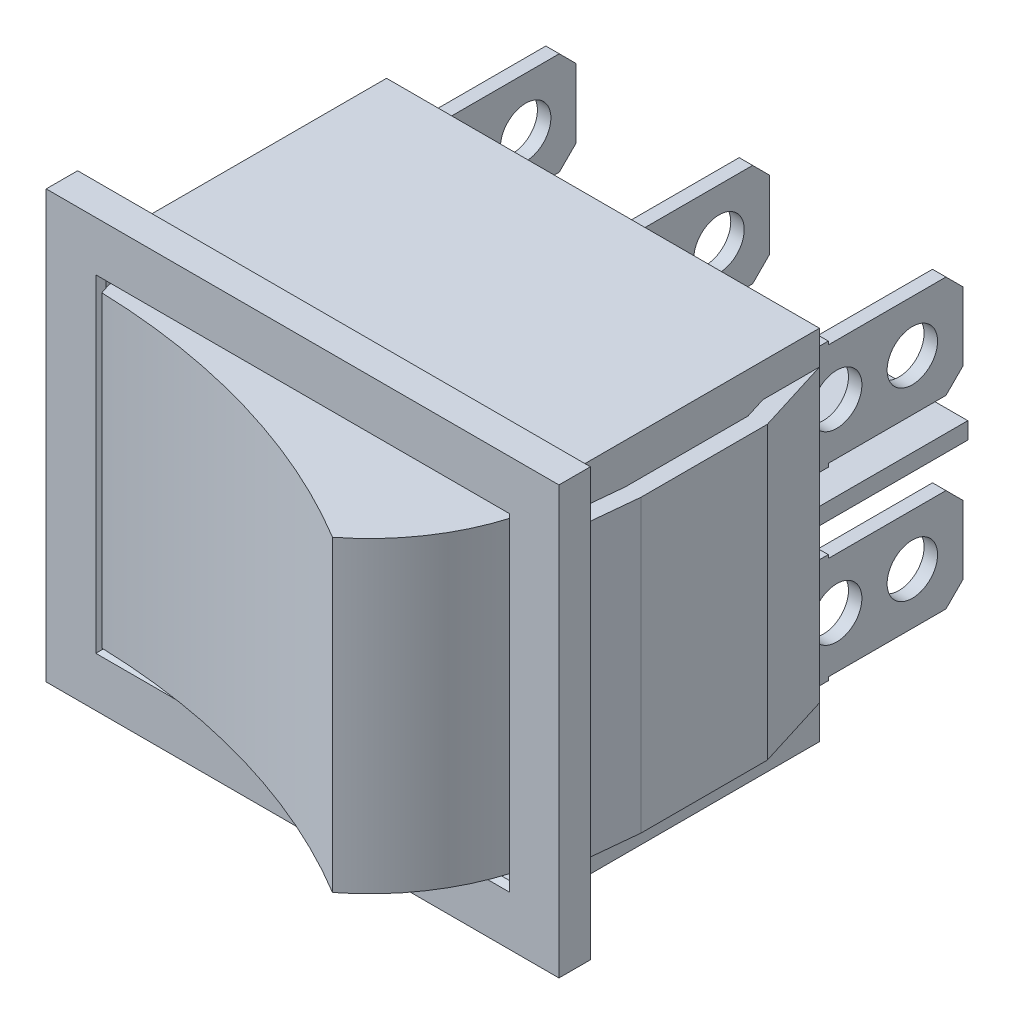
ISO-10303-21;
HEADER;
FILE_DESCRIPTION(('STEP AP214'),'2;1');
FILE_NAME('part.step','',(''),(''),'','','');
FILE_SCHEMA(('AUTOMOTIVE_DESIGN { 1 0 10303 214 1 1 1 1 }'));
ENDSEC;
DATA;
#1=APPLICATION_CONTEXT('core data for automotive mechanical design processes');
#2=APPLICATION_PROTOCOL_DEFINITION('international standard','automotive_design',2000,#1);
#3=PRODUCT_CONTEXT('',#1,'mechanical');
#4=PRODUCT('Part','Part','',(#3));
#5=PRODUCT_RELATED_PRODUCT_CATEGORY('part','',(#4));
#6=PRODUCT_DEFINITION_FORMATION('','',#4);
#7=PRODUCT_DEFINITION_CONTEXT('part definition',#1,'design');
#8=PRODUCT_DEFINITION('design','',#6,#7);
#9=PRODUCT_DEFINITION_SHAPE('','',#8);
#10=(LENGTH_UNIT() NAMED_UNIT(*) SI_UNIT(.MILLI.,.METRE.));
#11=(NAMED_UNIT(*) PLANE_ANGLE_UNIT() SI_UNIT($,.RADIAN.));
#12=(NAMED_UNIT(*) SI_UNIT($,.STERADIAN.) SOLID_ANGLE_UNIT());
#13=UNCERTAINTY_MEASURE_WITH_UNIT(LENGTH_MEASURE(1.E-05),#10,'distance_accuracy_value','');
#14=(GEOMETRIC_REPRESENTATION_CONTEXT(3) GLOBAL_UNCERTAINTY_ASSIGNED_CONTEXT((#13)) GLOBAL_UNIT_ASSIGNED_CONTEXT((#10,
#11,#12)) REPRESENTATION_CONTEXT('',''));
#15=CARTESIAN_POINT('',(0.,0.,0.));
#16=DIRECTION('',(0.,0.,1.));
#17=DIRECTION('',(1.,0.,0.));
#18=AXIS2_PLACEMENT_3D('',#15,#16,#17);
#19=CARTESIAN_POINT('',(0.,-9.15,13.87));
#20=DIRECTION('',(0.,1.,0.));
#21=DIRECTION('',(0.,0.,1.));
#22=AXIS2_PLACEMENT_3D('',#19,#20,#21);
#23=CYLINDRICAL_SURFACE('',#22,12.5);
#24=CARTESIAN_POINT('',(0.,9.15,13.87));
#25=DIRECTION('',(0.,-1.,0.));
#26=DIRECTION('',(0.,0.,-1.));
#27=AXIS2_PLACEMENT_3D('',#24,#25,#26);
#28=CIRCLE('',#27,12.5);
#29=CARTESIAN_POINT('',(12.,9.15,17.37));
#30=VERTEX_POINT('',#29);
#31=CARTESIAN_POINT('',(7.65961052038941,9.15,23.748277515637));
#32=VERTEX_POINT('',#31);
#33=EDGE_CURVE('E689',#30,#32,#28,.T.);
#34=ORIENTED_EDGE('',*,*,#33,.T.);
#35=DIRECTION('',(0.,-1.,0.));
#36=VECTOR('',#35,1.);
#37=CARTESIAN_POINT('',(7.65961052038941,0.,23.748277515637));
#38=LINE('',#37,#36);
#39=CARTESIAN_POINT('',(7.65961052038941,-9.15,23.748277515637));
#40=VERTEX_POINT('',#39);
#41=EDGE_CURVE('E669',#32,#40,#38,.T.);
#42=ORIENTED_EDGE('',*,*,#41,.T.);
#43=CARTESIAN_POINT('',(0.,-9.15,13.87));
#44=DIRECTION('',(0.,-1.,0.));
#45=DIRECTION('',(0.,0.,-1.));
#46=AXIS2_PLACEMENT_3D('',#43,#44,#45);
#47=CIRCLE('',#46,12.5);
#48=CARTESIAN_POINT('',(12.,-9.15,17.37));
#49=VERTEX_POINT('',#48);
#50=EDGE_CURVE('E695',#49,#40,#47,.T.);
#51=ORIENTED_EDGE('',*,*,#50,.F.);
#52=DIRECTION('',(0.,1.,0.));
#53=VECTOR('',#52,1.);
#54=CARTESIAN_POINT('',(12.,-9.15,17.37));
#55=LINE('',#54,#53);
#56=EDGE_CURVE('E675',#49,#30,#55,.T.);
#57=ORIENTED_EDGE('',*,*,#56,.T.);
#58=EDGE_LOOP('',(#34,#42,#51,#57));
#59=FACE_BOUND('',#58,.T.);
#60=ADVANCED_FACE('F44',(#59),#23,.T.);
#61=CARTESIAN_POINT('',(0.,0.,12.87));
#62=DIRECTION('',(0.,0.,1.));
#63=DIRECTION('',(1.,0.,0.));
#64=AXIS2_PLACEMENT_3D('',#61,#62,#63);
#65=PLANE('',#64);
#66=DIRECTION('',(0.,1.,0.));
#67=VECTOR('',#66,1.);
#68=CARTESIAN_POINT('',(-12.,0.,12.87));
#69=LINE('',#68,#67);
#70=CARTESIAN_POINT('',(-12.,9.15,12.87));
#71=VERTEX_POINT('',#70);
#72=CARTESIAN_POINT('',(-12.,9.45,12.87));
#73=VERTEX_POINT('',#72);
#74=EDGE_CURVE('E706',#71,#73,#69,.T.);
#75=ORIENTED_EDGE('',*,*,#74,.F.);
#76=DIRECTION('',(1.,0.,0.));
#77=VECTOR('',#76,1.);
#78=CARTESIAN_POINT('',(0.,9.15,12.87));
#79=LINE('',#78,#77);
#80=CARTESIAN_POINT('',(12.,9.15,12.87));
#81=VERTEX_POINT('',#80);
#82=EDGE_CURVE('E1457',#71,#81,#79,.T.);
#83=ORIENTED_EDGE('',*,*,#82,.T.);
#84=DIRECTION('',(0.,1.,0.));
#85=VECTOR('',#84,1.);
#86=CARTESIAN_POINT('',(12.,0.,12.87));
#87=LINE('',#86,#85);
#88=CARTESIAN_POINT('',(12.,9.45,12.87));
#89=VERTEX_POINT('',#88);
#90=EDGE_CURVE('E713',#81,#89,#87,.T.);
#91=ORIENTED_EDGE('',*,*,#90,.T.);
#92=DIRECTION('',(1.,0.,0.));
#93=VECTOR('',#92,1.);
#94=CARTESIAN_POINT('',(0.,9.45,12.87));
#95=LINE('',#94,#93);
#96=EDGE_CURVE('E717',#73,#89,#95,.T.);
#97=ORIENTED_EDGE('',*,*,#96,.F.);
#98=EDGE_LOOP('',(#75,#83,#91,#97));
#99=FACE_BOUND('',#98,.T.);
#100=ADVANCED_FACE('F1521',(#99),#65,.T.);
#101=CARTESIAN_POINT('',(0.,0.,17.87));
#102=DIRECTION('',(0.,0.,1.));
#103=DIRECTION('',(1.,0.,0.));
#104=AXIS2_PLACEMENT_3D('',#101,#102,#103);
#105=PLANE('',#104);
#106=DIRECTION('',(0.,-1.,0.));
#107=VECTOR('',#106,1.);
#108=CARTESIAN_POINT('',(12.3,-9.45,17.87));
#109=LINE('',#108,#107);
#110=CARTESIAN_POINT('',(12.3,9.75,17.87));
#111=VERTEX_POINT('',#110);
#112=CARTESIAN_POINT('',(12.3,-9.75,17.87));
#113=VERTEX_POINT('',#112);
#114=EDGE_CURVE('E1469',#111,#113,#109,.T.);
#115=ORIENTED_EDGE('',*,*,#114,.T.);
#116=DIRECTION('',(-1.,0.,0.));
#117=VECTOR('',#116,1.);
#118=CARTESIAN_POINT('',(-12.,-9.75,17.87));
#119=LINE('',#118,#117);
#120=CARTESIAN_POINT('',(-12.3,-9.75,17.87));
#121=VERTEX_POINT('',#120);
#122=EDGE_CURVE('E1471',#113,#121,#119,.T.);
#123=ORIENTED_EDGE('',*,*,#122,.T.);
#124=DIRECTION('',(0.,1.,0.));
#125=VECTOR('',#124,1.);
#126=CARTESIAN_POINT('',(-12.3,0.,17.87));
#127=LINE('',#126,#125);
#128=CARTESIAN_POINT('',(-12.3,9.75,17.87));
#129=VERTEX_POINT('',#128);
#130=EDGE_CURVE('E1465',#121,#129,#127,.T.);
#131=ORIENTED_EDGE('',*,*,#130,.T.);
#132=DIRECTION('',(1.,0.,0.));
#133=VECTOR('',#132,1.);
#134=CARTESIAN_POINT('',(0.,9.75,17.87));
#135=LINE('',#134,#133);
#136=EDGE_CURVE('E1467',#129,#111,#135,.T.);
#137=ORIENTED_EDGE('',*,*,#136,.T.);
#138=EDGE_LOOP('',(#115,#123,#131,#137));
#139=FACE_BOUND('',#138,.T.);
#140=DIRECTION('',(0.,1.,0.));
#141=VECTOR('',#140,1.);
#142=CARTESIAN_POINT('',(15.25,12.7,17.87));
#143=LINE('',#142,#141);
#144=CARTESIAN_POINT('',(15.25,-12.7,17.87));
#145=VERTEX_POINT('',#144);
#146=CARTESIAN_POINT('',(15.25,12.7,17.87));
#147=VERTEX_POINT('',#146);
#148=EDGE_CURVE('E1283',#145,#147,#143,.T.);
#149=ORIENTED_EDGE('',*,*,#148,.T.);
#150=DIRECTION('',(-1.,0.,0.));
#151=VECTOR('',#150,1.);
#152=CARTESIAN_POINT('',(-15.25,12.7,17.87));
#153=LINE('',#152,#151);
#154=CARTESIAN_POINT('',(-15.25,12.7,17.87));
#155=VERTEX_POINT('',#154);
#156=EDGE_CURVE('E1286',#147,#155,#153,.T.);
#157=ORIENTED_EDGE('',*,*,#156,.T.);
#158=DIRECTION('',(0.,-1.,0.));
#159=VECTOR('',#158,1.);
#160=CARTESIAN_POINT('',(-15.25,12.7,17.87));
#161=LINE('',#160,#159);
#162=CARTESIAN_POINT('',(-15.25,-12.7,17.87));
#163=VERTEX_POINT('',#162);
#164=EDGE_CURVE('E1289',#155,#163,#161,.T.);
#165=ORIENTED_EDGE('',*,*,#164,.T.);
#166=DIRECTION('',(1.,0.,0.));
#167=VECTOR('',#166,1.);
#168=CARTESIAN_POINT('',(-15.25,-12.7,17.87));
#169=LINE('',#168,#167);
#170=EDGE_CURVE('E1291',#163,#145,#169,.T.);
#171=ORIENTED_EDGE('',*,*,#170,.T.);
#172=EDGE_LOOP('',(#149,#157,#165,#171));
#173=FACE_BOUND('',#172,.T.);
#174=ADVANCED_FACE('F1494',(#139,#173),#105,.T.);
#175=CARTESIAN_POINT('',(0.,0.,16.));
#176=DIRECTION('',(0.,0.,1.));
#177=DIRECTION('',(1.,0.,0.));
#178=AXIS2_PLACEMENT_3D('',#175,#176,#177);
#179=PLANE('',#178);
#180=DIRECTION('',(0.,1.,0.));
#181=VECTOR('',#180,1.);
#182=CARTESIAN_POINT('',(15.25,12.7,16.));
#183=LINE('',#182,#181);
#184=CARTESIAN_POINT('',(15.25,-12.7,16.));
#185=VERTEX_POINT('',#184);
#186=CARTESIAN_POINT('',(15.25,12.7,16.));
#187=VERTEX_POINT('',#186);
#188=EDGE_CURVE('E1282',#185,#187,#183,.T.);
#189=ORIENTED_EDGE('',*,*,#188,.F.);
#190=DIRECTION('',(1.,0.,0.));
#191=VECTOR('',#190,1.);
#192=CARTESIAN_POINT('',(-15.25,-12.7,16.));
#193=LINE('',#192,#191);
#194=CARTESIAN_POINT('',(-15.25,-12.7,16.));
#195=VERTEX_POINT('',#194);
#196=EDGE_CURVE('E1287',#195,#185,#193,.T.);
#197=ORIENTED_EDGE('',*,*,#196,.F.);
#198=DIRECTION('',(0.,-1.,0.));
#199=VECTOR('',#198,1.);
#200=CARTESIAN_POINT('',(-15.25,12.7,16.));
#201=LINE('',#200,#199);
#202=CARTESIAN_POINT('',(-15.25,12.7,16.));
#203=VERTEX_POINT('',#202);
#204=EDGE_CURVE('E1298',#203,#195,#201,.T.);
#205=ORIENTED_EDGE('',*,*,#204,.F.);
#206=DIRECTION('',(-1.,0.,0.));
#207=VECTOR('',#206,1.);
#208=CARTESIAN_POINT('',(-15.25,12.7,16.));
#209=LINE('',#208,#207);
#210=EDGE_CURVE('E1296',#187,#203,#209,.T.);
#211=ORIENTED_EDGE('',*,*,#210,.F.);
#212=EDGE_LOOP('',(#189,#197,#205,#211));
#213=FACE_BOUND('',#212,.T.);
#214=DIRECTION('',(-1.,0.,0.));
#215=VECTOR('',#214,1.);
#216=CARTESIAN_POINT('',(13.8798672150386,8.65,16.));
#217=LINE('',#216,#215);
#218=CARTESIAN_POINT('',(13.8798672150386,8.65,16.));
#219=VERTEX_POINT('',#218);
#220=CARTESIAN_POINT('',(12.875,8.65,16.));
#221=VERTEX_POINT('',#220);
#222=EDGE_CURVE('E761',#219,#221,#217,.T.);
#223=ORIENTED_EDGE('',*,*,#222,.T.);
#224=DIRECTION('',(0.,1.,0.));
#225=VECTOR('',#224,1.);
#226=CARTESIAN_POINT('',(12.875,10.65,16.));
#227=LINE('',#226,#225);
#228=CARTESIAN_POINT('',(12.875,10.65,16.));
#229=VERTEX_POINT('',#228);
#230=EDGE_CURVE('E1317',#221,#229,#227,.T.);
#231=ORIENTED_EDGE('',*,*,#230,.T.);
#232=DIRECTION('',(-1.,0.,0.));
#233=VECTOR('',#232,1.);
#234=CARTESIAN_POINT('',(-12.875,10.65,16.));
#235=LINE('',#234,#233);
#236=CARTESIAN_POINT('',(-12.875,10.65,16.));
#237=VERTEX_POINT('',#236);
#238=EDGE_CURVE('E1316',#229,#237,#235,.T.);
#239=ORIENTED_EDGE('',*,*,#238,.T.);
#240=DIRECTION('',(0.,-1.,0.));
#241=VECTOR('',#240,1.);
#242=CARTESIAN_POINT('',(-12.875,10.65,16.));
#243=LINE('',#242,#241);
#244=CARTESIAN_POINT('',(-12.875,8.65,16.));
#245=VERTEX_POINT('',#244);
#246=EDGE_CURVE('E1321',#237,#245,#243,.T.);
#247=ORIENTED_EDGE('',*,*,#246,.T.);
#248=DIRECTION('',(1.,0.,0.));
#249=VECTOR('',#248,1.);
#250=CARTESIAN_POINT('',(-13.8798672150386,8.65,16.));
#251=LINE('',#250,#249);
#252=CARTESIAN_POINT('',(-13.8798672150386,8.65,16.));
#253=VERTEX_POINT('',#252);
#254=EDGE_CURVE('E823',#253,#245,#251,.T.);
#255=ORIENTED_EDGE('',*,*,#254,.F.);
#256=DIRECTION('',(0.,1.,0.));
#257=VECTOR('',#256,1.);
#258=CARTESIAN_POINT('',(-13.8798672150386,-26.7111332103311,16.));
#259=LINE('',#258,#257);
#260=CARTESIAN_POINT('',(-13.8798672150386,-8.65,16.));
#261=VERTEX_POINT('',#260);
#262=EDGE_CURVE('E844',#261,#253,#259,.T.);
#263=ORIENTED_EDGE('',*,*,#262,.F.);
#264=DIRECTION('',(-1.,0.,0.));
#265=VECTOR('',#264,1.);
#266=CARTESIAN_POINT('',(-13.8798672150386,-8.65,16.));
#267=LINE('',#266,#265);
#268=CARTESIAN_POINT('',(-12.875,-8.65,16.));
#269=VERTEX_POINT('',#268);
#270=EDGE_CURVE('E798',#269,#261,#267,.T.);
#271=ORIENTED_EDGE('',*,*,#270,.F.);
#272=CARTESIAN_POINT('',(-12.875,-10.65,16.));
#273=VERTEX_POINT('',#272);
#274=EDGE_CURVE('E1320',#269,#273,#243,.T.);
#275=ORIENTED_EDGE('',*,*,#274,.T.);
#276=DIRECTION('',(1.,0.,0.));
#277=VECTOR('',#276,1.);
#278=CARTESIAN_POINT('',(-12.875,-10.65,16.));
#279=LINE('',#278,#277);
#280=CARTESIAN_POINT('',(12.875,-10.65,16.));
#281=VERTEX_POINT('',#280);
#282=EDGE_CURVE('E1324',#273,#281,#279,.T.);
#283=ORIENTED_EDGE('',*,*,#282,.T.);
#284=CARTESIAN_POINT('',(12.875,-8.65,16.));
#285=VERTEX_POINT('',#284);
#286=EDGE_CURVE('E1313',#281,#285,#227,.T.);
#287=ORIENTED_EDGE('',*,*,#286,.T.);
#288=DIRECTION('',(1.,0.,0.));
#289=VECTOR('',#288,1.);
#290=CARTESIAN_POINT('',(13.8798672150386,-8.65,16.));
#291=LINE('',#290,#289);
#292=CARTESIAN_POINT('',(13.8798672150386,-8.65,16.));
#293=VERTEX_POINT('',#292);
#294=EDGE_CURVE('E737',#285,#293,#291,.T.);
#295=ORIENTED_EDGE('',*,*,#294,.T.);
#296=DIRECTION('',(0.,1.,0.));
#297=VECTOR('',#296,1.);
#298=CARTESIAN_POINT('',(13.8798672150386,-26.7111332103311,16.));
#299=LINE('',#298,#297);
#300=EDGE_CURVE('E781',#293,#219,#299,.T.);
#301=ORIENTED_EDGE('',*,*,#300,.T.);
#302=EDGE_LOOP('',(#223,#231,#239,#247,#255,#263,#271,#275,#283,#287,#295,#301));
#303=FACE_BOUND('',#302,.T.);
#304=ADVANCED_FACE('F1834',(#213,#303),#179,.F.);
#305=CARTESIAN_POINT('',(12.875,10.65,16.));
#306=DIRECTION('',(-1.,0.,0.));
#307=DIRECTION('',(0.,-1.,0.));
#308=AXIS2_PLACEMENT_3D('',#305,#306,#307);
#309=PLANE('',#308);
#310=DIRECTION('',(0.,0.,-1.));
#311=VECTOR('',#310,1.);
#312=CARTESIAN_POINT('',(12.875,8.65,3.36624904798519));
#313=LINE('',#312,#311);
#314=CARTESIAN_POINT('',(12.875,8.65,3.36624904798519));
#315=VERTEX_POINT('',#314);
#316=CARTESIAN_POINT('',(12.875,8.65,0.));
#317=VERTEX_POINT('',#316);
#318=EDGE_CURVE('E723',#315,#317,#313,.T.);
#319=ORIENTED_EDGE('',*,*,#318,.T.);
#320=DIRECTION('',(0.,1.,0.));
#321=VECTOR('',#320,1.);
#322=CARTESIAN_POINT('',(12.875,10.65,0.));
#323=LINE('',#322,#321);
#324=CARTESIAN_POINT('',(12.875,10.65,0.));
#325=VERTEX_POINT('',#324);
#326=EDGE_CURVE('E1312',#317,#325,#323,.T.);
#327=ORIENTED_EDGE('',*,*,#326,.T.);
#328=DIRECTION('',(0.,0.,-1.));
#329=VECTOR('',#328,1.);
#330=CARTESIAN_POINT('',(12.875,10.65,16.));
#331=LINE('',#330,#329);
#332=EDGE_CURVE('E1346',#229,#325,#331,.T.);
#333=ORIENTED_EDGE('',*,*,#332,.F.);
#334=ORIENTED_EDGE('',*,*,#230,.F.);
#335=DIRECTION('',(0.,1.,0.));
#336=VECTOR('',#335,1.);
#337=CARTESIAN_POINT('',(12.875,-26.7111332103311,16.));
#338=LINE('',#337,#336);
#339=EDGE_CURVE('E783',#285,#221,#338,.T.);
#340=ORIENTED_EDGE('',*,*,#339,.F.);
#341=ORIENTED_EDGE('',*,*,#286,.F.);
#342=DIRECTION('',(0.,0.,-1.));
#343=VECTOR('',#342,1.);
#344=CARTESIAN_POINT('',(12.875,-10.65,16.));
#345=LINE('',#344,#343);
#346=CARTESIAN_POINT('',(12.875,-10.65,0.));
#347=VERTEX_POINT('',#346);
#348=EDGE_CURVE('E1327',#281,#347,#345,.T.);
#349=ORIENTED_EDGE('',*,*,#348,.T.);
#350=CARTESIAN_POINT('',(12.875,-8.65,0.));
#351=VERTEX_POINT('',#350);
#352=EDGE_CURVE('E1328',#347,#351,#323,.T.);
#353=ORIENTED_EDGE('',*,*,#352,.T.);
#354=DIRECTION('',(0.,0.,1.));
#355=VECTOR('',#354,1.);
#356=CARTESIAN_POINT('',(12.875,-8.65,3.36624904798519));
#357=LINE('',#356,#355);
#358=CARTESIAN_POINT('',(12.875,-8.65,3.3662490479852));
#359=VERTEX_POINT('',#358);
#360=EDGE_CURVE('E748',#351,#359,#357,.T.);
#361=ORIENTED_EDGE('',*,*,#360,.T.);
#362=DIRECTION('',(0.,1.,0.));
#363=VECTOR('',#362,1.);
#364=CARTESIAN_POINT('',(12.875,-26.7111332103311,3.36624904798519));
#365=LINE('',#364,#363);
#366=EDGE_CURVE('E773',#359,#315,#365,.T.);
#367=ORIENTED_EDGE('',*,*,#366,.T.);
#368=EDGE_LOOP('',(#319,#327,#333,#334,#340,#341,#349,#353,#361,#367));
#369=FACE_BOUND('',#368,.T.);
#370=ADVANCED_FACE('F1837',(#369),#309,.F.);
#371=CARTESIAN_POINT('',(-12.875,10.65,16.));
#372=DIRECTION('',(1.,0.,0.));
#373=DIRECTION('',(0.,1.,0.));
#374=AXIS2_PLACEMENT_3D('',#371,#372,#373);
#375=PLANE('',#374);
#376=DIRECTION('',(0.,0.,-1.));
#377=VECTOR('',#376,1.);
#378=CARTESIAN_POINT('',(-12.875,8.65,3.36624904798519));
#379=LINE('',#378,#377);
#380=CARTESIAN_POINT('',(-12.875,8.65,3.36624904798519));
#381=VERTEX_POINT('',#380);
#382=CARTESIAN_POINT('',(-12.875,8.65,0.));
#383=VERTEX_POINT('',#382);
#384=EDGE_CURVE('E750',#381,#383,#379,.T.);
#385=ORIENTED_EDGE('',*,*,#384,.F.);
#386=DIRECTION('',(0.,1.,0.));
#387=VECTOR('',#386,1.);
#388=CARTESIAN_POINT('',(-12.875,-26.7111332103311,3.36624904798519));
#389=LINE('',#388,#387);
#390=CARTESIAN_POINT('',(-12.875,-8.65,3.36624904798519));
#391=VERTEX_POINT('',#390);
#392=EDGE_CURVE('E796',#391,#381,#389,.T.);
#393=ORIENTED_EDGE('',*,*,#392,.F.);
#394=DIRECTION('',(0.,0.,1.));
#395=VECTOR('',#394,1.);
#396=CARTESIAN_POINT('',(-12.875,-8.65,3.36624904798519));
#397=LINE('',#396,#395);
#398=CARTESIAN_POINT('',(-12.875,-8.65,0.));
#399=VERTEX_POINT('',#398);
#400=EDGE_CURVE('E808',#399,#391,#397,.T.);
#401=ORIENTED_EDGE('',*,*,#400,.F.);
#402=DIRECTION('',(0.,-1.,0.));
#403=VECTOR('',#402,1.);
#404=CARTESIAN_POINT('',(-12.875,10.65,0.));
#405=LINE('',#404,#403);
#406=CARTESIAN_POINT('',(-12.875,-10.65,0.));
#407=VERTEX_POINT('',#406);
#408=EDGE_CURVE('E1332',#399,#407,#405,.T.);
#409=ORIENTED_EDGE('',*,*,#408,.T.);
#410=DIRECTION('',(0.,0.,-1.));
#411=VECTOR('',#410,1.);
#412=CARTESIAN_POINT('',(-12.875,-10.65,16.));
#413=LINE('',#412,#411);
#414=EDGE_CURVE('E1340',#273,#407,#413,.T.);
#415=ORIENTED_EDGE('',*,*,#414,.F.);
#416=ORIENTED_EDGE('',*,*,#274,.F.);
#417=DIRECTION('',(0.,1.,0.));
#418=VECTOR('',#417,1.);
#419=CARTESIAN_POINT('',(-12.875,-26.7111332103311,16.));
#420=LINE('',#419,#418);
#421=EDGE_CURVE('E842',#269,#245,#420,.T.);
#422=ORIENTED_EDGE('',*,*,#421,.T.);
#423=ORIENTED_EDGE('',*,*,#246,.F.);
#424=DIRECTION('',(0.,0.,-1.));
#425=VECTOR('',#424,1.);
#426=CARTESIAN_POINT('',(-12.875,10.65,16.));
#427=LINE('',#426,#425);
#428=CARTESIAN_POINT('',(-12.875,10.65,0.));
#429=VERTEX_POINT('',#428);
#430=EDGE_CURVE('E1343',#237,#429,#427,.T.);
#431=ORIENTED_EDGE('',*,*,#430,.T.);
#432=EDGE_CURVE('E1333',#429,#383,#405,.T.);
#433=ORIENTED_EDGE('',*,*,#432,.T.);
#434=EDGE_LOOP('',(#385,#393,#401,#409,#415,#416,#422,#423,#431,#433));
#435=FACE_BOUND('',#434,.T.);
#436=ADVANCED_FACE('F1713',(#435),#375,.F.);
#437=CARTESIAN_POINT('',(-11.9,2.25000000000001,-9.5));
#438=DIRECTION('',(-1.,0.,0.));
#439=DIRECTION('',(0.,0.,1.));
#440=AXIS2_PLACEMENT_3D('',#437,#438,#439);
#441=PLANE('',#440);
#442=CARTESIAN_POINT('',(-11.9,5.5,-6.5));
#443=DIRECTION('',(-1.,0.,0.));
#444=DIRECTION('',(0.,0.,1.));
#445=AXIS2_PLACEMENT_3D('',#442,#443,#444);
#446=CIRCLE('',#445,1.5);
#447=CARTESIAN_POINT('',(-11.9,5.5,-5.));
#448=VERTEX_POINT('',#447);
#449=EDGE_CURVE('E887',#448,#448,#446,.F.);
#450=ORIENTED_EDGE('',*,*,#449,.T.);
#451=EDGE_LOOP('',(#450));
#452=FACE_BOUND('',#451,.T.);
#453=CARTESIAN_POINT('',(-11.9,5.5,-2.));
#454=DIRECTION('',(-1.,0.,0.));
#455=DIRECTION('',(0.,0.,1.));
#456=AXIS2_PLACEMENT_3D('',#453,#454,#455);
#457=CIRCLE('',#456,1.5);
#458=CARTESIAN_POINT('',(-11.9,5.5,-0.499999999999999));
#459=VERTEX_POINT('',#458);
#460=EDGE_CURVE('E872',#459,#459,#457,.F.);
#461=ORIENTED_EDGE('',*,*,#460,.T.);
#462=EDGE_LOOP('',(#461));
#463=FACE_BOUND('',#462,.T.);
#464=DIRECTION('',(0.,0.,-1.));
#465=VECTOR('',#464,1.);
#466=CARTESIAN_POINT('',(-11.9,8.55,-9.5));
#467=LINE('',#466,#465);
#468=CARTESIAN_POINT('',(-11.9,8.55,-1.5));
#469=VERTEX_POINT('',#468);
#470=CARTESIAN_POINT('',(-11.9,8.55,-8.49999999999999));
#471=VERTEX_POINT('',#470);
#472=EDGE_CURVE('E929',#469,#471,#467,.T.);
#473=ORIENTED_EDGE('',*,*,#472,.T.);
#474=DIRECTION('',(0.,0.707106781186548,0.707106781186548));
#475=VECTOR('',#474,1.);
#476=CARTESIAN_POINT('',(-11.9,4.9,-12.15));
#477=LINE('',#476,#475);
#478=CARTESIAN_POINT('',(-11.9,7.54999999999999,-9.5));
#479=VERTEX_POINT('',#478);
#480=EDGE_CURVE('E1416',#471,#479,#477,.F.);
#481=ORIENTED_EDGE('',*,*,#480,.T.);
#482=DIRECTION('',(0.,-1.,0.));
#483=VECTOR('',#482,1.);
#484=CARTESIAN_POINT('',(-11.9,2.25000000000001,-9.5));
#485=LINE('',#484,#483);
#486=CARTESIAN_POINT('',(-11.9,3.45000000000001,-9.5));
#487=VERTEX_POINT('',#486);
#488=EDGE_CURVE('E1027',#479,#487,#485,.T.);
#489=ORIENTED_EDGE('',*,*,#488,.T.);
#490=DIRECTION('',(0.,0.707106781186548,-0.707106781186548));
#491=VECTOR('',#490,1.);
#492=CARTESIAN_POINT('',(-11.9,2.85000000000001,-8.9));
#493=LINE('',#492,#491);
#494=CARTESIAN_POINT('',(-11.9,2.45,-8.49999999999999));
#495=VERTEX_POINT('',#494);
#496=EDGE_CURVE('E1414',#487,#495,#493,.F.);
#497=ORIENTED_EDGE('',*,*,#496,.T.);
#498=DIRECTION('',(0.,0.,1.));
#499=VECTOR('',#498,1.);
#500=CARTESIAN_POINT('',(-11.9,2.45,-9.5));
#501=LINE('',#500,#499);
#502=CARTESIAN_POINT('',(-11.9,2.45,-1.5));
#503=VERTEX_POINT('',#502);
#504=EDGE_CURVE('E942',#495,#503,#501,.T.);
#505=ORIENTED_EDGE('',*,*,#504,.T.);
#506=DIRECTION('',(0.,-1.,0.));
#507=VECTOR('',#506,1.);
#508=CARTESIAN_POINT('',(-11.9,2.25000000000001,-1.5));
#509=LINE('',#508,#507);
#510=CARTESIAN_POINT('',(-11.9,2.25,-1.5));
#511=VERTEX_POINT('',#510);
#512=EDGE_CURVE('E956',#503,#511,#509,.T.);
#513=ORIENTED_EDGE('',*,*,#512,.T.);
#514=DIRECTION('',(0.,0.,1.));
#515=VECTOR('',#514,1.);
#516=CARTESIAN_POINT('',(-11.9,2.25000000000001,-9.5));
#517=LINE('',#516,#515);
#518=CARTESIAN_POINT('',(-11.9,2.25000000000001,0.));
#519=VERTEX_POINT('',#518);
#520=EDGE_CURVE('E1034',#511,#519,#517,.T.);
#521=ORIENTED_EDGE('',*,*,#520,.T.);
#522=DIRECTION('',(0.,-1.,0.));
#523=VECTOR('',#522,1.);
#524=CARTESIAN_POINT('',(-11.9,2.25000000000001,0.));
#525=LINE('',#524,#523);
#526=CARTESIAN_POINT('',(-11.9,8.75,0.));
#527=VERTEX_POINT('',#526);
#528=EDGE_CURVE('E1026',#527,#519,#525,.T.);
#529=ORIENTED_EDGE('',*,*,#528,.F.);
#530=DIRECTION('',(0.,0.,1.));
#531=VECTOR('',#530,1.);
#532=CARTESIAN_POINT('',(-11.9,8.75,-9.5));
#533=LINE('',#532,#531);
#534=CARTESIAN_POINT('',(-11.9,8.75,-1.5));
#535=VERTEX_POINT('',#534);
#536=EDGE_CURVE('E1050',#535,#527,#533,.T.);
#537=ORIENTED_EDGE('',*,*,#536,.F.);
#538=DIRECTION('',(0.,-1.,0.));
#539=VECTOR('',#538,1.);
#540=CARTESIAN_POINT('',(-11.9,2.25000000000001,-1.5));
#541=LINE('',#540,#539);
#542=EDGE_CURVE('E971',#535,#469,#541,.T.);
#543=ORIENTED_EDGE('',*,*,#542,.T.);
#544=EDGE_LOOP('',(#473,#481,#489,#497,#505,#513,#521,#529,#537,#543));
#545=FACE_BOUND('',#544,.T.);
#546=ADVANCED_FACE('F1709',(#452,#463,#545),#441,.T.);
#547=CARTESIAN_POINT('',(-11.1,8.75,-9.5));
#548=DIRECTION('',(0.,1.,0.));
#549=DIRECTION('',(0.,0.,1.));
#550=AXIS2_PLACEMENT_3D('',#547,#548,#549);
#551=PLANE('',#550);
#552=DIRECTION('',(0.,0.,1.));
#553=VECTOR('',#552,1.);
#554=CARTESIAN_POINT('',(-11.1,8.75,-9.5));
#555=LINE('',#554,#553);
#556=CARTESIAN_POINT('',(-11.1,8.75,-1.5));
#557=VERTEX_POINT('',#556);
#558=CARTESIAN_POINT('',(-11.1,8.75,0.));
#559=VERTEX_POINT('',#558);
#560=EDGE_CURVE('E1048',#557,#559,#555,.T.);
#561=ORIENTED_EDGE('',*,*,#560,.F.);
#562=DIRECTION('',(1.,0.,0.));
#563=VECTOR('',#562,1.);
#564=CARTESIAN_POINT('',(-15.25,8.75,-1.5));
#565=LINE('',#564,#563);
#566=EDGE_CURVE('E916',#535,#557,#565,.T.);
#567=ORIENTED_EDGE('',*,*,#566,.F.);
#568=ORIENTED_EDGE('',*,*,#536,.T.);
#569=DIRECTION('',(-1.,0.,0.));
#570=VECTOR('',#569,1.);
#571=CARTESIAN_POINT('',(-11.1,8.75,0.));
#572=LINE('',#571,#570);
#573=EDGE_CURVE('E1037',#559,#527,#572,.T.);
#574=ORIENTED_EDGE('',*,*,#573,.F.);
#575=EDGE_LOOP('',(#561,#567,#568,#574));
#576=FACE_BOUND('',#575,.T.);
#577=ADVANCED_FACE('F1705',(#576),#551,.T.);
#578=CARTESIAN_POINT('',(-11.1,2.25000000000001,-9.5));
#579=DIRECTION('',(1.,0.,0.));
#580=DIRECTION('',(0.,1.,0.));
#581=AXIS2_PLACEMENT_3D('',#578,#579,#580);
#582=PLANE('',#581);
#583=CARTESIAN_POINT('',(-11.1,5.5,-6.5));
#584=DIRECTION('',(1.,0.,0.));
#585=DIRECTION('',(0.,1.,0.));
#586=AXIS2_PLACEMENT_3D('',#583,#584,#585);
#587=CIRCLE('',#586,1.5);
#588=CARTESIAN_POINT('',(-11.1,7.,-6.5));
#589=VERTEX_POINT('',#588);
#590=EDGE_CURVE('E884',#589,#589,#587,.F.);
#591=ORIENTED_EDGE('',*,*,#590,.T.);
#592=EDGE_LOOP('',(#591));
#593=FACE_BOUND('',#592,.T.);
#594=CARTESIAN_POINT('',(-11.1,5.5,-2.));
#595=DIRECTION('',(1.,0.,0.));
#596=DIRECTION('',(0.,1.,0.));
#597=AXIS2_PLACEMENT_3D('',#594,#595,#596);
#598=CIRCLE('',#597,1.5);
#599=CARTESIAN_POINT('',(-11.1,7.,-2.));
#600=VERTEX_POINT('',#599);
#601=EDGE_CURVE('E869',#600,#600,#598,.F.);
#602=ORIENTED_EDGE('',*,*,#601,.T.);
#603=EDGE_LOOP('',(#602));
#604=FACE_BOUND('',#603,.T.);
#605=DIRECTION('',(0.,1.,0.));
#606=VECTOR('',#605,1.);
#607=CARTESIAN_POINT('',(-11.1,2.25000000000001,-9.5));
#608=LINE('',#607,#606);
#609=CARTESIAN_POINT('',(-11.1,3.45000000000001,-9.5));
#610=VERTEX_POINT('',#609);
#611=CARTESIAN_POINT('',(-11.1,7.54999999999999,-9.5));
#612=VERTEX_POINT('',#611);
#613=EDGE_CURVE('E1030',#610,#612,#608,.T.);
#614=ORIENTED_EDGE('',*,*,#613,.T.);
#615=DIRECTION('',(0.,-0.707106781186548,-0.707106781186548));
#616=VECTOR('',#615,1.);
#617=CARTESIAN_POINT('',(-11.1,4.9,-12.15));
#618=LINE('',#617,#616);
#619=CARTESIAN_POINT('',(-11.1,8.55,-8.49999999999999));
#620=VERTEX_POINT('',#619);
#621=EDGE_CURVE('E1410',#612,#620,#618,.F.);
#622=ORIENTED_EDGE('',*,*,#621,.T.);
#623=DIRECTION('',(0.,0.,1.));
#624=VECTOR('',#623,1.);
#625=CARTESIAN_POINT('',(-11.1,8.55,-9.5));
#626=LINE('',#625,#624);
#627=CARTESIAN_POINT('',(-11.1,8.55,-1.5));
#628=VERTEX_POINT('',#627);
#629=EDGE_CURVE('E927',#620,#628,#626,.T.);
#630=ORIENTED_EDGE('',*,*,#629,.T.);
#631=DIRECTION('',(0.,1.,0.));
#632=VECTOR('',#631,1.);
#633=CARTESIAN_POINT('',(-11.1,2.25000000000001,-1.5));
#634=LINE('',#633,#632);
#635=EDGE_CURVE('E968',#628,#557,#634,.T.);
#636=ORIENTED_EDGE('',*,*,#635,.T.);
#637=ORIENTED_EDGE('',*,*,#560,.T.);
#638=DIRECTION('',(0.,1.,0.));
#639=VECTOR('',#638,1.);
#640=CARTESIAN_POINT('',(-11.1,2.25000000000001,0.));
#641=LINE('',#640,#639);
#642=CARTESIAN_POINT('',(-11.1,2.25000000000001,0.));
#643=VERTEX_POINT('',#642);
#644=EDGE_CURVE('E1040',#643,#559,#641,.T.);
#645=ORIENTED_EDGE('',*,*,#644,.F.);
#646=DIRECTION('',(0.,0.,1.));
#647=VECTOR('',#646,1.);
#648=CARTESIAN_POINT('',(-11.1,2.25000000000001,-9.5));
#649=LINE('',#648,#647);
#650=CARTESIAN_POINT('',(-11.1,2.25,-1.5));
#651=VERTEX_POINT('',#650);
#652=EDGE_CURVE('E1046',#651,#643,#649,.T.);
#653=ORIENTED_EDGE('',*,*,#652,.F.);
#654=DIRECTION('',(0.,1.,0.));
#655=VECTOR('',#654,1.);
#656=CARTESIAN_POINT('',(-11.1,2.25000000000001,-1.5));
#657=LINE('',#656,#655);
#658=CARTESIAN_POINT('',(-11.1,2.45,-1.5));
#659=VERTEX_POINT('',#658);
#660=EDGE_CURVE('E953',#651,#659,#657,.T.);
#661=ORIENTED_EDGE('',*,*,#660,.T.);
#662=DIRECTION('',(0.,0.,-1.));
#663=VECTOR('',#662,1.);
#664=CARTESIAN_POINT('',(-11.1,2.45,-9.5));
#665=LINE('',#664,#663);
#666=CARTESIAN_POINT('',(-11.1,2.45,-8.49999999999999));
#667=VERTEX_POINT('',#666);
#668=EDGE_CURVE('E939',#659,#667,#665,.T.);
#669=ORIENTED_EDGE('',*,*,#668,.T.);
#670=DIRECTION('',(0.,-0.707106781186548,0.707106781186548));
#671=VECTOR('',#670,1.);
#672=CARTESIAN_POINT('',(-11.1,2.85000000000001,-8.9));
#673=LINE('',#672,#671);
#674=EDGE_CURVE('E1408',#667,#610,#673,.F.);
#675=ORIENTED_EDGE('',*,*,#674,.T.);
#676=EDGE_LOOP('',(#614,#622,#630,#636,#637,#645,#653,#661,#669,#675));
#677=FACE_BOUND('',#676,.T.);
#678=ADVANCED_FACE('F1701',(#593,#604,#677),#582,.T.);
#679=CARTESIAN_POINT('',(-11.1,2.25000000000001,-9.5));
#680=DIRECTION('',(0.,-1.,0.));
#681=DIRECTION('',(0.,0.,-1.));
#682=AXIS2_PLACEMENT_3D('',#679,#680,#681);
#683=PLANE('',#682);
#684=ORIENTED_EDGE('',*,*,#520,.F.);
#685=DIRECTION('',(1.,0.,0.));
#686=VECTOR('',#685,1.);
#687=CARTESIAN_POINT('',(-15.25,2.25,-1.5));
#688=LINE('',#687,#686);
#689=EDGE_CURVE('E904',#511,#651,#688,.T.);
#690=ORIENTED_EDGE('',*,*,#689,.T.);
#691=ORIENTED_EDGE('',*,*,#652,.T.);
#692=DIRECTION('',(1.,0.,0.));
#693=VECTOR('',#692,1.);
#694=CARTESIAN_POINT('',(-11.1,2.25000000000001,0.));
#695=LINE('',#694,#693);
#696=EDGE_CURVE('E1031',#519,#643,#695,.T.);
#697=ORIENTED_EDGE('',*,*,#696,.F.);
#698=EDGE_LOOP('',(#684,#690,#691,#697));
#699=FACE_BOUND('',#698,.T.);
#700=ADVANCED_FACE('F1697',(#699),#683,.T.);
#701=CARTESIAN_POINT('',(0.,0.,-9.5));
#702=DIRECTION('',(0.,0.,-1.));
#703=DIRECTION('',(-1.,0.,0.));
#704=AXIS2_PLACEMENT_3D('',#701,#702,#703);
#705=PLANE('',#704);
#706=ORIENTED_EDGE('',*,*,#488,.F.);
#707=DIRECTION('',(1.,0.,0.));
#708=VECTOR('',#707,1.);
#709=CARTESIAN_POINT('',(0.,7.54999999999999,-9.5));
#710=LINE('',#709,#708);
#711=EDGE_CURVE('E1405',#479,#612,#710,.T.);
#712=ORIENTED_EDGE('',*,*,#711,.T.);
#713=ORIENTED_EDGE('',*,*,#613,.F.);
#714=DIRECTION('',(-1.,0.,0.));
#715=VECTOR('',#714,1.);
#716=CARTESIAN_POINT('',(0.,3.45000000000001,-9.5));
#717=LINE('',#716,#715);
#718=EDGE_CURVE('E1403',#610,#487,#717,.T.);
#719=ORIENTED_EDGE('',*,*,#718,.T.);
#720=EDGE_LOOP('',(#706,#712,#713,#719));
#721=FACE_BOUND('',#720,.T.);
#722=ADVANCED_FACE('F1693',(#721),#705,.T.);
#723=CARTESIAN_POINT('',(-0.4,8.75,-9.5));
#724=DIRECTION('',(-1.,0.,0.));
#725=DIRECTION('',(0.,0.,1.));
#726=AXIS2_PLACEMENT_3D('',#723,#724,#725);
#727=PLANE('',#726);
#728=CARTESIAN_POINT('',(-0.399999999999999,5.5,-6.5));
#729=DIRECTION('',(-1.,0.,0.));
#730=DIRECTION('',(0.,0.,1.));
#731=AXIS2_PLACEMENT_3D('',#728,#729,#730);
#732=CIRCLE('',#731,1.5);
#733=CARTESIAN_POINT('',(-0.399999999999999,5.5,-5.));
#734=VERTEX_POINT('',#733);
#735=EDGE_CURVE('E881',#734,#734,#732,.F.);
#736=ORIENTED_EDGE('',*,*,#735,.T.);
#737=EDGE_LOOP('',(#736));
#738=FACE_BOUND('',#737,.T.);
#739=CARTESIAN_POINT('',(-0.399999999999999,5.5,-2.));
#740=DIRECTION('',(-1.,0.,0.));
#741=DIRECTION('',(0.,0.,1.));
#742=AXIS2_PLACEMENT_3D('',#739,#740,#741);
#743=CIRCLE('',#742,1.5);
#744=CARTESIAN_POINT('',(-0.399999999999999,5.5,-0.499999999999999));
#745=VERTEX_POINT('',#744);
#746=EDGE_CURVE('E866',#745,#745,#743,.F.);
#747=ORIENTED_EDGE('',*,*,#746,.T.);
#748=EDGE_LOOP('',(#747));
#749=FACE_BOUND('',#748,.T.);
#750=DIRECTION('',(0.,0.,-1.));
#751=VECTOR('',#750,1.);
#752=CARTESIAN_POINT('',(-0.4,8.55,-9.5));
#753=LINE('',#752,#751);
#754=CARTESIAN_POINT('',(-0.399999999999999,8.55,-1.5));
#755=VERTEX_POINT('',#754);
#756=CARTESIAN_POINT('',(-0.4,8.55,-8.49999999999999));
#757=VERTEX_POINT('',#756);
#758=EDGE_CURVE('E924',#755,#757,#753,.T.);
#759=ORIENTED_EDGE('',*,*,#758,.T.);
#760=DIRECTION('',(0.,-0.707106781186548,-0.707106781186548));
#761=VECTOR('',#760,1.);
#762=CARTESIAN_POINT('',(-0.4,8.15,-8.9));
#763=LINE('',#762,#761);
#764=CARTESIAN_POINT('',(-0.4,7.54999999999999,-9.5));
#765=VERTEX_POINT('',#764);
#766=EDGE_CURVE('E1434',#757,#765,#763,.T.);
#767=ORIENTED_EDGE('',*,*,#766,.T.);
#768=DIRECTION('',(0.,-1.,0.));
#769=VECTOR('',#768,1.);
#770=CARTESIAN_POINT('',(-0.4,8.75,-9.5));
#771=LINE('',#770,#769);
#772=CARTESIAN_POINT('',(-0.4,3.45000000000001,-9.5));
#773=VERTEX_POINT('',#772);
#774=EDGE_CURVE('E1001',#765,#773,#771,.T.);
#775=ORIENTED_EDGE('',*,*,#774,.T.);
#776=DIRECTION('',(0.,-0.707106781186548,0.707106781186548));
#777=VECTOR('',#776,1.);
#778=CARTESIAN_POINT('',(-0.4,6.1,-12.15));
#779=LINE('',#778,#777);
#780=CARTESIAN_POINT('',(-0.4,2.45,-8.49999999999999));
#781=VERTEX_POINT('',#780);
#782=EDGE_CURVE('E1432',#773,#781,#779,.T.);
#783=ORIENTED_EDGE('',*,*,#782,.T.);
#784=DIRECTION('',(0.,0.,1.));
#785=VECTOR('',#784,1.);
#786=CARTESIAN_POINT('',(-0.4,2.45,-9.5));
#787=LINE('',#786,#785);
#788=CARTESIAN_POINT('',(-0.399999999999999,2.45,-1.5));
#789=VERTEX_POINT('',#788);
#790=EDGE_CURVE('E937',#781,#789,#787,.T.);
#791=ORIENTED_EDGE('',*,*,#790,.T.);
#792=DIRECTION('',(0.,-1.,0.));
#793=VECTOR('',#792,1.);
#794=CARTESIAN_POINT('',(-0.4,8.75,-1.5));
#795=LINE('',#794,#793);
#796=CARTESIAN_POINT('',(-0.399999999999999,2.25,-1.5));
#797=VERTEX_POINT('',#796);
#798=EDGE_CURVE('E950',#789,#797,#795,.T.);
#799=ORIENTED_EDGE('',*,*,#798,.T.);
#800=DIRECTION('',(0.,0.,1.));
#801=VECTOR('',#800,1.);
#802=CARTESIAN_POINT('',(-0.4,2.25,-9.5));
#803=LINE('',#802,#801);
#804=CARTESIAN_POINT('',(-0.4,2.25,0.));
#805=VERTEX_POINT('',#804);
#806=EDGE_CURVE('E1008',#797,#805,#803,.T.);
#807=ORIENTED_EDGE('',*,*,#806,.T.);
#808=DIRECTION('',(0.,-1.,0.));
#809=VECTOR('',#808,1.);
#810=CARTESIAN_POINT('',(-0.4,8.75,0.));
#811=LINE('',#810,#809);
#812=CARTESIAN_POINT('',(-0.4,8.75,0.));
#813=VERTEX_POINT('',#812);
#814=EDGE_CURVE('E1000',#813,#805,#811,.T.);
#815=ORIENTED_EDGE('',*,*,#814,.F.);
#816=DIRECTION('',(0.,0.,1.));
#817=VECTOR('',#816,1.);
#818=CARTESIAN_POINT('',(-0.4,8.75,-9.5));
#819=LINE('',#818,#817);
#820=CARTESIAN_POINT('',(-0.399999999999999,8.75,-1.5));
#821=VERTEX_POINT('',#820);
#822=EDGE_CURVE('E1024',#821,#813,#819,.T.);
#823=ORIENTED_EDGE('',*,*,#822,.F.);
#824=DIRECTION('',(0.,-1.,0.));
#825=VECTOR('',#824,1.);
#826=CARTESIAN_POINT('',(-0.4,8.75,-1.5));
#827=LINE('',#826,#825);
#828=EDGE_CURVE('E965',#821,#755,#827,.T.);
#829=ORIENTED_EDGE('',*,*,#828,.T.);
#830=EDGE_LOOP('',(#759,#767,#775,#783,#791,#799,#807,#815,#823,#829));
#831=FACE_BOUND('',#830,.T.);
#832=ADVANCED_FACE('F1689',(#738,#749,#831),#727,.T.);
#833=CARTESIAN_POINT('',(0.4,8.75,-9.5));
#834=DIRECTION('',(0.,1.,0.));
#835=DIRECTION('',(0.,0.,1.));
#836=AXIS2_PLACEMENT_3D('',#833,#834,#835);
#837=PLANE('',#836);
#838=DIRECTION('',(0.,0.,1.));
#839=VECTOR('',#838,1.);
#840=CARTESIAN_POINT('',(0.4,8.75,-9.5));
#841=LINE('',#840,#839);
#842=CARTESIAN_POINT('',(0.400000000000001,8.75,-1.5));
#843=VERTEX_POINT('',#842);
#844=CARTESIAN_POINT('',(0.4,8.75,0.));
#845=VERTEX_POINT('',#844);
#846=EDGE_CURVE('E1022',#843,#845,#841,.T.);
#847=ORIENTED_EDGE('',*,*,#846,.F.);
#848=EDGE_CURVE('E918',#821,#843,#565,.T.);
#849=ORIENTED_EDGE('',*,*,#848,.F.);
#850=ORIENTED_EDGE('',*,*,#822,.T.);
#851=DIRECTION('',(-1.,0.,0.));
#852=VECTOR('',#851,1.);
#853=CARTESIAN_POINT('',(0.4,8.75,0.));
#854=LINE('',#853,#852);
#855=EDGE_CURVE('E1011',#845,#813,#854,.T.);
#856=ORIENTED_EDGE('',*,*,#855,.F.);
#857=EDGE_LOOP('',(#847,#849,#850,#856));
#858=FACE_BOUND('',#857,.T.);
#859=ADVANCED_FACE('F1685',(#858),#837,.T.);
#860=CARTESIAN_POINT('',(0.4,8.75,-9.5));
#861=DIRECTION('',(1.,0.,0.));
#862=DIRECTION('',(0.,0.,-1.));
#863=AXIS2_PLACEMENT_3D('',#860,#861,#862);
#864=PLANE('',#863);
#865=CARTESIAN_POINT('',(0.400000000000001,5.5,-6.5));
#866=DIRECTION('',(1.,0.,0.));
#867=DIRECTION('',(0.,0.,-1.));
#868=AXIS2_PLACEMENT_3D('',#865,#866,#867);
#869=CIRCLE('',#868,1.5);
#870=CARTESIAN_POINT('',(0.400000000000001,5.5,-8.));
#871=VERTEX_POINT('',#870);
#872=EDGE_CURVE('E878',#871,#871,#869,.F.);
#873=ORIENTED_EDGE('',*,*,#872,.T.);
#874=EDGE_LOOP('',(#873));
#875=FACE_BOUND('',#874,.T.);
#876=CARTESIAN_POINT('',(0.400000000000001,5.5,-2.));
#877=DIRECTION('',(1.,0.,0.));
#878=DIRECTION('',(0.,0.,-1.));
#879=AXIS2_PLACEMENT_3D('',#876,#877,#878);
#880=CIRCLE('',#879,1.5);
#881=CARTESIAN_POINT('',(0.400000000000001,5.5,-3.5));
#882=VERTEX_POINT('',#881);
#883=EDGE_CURVE('E863',#882,#882,#880,.F.);
#884=ORIENTED_EDGE('',*,*,#883,.T.);
#885=EDGE_LOOP('',(#884));
#886=FACE_BOUND('',#885,.T.);
#887=DIRECTION('',(0.,1.,0.));
#888=VECTOR('',#887,1.);
#889=CARTESIAN_POINT('',(0.4,8.75,-9.5));
#890=LINE('',#889,#888);
#891=CARTESIAN_POINT('',(0.4,3.45000000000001,-9.5));
#892=VERTEX_POINT('',#891);
#893=CARTESIAN_POINT('',(0.4,7.54999999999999,-9.5));
#894=VERTEX_POINT('',#893);
#895=EDGE_CURVE('E1004',#892,#894,#890,.T.);
#896=ORIENTED_EDGE('',*,*,#895,.T.);
#897=DIRECTION('',(0.,0.707106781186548,0.707106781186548));
#898=VECTOR('',#897,1.);
#899=CARTESIAN_POINT('',(0.4,8.15,-8.9));
#900=LINE('',#899,#898);
#901=CARTESIAN_POINT('',(0.4,8.55,-8.49999999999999));
#902=VERTEX_POINT('',#901);
#903=EDGE_CURVE('E1428',#894,#902,#900,.T.);
#904=ORIENTED_EDGE('',*,*,#903,.T.);
#905=DIRECTION('',(0.,0.,1.));
#906=VECTOR('',#905,1.);
#907=CARTESIAN_POINT('',(0.4,8.55,-9.5));
#908=LINE('',#907,#906);
#909=CARTESIAN_POINT('',(0.400000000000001,8.55,-1.5));
#910=VERTEX_POINT('',#909);
#911=EDGE_CURVE('E922',#902,#910,#908,.T.);
#912=ORIENTED_EDGE('',*,*,#911,.T.);
#913=DIRECTION('',(0.,1.,0.));
#914=VECTOR('',#913,1.);
#915=CARTESIAN_POINT('',(0.4,8.75,-1.5));
#916=LINE('',#915,#914);
#917=EDGE_CURVE('E962',#910,#843,#916,.T.);
#918=ORIENTED_EDGE('',*,*,#917,.T.);
#919=ORIENTED_EDGE('',*,*,#846,.T.);
#920=DIRECTION('',(0.,1.,0.));
#921=VECTOR('',#920,1.);
#922=CARTESIAN_POINT('',(0.4,8.75,0.));
#923=LINE('',#922,#921);
#924=CARTESIAN_POINT('',(0.4,2.25,0.));
#925=VERTEX_POINT('',#924);
#926=EDGE_CURVE('E1014',#925,#845,#923,.T.);
#927=ORIENTED_EDGE('',*,*,#926,.F.);
#928=DIRECTION('',(0.,0.,1.));
#929=VECTOR('',#928,1.);
#930=CARTESIAN_POINT('',(0.4,2.25,-9.5));
#931=LINE('',#930,#929);
#932=CARTESIAN_POINT('',(0.400000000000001,2.25,-1.5));
#933=VERTEX_POINT('',#932);
#934=EDGE_CURVE('E1020',#933,#925,#931,.T.);
#935=ORIENTED_EDGE('',*,*,#934,.F.);
#936=DIRECTION('',(0.,1.,0.));
#937=VECTOR('',#936,1.);
#938=CARTESIAN_POINT('',(0.4,8.75,-1.5));
#939=LINE('',#938,#937);
#940=CARTESIAN_POINT('',(0.400000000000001,2.45,-1.5));
#941=VERTEX_POINT('',#940);
#942=EDGE_CURVE('E947',#933,#941,#939,.T.);
#943=ORIENTED_EDGE('',*,*,#942,.T.);
#944=DIRECTION('',(0.,0.,-1.));
#945=VECTOR('',#944,1.);
#946=CARTESIAN_POINT('',(0.4,2.45,-9.5));
#947=LINE('',#946,#945);
#948=CARTESIAN_POINT('',(0.4,2.45,-8.49999999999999));
#949=VERTEX_POINT('',#948);
#950=EDGE_CURVE('E934',#941,#949,#947,.T.);
#951=ORIENTED_EDGE('',*,*,#950,.T.);
#952=DIRECTION('',(0.,0.707106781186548,-0.707106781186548));
#953=VECTOR('',#952,1.);
#954=CARTESIAN_POINT('',(0.4,6.1,-12.15));
#955=LINE('',#954,#953);
#956=EDGE_CURVE('E1426',#949,#892,#955,.T.);
#957=ORIENTED_EDGE('',*,*,#956,.T.);
#958=EDGE_LOOP('',(#896,#904,#912,#918,#919,#927,#935,#943,#951,#957));
#959=FACE_BOUND('',#958,.T.);
#960=ADVANCED_FACE('F1681',(#875,#886,#959),#864,.T.);
#961=CARTESIAN_POINT('',(0.4,2.25,-9.5));
#962=DIRECTION('',(0.,-1.,0.));
#963=DIRECTION('',(0.,0.,-1.));
#964=AXIS2_PLACEMENT_3D('',#961,#962,#963);
#965=PLANE('',#964);
#966=ORIENTED_EDGE('',*,*,#806,.F.);
#967=EDGE_CURVE('E902',#797,#933,#688,.T.);
#968=ORIENTED_EDGE('',*,*,#967,.T.);
#969=ORIENTED_EDGE('',*,*,#934,.T.);
#970=DIRECTION('',(1.,0.,0.));
#971=VECTOR('',#970,1.);
#972=CARTESIAN_POINT('',(0.4,2.25,0.));
#973=LINE('',#972,#971);
#974=EDGE_CURVE('E1005',#805,#925,#973,.T.);
#975=ORIENTED_EDGE('',*,*,#974,.F.);
#976=EDGE_LOOP('',(#966,#968,#969,#975));
#977=FACE_BOUND('',#976,.T.);
#978=ADVANCED_FACE('F1677',(#977),#965,.T.);
#979=CARTESIAN_POINT('',(0.,0.,-9.5));
#980=DIRECTION('',(0.,0.,1.));
#981=DIRECTION('',(1.,0.,0.));
#982=AXIS2_PLACEMENT_3D('',#979,#980,#981);
#983=PLANE('',#982);
#984=ORIENTED_EDGE('',*,*,#774,.F.);
#985=DIRECTION('',(1.,0.,0.));
#986=VECTOR('',#985,1.);
#987=CARTESIAN_POINT('',(0.4,7.54999999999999,-9.5));
#988=LINE('',#987,#986);
#989=EDGE_CURVE('E1423',#765,#894,#988,.T.);
#990=ORIENTED_EDGE('',*,*,#989,.T.);
#991=ORIENTED_EDGE('',*,*,#895,.F.);
#992=DIRECTION('',(-1.,0.,0.));
#993=VECTOR('',#992,1.);
#994=CARTESIAN_POINT('',(-0.4,3.45000000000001,-9.5));
#995=LINE('',#994,#993);
#996=EDGE_CURVE('E1421',#892,#773,#995,.T.);
#997=ORIENTED_EDGE('',*,*,#996,.T.);
#998=EDGE_LOOP('',(#984,#990,#991,#997));
#999=FACE_BOUND('',#998,.T.);
#1000=ADVANCED_FACE('F1673',(#999),#983,.F.);
#1001=CARTESIAN_POINT('',(11.1,2.25,-9.5));
#1002=DIRECTION('',(-1.,0.,0.));
#1003=DIRECTION('',(0.,0.,1.));
#1004=AXIS2_PLACEMENT_3D('',#1001,#1002,#1003);
#1005=PLANE('',#1004);
#1006=CARTESIAN_POINT('',(11.1,5.5,-6.5));
#1007=DIRECTION('',(-1.,0.,0.));
#1008=DIRECTION('',(0.,0.,1.));
#1009=AXIS2_PLACEMENT_3D('',#1006,#1007,#1008);
#1010=CIRCLE('',#1009,1.5);
#1011=CARTESIAN_POINT('',(11.1,5.5,-5.));
#1012=VERTEX_POINT('',#1011);
#1013=EDGE_CURVE('E875',#1012,#1012,#1010,.F.);
#1014=ORIENTED_EDGE('',*,*,#1013,.T.);
#1015=EDGE_LOOP('',(#1014));
#1016=FACE_BOUND('',#1015,.T.);
#1017=CARTESIAN_POINT('',(11.1,5.5,-2.));
#1018=DIRECTION('',(-1.,0.,0.));
#1019=DIRECTION('',(0.,0.,1.));
#1020=AXIS2_PLACEMENT_3D('',#1017,#1018,#1019);
#1021=CIRCLE('',#1020,1.5);
#1022=CARTESIAN_POINT('',(11.1,5.5,-0.499999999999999));
#1023=VERTEX_POINT('',#1022);
#1024=EDGE_CURVE('E858',#1023,#1023,#1021,.F.);
#1025=ORIENTED_EDGE('',*,*,#1024,.T.);
#1026=EDGE_LOOP('',(#1025));
#1027=FACE_BOUND('',#1026,.T.);
#1028=DIRECTION('',(0.,-1.,0.));
#1029=VECTOR('',#1028,1.);
#1030=CARTESIAN_POINT('',(11.1,2.25,-9.5));
#1031=LINE('',#1030,#1029);
#1032=CARTESIAN_POINT('',(11.1,7.54999999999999,-9.5));
#1033=VERTEX_POINT('',#1032);
#1034=CARTESIAN_POINT('',(11.1,3.45000000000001,-9.5));
#1035=VERTEX_POINT('',#1034);
#1036=EDGE_CURVE('E975',#1033,#1035,#1031,.T.);
#1037=ORIENTED_EDGE('',*,*,#1036,.T.);
#1038=DIRECTION('',(0.,0.707106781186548,-0.707106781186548));
#1039=VECTOR('',#1038,1.);
#1040=CARTESIAN_POINT('',(11.1,2.85000000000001,-8.9));
#1041=LINE('',#1040,#1039);
#1042=CARTESIAN_POINT('',(11.1,2.45,-8.49999999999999));
#1043=VERTEX_POINT('',#1042);
#1044=EDGE_CURVE('E1447',#1035,#1043,#1041,.F.);
#1045=ORIENTED_EDGE('',*,*,#1044,.T.);
#1046=DIRECTION('',(0.,0.,1.));
#1047=VECTOR('',#1046,1.);
#1048=CARTESIAN_POINT('',(11.1,2.45,-9.5));
#1049=LINE('',#1048,#1047);
#1050=CARTESIAN_POINT('',(11.1,2.45,-1.5));
#1051=VERTEX_POINT('',#1050);
#1052=EDGE_CURVE('E932',#1043,#1051,#1049,.T.);
#1053=ORIENTED_EDGE('',*,*,#1052,.T.);
#1054=DIRECTION('',(0.,-1.,0.));
#1055=VECTOR('',#1054,1.);
#1056=CARTESIAN_POINT('',(11.1,2.25,-1.5));
#1057=LINE('',#1056,#1055);
#1058=CARTESIAN_POINT('',(11.1,2.25,-1.5));
#1059=VERTEX_POINT('',#1058);
#1060=EDGE_CURVE('E944',#1051,#1059,#1057,.T.);
#1061=ORIENTED_EDGE('',*,*,#1060,.T.);
#1062=DIRECTION('',(0.,0.,1.));
#1063=VECTOR('',#1062,1.);
#1064=CARTESIAN_POINT('',(11.1,2.25,-9.5));
#1065=LINE('',#1064,#1063);
#1066=CARTESIAN_POINT('',(11.1,2.25,0.));
#1067=VERTEX_POINT('',#1066);
#1068=EDGE_CURVE('E982',#1059,#1067,#1065,.T.);
#1069=ORIENTED_EDGE('',*,*,#1068,.T.);
#1070=DIRECTION('',(0.,-1.,0.));
#1071=VECTOR('',#1070,1.);
#1072=CARTESIAN_POINT('',(11.1,2.25,0.));
#1073=LINE('',#1072,#1071);
#1074=CARTESIAN_POINT('',(11.1,8.75,0.));
#1075=VERTEX_POINT('',#1074);
#1076=EDGE_CURVE('E974',#1075,#1067,#1073,.T.);
#1077=ORIENTED_EDGE('',*,*,#1076,.F.);
#1078=DIRECTION('',(0.,0.,1.));
#1079=VECTOR('',#1078,1.);
#1080=CARTESIAN_POINT('',(11.1,8.75,-9.5));
#1081=LINE('',#1080,#1079);
#1082=CARTESIAN_POINT('',(11.1,8.75,-1.5));
#1083=VERTEX_POINT('',#1082);
#1084=EDGE_CURVE('E998',#1083,#1075,#1081,.T.);
#1085=ORIENTED_EDGE('',*,*,#1084,.F.);
#1086=DIRECTION('',(0.,-1.,0.));
#1087=VECTOR('',#1086,1.);
#1088=CARTESIAN_POINT('',(11.1,2.25,-1.5));
#1089=LINE('',#1088,#1087);
#1090=CARTESIAN_POINT('',(11.1,8.55,-1.5));
#1091=VERTEX_POINT('',#1090);
#1092=EDGE_CURVE('E959',#1083,#1091,#1089,.T.);
#1093=ORIENTED_EDGE('',*,*,#1092,.T.);
#1094=DIRECTION('',(0.,0.,-1.));
#1095=VECTOR('',#1094,1.);
#1096=CARTESIAN_POINT('',(11.1,8.55,-9.5));
#1097=LINE('',#1096,#1095);
#1098=CARTESIAN_POINT('',(11.1,8.55,-8.49999999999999));
#1099=VERTEX_POINT('',#1098);
#1100=EDGE_CURVE('E919',#1091,#1099,#1097,.T.);
#1101=ORIENTED_EDGE('',*,*,#1100,.T.);
#1102=DIRECTION('',(0.,0.707106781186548,0.707106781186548));
#1103=VECTOR('',#1102,1.);
#1104=CARTESIAN_POINT('',(11.1,4.9,-12.15));
#1105=LINE('',#1104,#1103);
#1106=EDGE_CURVE('E1445',#1099,#1033,#1105,.F.);
#1107=ORIENTED_EDGE('',*,*,#1106,.T.);
#1108=EDGE_LOOP('',(#1037,#1045,#1053,#1061,#1069,#1077,#1085,#1093,#1101,#1107));
#1109=FACE_BOUND('',#1108,.T.);
#1110=ADVANCED_FACE('F1669',(#1016,#1027,#1109),#1005,.T.);
#1111=CARTESIAN_POINT('',(11.9,8.75,-9.5));
#1112=DIRECTION('',(0.,1.,0.));
#1113=DIRECTION('',(0.,0.,1.));
#1114=AXIS2_PLACEMENT_3D('',#1111,#1112,#1113);
#1115=PLANE('',#1114);
#1116=DIRECTION('',(0.,0.,1.));
#1117=VECTOR('',#1116,1.);
#1118=CARTESIAN_POINT('',(11.9,8.75,-9.5));
#1119=LINE('',#1118,#1117);
#1120=CARTESIAN_POINT('',(11.9,8.75,-1.5));
#1121=VERTEX_POINT('',#1120);
#1122=CARTESIAN_POINT('',(11.9,8.75,0.));
#1123=VERTEX_POINT('',#1122);
#1124=EDGE_CURVE('E996',#1121,#1123,#1119,.T.);
#1125=ORIENTED_EDGE('',*,*,#1124,.F.);
#1126=EDGE_CURVE('E911',#1083,#1121,#565,.T.);
#1127=ORIENTED_EDGE('',*,*,#1126,.F.);
#1128=ORIENTED_EDGE('',*,*,#1084,.T.);
#1129=DIRECTION('',(-1.,0.,0.));
#1130=VECTOR('',#1129,1.);
#1131=CARTESIAN_POINT('',(11.9,8.75,0.));
#1132=LINE('',#1131,#1130);
#1133=EDGE_CURVE('E985',#1123,#1075,#1132,.T.);
#1134=ORIENTED_EDGE('',*,*,#1133,.F.);
#1135=EDGE_LOOP('',(#1125,#1127,#1128,#1134));
#1136=FACE_BOUND('',#1135,.T.);
#1137=ADVANCED_FACE('F1665',(#1136),#1115,.T.);
#1138=CARTESIAN_POINT('',(11.9,2.25,-9.5));
#1139=DIRECTION('',(1.,0.,0.));
#1140=DIRECTION('',(0.,0.,-1.));
#1141=AXIS2_PLACEMENT_3D('',#1138,#1139,#1140);
#1142=PLANE('',#1141);
#1143=CARTESIAN_POINT('',(11.9,5.5,-6.5));
#1144=DIRECTION('',(-1.,0.,0.));
#1145=DIRECTION('',(0.,0.,-1.));
#1146=AXIS2_PLACEMENT_3D('',#1143,#1144,#1145);
#1147=CIRCLE('',#1146,1.5);
#1148=CARTESIAN_POINT('',(11.9,5.5,-8.));
#1149=VERTEX_POINT('',#1148);
#1150=EDGE_CURVE('E855',#1149,#1149,#1147,.T.);
#1151=ORIENTED_EDGE('',*,*,#1150,.T.);
#1152=EDGE_LOOP('',(#1151));
#1153=FACE_BOUND('',#1152,.T.);
#1154=CARTESIAN_POINT('',(11.9,5.5,-2.));
#1155=DIRECTION('',(-1.,0.,0.));
#1156=DIRECTION('',(0.,0.,-1.));
#1157=AXIS2_PLACEMENT_3D('',#1154,#1155,#1156);
#1158=CIRCLE('',#1157,1.5);
#1159=CARTESIAN_POINT('',(11.9,5.5,-3.5));
#1160=VERTEX_POINT('',#1159);
#1161=EDGE_CURVE('E854',#1160,#1160,#1158,.T.);
#1162=ORIENTED_EDGE('',*,*,#1161,.T.);
#1163=EDGE_LOOP('',(#1162));
#1164=FACE_BOUND('',#1163,.T.);
#1165=DIRECTION('',(0.,0.,-1.));
#1166=VECTOR('',#1165,1.);
#1167=CARTESIAN_POINT('',(11.9,2.45,-9.5));
#1168=LINE('',#1167,#1166);
#1169=CARTESIAN_POINT('',(11.9,2.45,-1.5));
#1170=VERTEX_POINT('',#1169);
#1171=CARTESIAN_POINT('',(11.9,2.45,-8.49999999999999));
#1172=VERTEX_POINT('',#1171);
#1173=EDGE_CURVE('E891',#1170,#1172,#1168,.T.);
#1174=ORIENTED_EDGE('',*,*,#1173,.T.);
#1175=DIRECTION('',(0.,-0.707106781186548,0.707106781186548));
#1176=VECTOR('',#1175,1.);
#1177=CARTESIAN_POINT('',(11.9,2.85000000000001,-8.9));
#1178=LINE('',#1177,#1176);
#1179=CARTESIAN_POINT('',(11.9,3.45000000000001,-9.5));
#1180=VERTEX_POINT('',#1179);
#1181=EDGE_CURVE('E1453',#1172,#1180,#1178,.F.);
#1182=ORIENTED_EDGE('',*,*,#1181,.T.);
#1183=DIRECTION('',(0.,1.,0.));
#1184=VECTOR('',#1183,1.);
#1185=CARTESIAN_POINT('',(11.9,2.25,-9.5));
#1186=LINE('',#1185,#1184);
#1187=CARTESIAN_POINT('',(11.9,7.54999999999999,-9.5));
#1188=VERTEX_POINT('',#1187);
#1189=EDGE_CURVE('E978',#1180,#1188,#1186,.T.);
#1190=ORIENTED_EDGE('',*,*,#1189,.T.);
#1191=DIRECTION('',(0.,-0.707106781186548,-0.707106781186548));
#1192=VECTOR('',#1191,1.);
#1193=CARTESIAN_POINT('',(11.9,4.9,-12.15));
#1194=LINE('',#1193,#1192);
#1195=CARTESIAN_POINT('',(11.9,8.55,-8.49999999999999));
#1196=VERTEX_POINT('',#1195);
#1197=EDGE_CURVE('E1451',#1188,#1196,#1194,.F.);
#1198=ORIENTED_EDGE('',*,*,#1197,.T.);
#1199=DIRECTION('',(0.,0.,1.));
#1200=VECTOR('',#1199,1.);
#1201=CARTESIAN_POINT('',(11.9,8.55,-9.5));
#1202=LINE('',#1201,#1200);
#1203=CARTESIAN_POINT('',(11.9,8.55,-1.5));
#1204=VERTEX_POINT('',#1203);
#1205=EDGE_CURVE('E909',#1196,#1204,#1202,.T.);
#1206=ORIENTED_EDGE('',*,*,#1205,.T.);
#1207=DIRECTION('',(0.,1.,0.));
#1208=VECTOR('',#1207,1.);
#1209=CARTESIAN_POINT('',(11.9,8.75,-1.5));
#1210=LINE('',#1209,#1208);
#1211=EDGE_CURVE('E890',#1204,#1121,#1210,.T.);
#1212=ORIENTED_EDGE('',*,*,#1211,.T.);
#1213=ORIENTED_EDGE('',*,*,#1124,.T.);
#1214=DIRECTION('',(0.,1.,0.));
#1215=VECTOR('',#1214,1.);
#1216=CARTESIAN_POINT('',(11.9,2.25,0.));
#1217=LINE('',#1216,#1215);
#1218=CARTESIAN_POINT('',(11.9,2.25,0.));
#1219=VERTEX_POINT('',#1218);
#1220=EDGE_CURVE('E988',#1219,#1123,#1217,.T.);
#1221=ORIENTED_EDGE('',*,*,#1220,.F.);
#1222=DIRECTION('',(0.,0.,1.));
#1223=VECTOR('',#1222,1.);
#1224=CARTESIAN_POINT('',(11.9,2.25,-9.5));
#1225=LINE('',#1224,#1223);
#1226=CARTESIAN_POINT('',(11.9,2.25,-1.5));
#1227=VERTEX_POINT('',#1226);
#1228=EDGE_CURVE('E994',#1227,#1219,#1225,.T.);
#1229=ORIENTED_EDGE('',*,*,#1228,.F.);
#1230=DIRECTION('',(0.,1.,0.));
#1231=VECTOR('',#1230,1.);
#1232=CARTESIAN_POINT('',(11.9,2.25,-1.5));
#1233=LINE('',#1232,#1231);
#1234=EDGE_CURVE('E894',#1227,#1170,#1233,.T.);
#1235=ORIENTED_EDGE('',*,*,#1234,.T.);
#1236=EDGE_LOOP('',(#1174,#1182,#1190,#1198,#1206,#1212,#1213,#1221,#1229,#1235));
#1237=FACE_BOUND('',#1236,.T.);
#1238=ADVANCED_FACE('F1661',(#1153,#1164,#1237),#1142,.T.);
#1239=CARTESIAN_POINT('',(11.9,2.25,-9.5));
#1240=DIRECTION('',(0.,-1.,0.));
#1241=DIRECTION('',(0.,0.,-1.));
#1242=AXIS2_PLACEMENT_3D('',#1239,#1240,#1241);
#1243=PLANE('',#1242);
#1244=ORIENTED_EDGE('',*,*,#1068,.F.);
#1245=EDGE_CURVE('E899',#1059,#1227,#688,.T.);
#1246=ORIENTED_EDGE('',*,*,#1245,.T.);
#1247=ORIENTED_EDGE('',*,*,#1228,.T.);
#1248=DIRECTION('',(1.,0.,0.));
#1249=VECTOR('',#1248,1.);
#1250=CARTESIAN_POINT('',(11.9,2.25,0.));
#1251=LINE('',#1250,#1249);
#1252=EDGE_CURVE('E979',#1067,#1219,#1251,.T.);
#1253=ORIENTED_EDGE('',*,*,#1252,.F.);
#1254=EDGE_LOOP('',(#1244,#1246,#1247,#1253));
#1255=FACE_BOUND('',#1254,.T.);
#1256=ADVANCED_FACE('F1657',(#1255),#1243,.T.);
#1257=CARTESIAN_POINT('',(0.,0.,-9.5));
#1258=DIRECTION('',(0.,0.,-1.));
#1259=DIRECTION('',(-1.,0.,0.));
#1260=AXIS2_PLACEMENT_3D('',#1257,#1258,#1259);
#1261=PLANE('',#1260);
#1262=ORIENTED_EDGE('',*,*,#1189,.F.);
#1263=DIRECTION('',(-1.,0.,0.));
#1264=VECTOR('',#1263,1.);
#1265=CARTESIAN_POINT('',(0.,3.45000000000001,-9.5));
#1266=LINE('',#1265,#1264);
#1267=EDGE_CURVE('E1442',#1180,#1035,#1266,.T.);
#1268=ORIENTED_EDGE('',*,*,#1267,.T.);
#1269=ORIENTED_EDGE('',*,*,#1036,.F.);
#1270=DIRECTION('',(1.,0.,0.));
#1271=VECTOR('',#1270,1.);
#1272=CARTESIAN_POINT('',(0.,7.54999999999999,-9.5));
#1273=LINE('',#1272,#1271);
#1274=EDGE_CURVE('E1439',#1033,#1188,#1273,.T.);
#1275=ORIENTED_EDGE('',*,*,#1274,.T.);
#1276=EDGE_LOOP('',(#1262,#1268,#1269,#1275));
#1277=FACE_BOUND('',#1276,.T.);
#1278=ADVANCED_FACE('F1653',(#1277),#1261,.T.);
#1279=CARTESIAN_POINT('',(0.,0.,0.));
#1280=DIRECTION('',(0.,0.,1.));
#1281=DIRECTION('',(1.,0.,0.));
#1282=AXIS2_PLACEMENT_3D('',#1279,#1280,#1281);
#1283=PLANE('',#1282);
#1284=ORIENTED_EDGE('',*,*,#1133,.T.);
#1285=ORIENTED_EDGE('',*,*,#1076,.T.);
#1286=ORIENTED_EDGE('',*,*,#1252,.T.);
#1287=ORIENTED_EDGE('',*,*,#1220,.T.);
#1288=EDGE_LOOP('',(#1284,#1285,#1286,#1287));
#1289=FACE_BOUND('',#1288,.T.);
#1290=ORIENTED_EDGE('',*,*,#855,.T.);
#1291=ORIENTED_EDGE('',*,*,#814,.T.);
#1292=ORIENTED_EDGE('',*,*,#974,.T.);
#1293=ORIENTED_EDGE('',*,*,#926,.T.);
#1294=EDGE_LOOP('',(#1290,#1291,#1292,#1293));
#1295=FACE_BOUND('',#1294,.T.);
#1296=ORIENTED_EDGE('',*,*,#573,.T.);
#1297=ORIENTED_EDGE('',*,*,#528,.T.);
#1298=ORIENTED_EDGE('',*,*,#696,.T.);
#1299=ORIENTED_EDGE('',*,*,#644,.T.);
#1300=EDGE_LOOP('',(#1296,#1297,#1298,#1299));
#1301=FACE_BOUND('',#1300,.T.);
#1302=DIRECTION('',(0.,1.,0.));
#1303=VECTOR('',#1302,1.);
#1304=CARTESIAN_POINT('',(-0.4,-8.75,0.));
#1305=LINE('',#1304,#1303);
#1306=CARTESIAN_POINT('',(-0.4,-8.75,0.));
#1307=VERTEX_POINT('',#1306);
#1308=CARTESIAN_POINT('',(-0.4,-2.25,0.));
#1309=VERTEX_POINT('',#1308);
#1310=EDGE_CURVE('E1197',#1307,#1309,#1305,.T.);
#1311=ORIENTED_EDGE('',*,*,#1310,.F.);
#1312=DIRECTION('',(-1.,0.,0.));
#1313=VECTOR('',#1312,1.);
#1314=CARTESIAN_POINT('',(0.4,-8.75,0.));
#1315=LINE('',#1314,#1313);
#1316=CARTESIAN_POINT('',(0.4,-8.75,0.));
#1317=VERTEX_POINT('',#1316);
#1318=EDGE_CURVE('E1202',#1317,#1307,#1315,.T.);
#1319=ORIENTED_EDGE('',*,*,#1318,.F.);
#1320=DIRECTION('',(0.,-1.,0.));
#1321=VECTOR('',#1320,1.);
#1322=CARTESIAN_POINT('',(0.4,-8.75,0.));
#1323=LINE('',#1322,#1321);
#1324=CARTESIAN_POINT('',(0.4,-2.25,0.));
#1325=VERTEX_POINT('',#1324);
#1326=EDGE_CURVE('E1211',#1325,#1317,#1323,.T.);
#1327=ORIENTED_EDGE('',*,*,#1326,.F.);
#1328=DIRECTION('',(1.,0.,0.));
#1329=VECTOR('',#1328,1.);
#1330=CARTESIAN_POINT('',(0.4,-2.25,0.));
#1331=LINE('',#1330,#1329);
#1332=EDGE_CURVE('E1208',#1309,#1325,#1331,.T.);
#1333=ORIENTED_EDGE('',*,*,#1332,.F.);
#1334=EDGE_LOOP('',(#1311,#1319,#1327,#1333));
#1335=FACE_BOUND('',#1334,.T.);
#1336=DIRECTION('',(0.,1.,0.));
#1337=VECTOR('',#1336,1.);
#1338=CARTESIAN_POINT('',(-11.9,0.5,0.));
#1339=LINE('',#1338,#1337);
#1340=CARTESIAN_POINT('',(-11.9,-0.5,0.));
#1341=VERTEX_POINT('',#1340);
#1342=CARTESIAN_POINT('',(-11.9,0.5,0.));
#1343=VERTEX_POINT('',#1342);
#1344=EDGE_CURVE('E1249',#1341,#1343,#1339,.T.);
#1345=ORIENTED_EDGE('',*,*,#1344,.F.);
#1346=DIRECTION('',(-1.,0.,0.));
#1347=VECTOR('',#1346,1.);
#1348=CARTESIAN_POINT('',(11.9,-0.5,0.));
#1349=LINE('',#1348,#1347);
#1350=CARTESIAN_POINT('',(11.9,-0.5,0.));
#1351=VERTEX_POINT('',#1350);
#1352=EDGE_CURVE('E1254',#1351,#1341,#1349,.T.);
#1353=ORIENTED_EDGE('',*,*,#1352,.F.);
#1354=DIRECTION('',(0.,-1.,0.));
#1355=VECTOR('',#1354,1.);
#1356=CARTESIAN_POINT('',(11.9,0.5,0.));
#1357=LINE('',#1356,#1355);
#1358=CARTESIAN_POINT('',(11.9,0.5,0.));
#1359=VERTEX_POINT('',#1358);
#1360=EDGE_CURVE('E1266',#1359,#1351,#1357,.T.);
#1361=ORIENTED_EDGE('',*,*,#1360,.F.);
#1362=DIRECTION('',(1.,0.,0.));
#1363=VECTOR('',#1362,1.);
#1364=CARTESIAN_POINT('',(11.9,0.5,0.));
#1365=LINE('',#1364,#1363);
#1366=EDGE_CURVE('E1263',#1343,#1359,#1365,.T.);
#1367=ORIENTED_EDGE('',*,*,#1366,.F.);
#1368=EDGE_LOOP('',(#1345,#1353,#1361,#1367));
#1369=FACE_BOUND('',#1368,.T.);
#1370=ORIENTED_EDGE('',*,*,#352,.F.);
#1371=DIRECTION('',(1.,0.,0.));
#1372=VECTOR('',#1371,1.);
#1373=CARTESIAN_POINT('',(-12.875,-10.65,0.));
#1374=LINE('',#1373,#1372);
#1375=EDGE_CURVE('E1336',#407,#347,#1374,.T.);
#1376=ORIENTED_EDGE('',*,*,#1375,.F.);
#1377=ORIENTED_EDGE('',*,*,#408,.F.);
#1378=DIRECTION('',(0.,1.,0.));
#1379=VECTOR('',#1378,1.);
#1380=CARTESIAN_POINT('',(-12.875,-26.7111332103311,0.));
#1381=LINE('',#1380,#1379);
#1382=EDGE_CURVE('E835',#399,#383,#1381,.T.);
#1383=ORIENTED_EDGE('',*,*,#1382,.T.);
#1384=ORIENTED_EDGE('',*,*,#432,.F.);
#1385=DIRECTION('',(-1.,0.,0.));
#1386=VECTOR('',#1385,1.);
#1387=CARTESIAN_POINT('',(-12.875,10.65,0.));
#1388=LINE('',#1387,#1386);
#1389=EDGE_CURVE('E1330',#325,#429,#1388,.T.);
#1390=ORIENTED_EDGE('',*,*,#1389,.F.);
#1391=ORIENTED_EDGE('',*,*,#326,.F.);
#1392=DIRECTION('',(0.,1.,0.));
#1393=VECTOR('',#1392,1.);
#1394=CARTESIAN_POINT('',(12.875,-26.7111332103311,0.));
#1395=LINE('',#1394,#1393);
#1396=EDGE_CURVE('E774',#351,#317,#1395,.T.);
#1397=ORIENTED_EDGE('',*,*,#1396,.F.);
#1398=EDGE_LOOP('',(#1370,#1376,#1377,#1383,#1384,#1390,#1391,#1397));
#1399=FACE_BOUND('',#1398,.T.);
#1400=DIRECTION('',(0.,1.,0.));
#1401=VECTOR('',#1400,1.);
#1402=CARTESIAN_POINT('',(-11.9,-2.25000000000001,0.));
#1403=LINE('',#1402,#1401);
#1404=CARTESIAN_POINT('',(-11.9,-8.75,0.));
#1405=VERTEX_POINT('',#1404);
#1406=CARTESIAN_POINT('',(-11.9,-2.25000000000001,0.));
#1407=VERTEX_POINT('',#1406);
#1408=EDGE_CURVE('E1223',#1405,#1407,#1403,.T.);
#1409=ORIENTED_EDGE('',*,*,#1408,.F.);
#1410=DIRECTION('',(-1.,0.,0.));
#1411=VECTOR('',#1410,1.);
#1412=CARTESIAN_POINT('',(-11.1,-8.75,0.));
#1413=LINE('',#1412,#1411);
#1414=CARTESIAN_POINT('',(-11.1,-8.75,0.));
#1415=VERTEX_POINT('',#1414);
#1416=EDGE_CURVE('E1228',#1415,#1405,#1413,.T.);
#1417=ORIENTED_EDGE('',*,*,#1416,.F.);
#1418=DIRECTION('',(0.,-1.,0.));
#1419=VECTOR('',#1418,1.);
#1420=CARTESIAN_POINT('',(-11.1,-2.25000000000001,0.));
#1421=LINE('',#1420,#1419);
#1422=CARTESIAN_POINT('',(-11.1,-2.25000000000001,0.));
#1423=VERTEX_POINT('',#1422);
#1424=EDGE_CURVE('E1237',#1423,#1415,#1421,.T.);
#1425=ORIENTED_EDGE('',*,*,#1424,.F.);
#1426=DIRECTION('',(1.,0.,0.));
#1427=VECTOR('',#1426,1.);
#1428=CARTESIAN_POINT('',(-11.1,-2.25000000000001,0.));
#1429=LINE('',#1428,#1427);
#1430=EDGE_CURVE('E1234',#1407,#1423,#1429,.T.);
#1431=ORIENTED_EDGE('',*,*,#1430,.F.);
#1432=EDGE_LOOP('',(#1409,#1417,#1425,#1431));
#1433=FACE_BOUND('',#1432,.T.);
#1434=DIRECTION('',(0.,1.,0.));
#1435=VECTOR('',#1434,1.);
#1436=CARTESIAN_POINT('',(11.1,-2.25,0.));
#1437=LINE('',#1436,#1435);
#1438=CARTESIAN_POINT('',(11.1,-8.75,0.));
#1439=VERTEX_POINT('',#1438);
#1440=CARTESIAN_POINT('',(11.1,-2.25,0.));
#1441=VERTEX_POINT('',#1440);
#1442=EDGE_CURVE('E1171',#1439,#1441,#1437,.T.);
#1443=ORIENTED_EDGE('',*,*,#1442,.F.);
#1444=DIRECTION('',(-1.,0.,0.));
#1445=VECTOR('',#1444,1.);
#1446=CARTESIAN_POINT('',(11.9,-8.75,0.));
#1447=LINE('',#1446,#1445);
#1448=CARTESIAN_POINT('',(11.9,-8.75,0.));
#1449=VERTEX_POINT('',#1448);
#1450=EDGE_CURVE('E1176',#1449,#1439,#1447,.T.);
#1451=ORIENTED_EDGE('',*,*,#1450,.F.);
#1452=DIRECTION('',(0.,-1.,0.));
#1453=VECTOR('',#1452,1.);
#1454=CARTESIAN_POINT('',(11.9,-2.25,0.));
#1455=LINE('',#1454,#1453);
#1456=CARTESIAN_POINT('',(11.9,-2.25,0.));
#1457=VERTEX_POINT('',#1456);
#1458=EDGE_CURVE('E1185',#1457,#1449,#1455,.T.);
#1459=ORIENTED_EDGE('',*,*,#1458,.F.);
#1460=DIRECTION('',(1.,0.,0.));
#1461=VECTOR('',#1460,1.);
#1462=CARTESIAN_POINT('',(11.9,-2.25,0.));
#1463=LINE('',#1462,#1461);
#1464=EDGE_CURVE('E1182',#1441,#1457,#1463,.T.);
#1465=ORIENTED_EDGE('',*,*,#1464,.F.);
#1466=EDGE_LOOP('',(#1443,#1451,#1459,#1465));
#1467=FACE_BOUND('',#1466,.T.);
#1468=ADVANCED_FACE('F1656',(#1289,#1295,#1301,#1335,#1369,#1399,#1433,#1467),#1283,.F.);
#1469=CARTESIAN_POINT('',(-12.875,10.65,16.));
#1470=DIRECTION('',(0.,-1.,0.));
#1471=DIRECTION('',(0.,0.,-1.));
#1472=AXIS2_PLACEMENT_3D('',#1469,#1470,#1471);
#1473=PLANE('',#1472);
#1474=ORIENTED_EDGE('',*,*,#1389,.T.);
#1475=ORIENTED_EDGE('',*,*,#430,.F.);
#1476=ORIENTED_EDGE('',*,*,#238,.F.);
#1477=ORIENTED_EDGE('',*,*,#332,.T.);
#1478=EDGE_LOOP('',(#1474,#1475,#1476,#1477));
#1479=FACE_BOUND('',#1478,.T.);
#1480=ADVANCED_FACE('F1857',(#1479),#1473,.F.);
#1481=CARTESIAN_POINT('',(-12.875,-10.65,16.));
#1482=DIRECTION('',(0.,1.,0.));
#1483=DIRECTION('',(0.,0.,1.));
#1484=AXIS2_PLACEMENT_3D('',#1481,#1482,#1483);
#1485=PLANE('',#1484);
#1486=ORIENTED_EDGE('',*,*,#1375,.T.);
#1487=ORIENTED_EDGE('',*,*,#348,.F.);
#1488=ORIENTED_EDGE('',*,*,#282,.F.);
#1489=ORIENTED_EDGE('',*,*,#414,.T.);
#1490=EDGE_LOOP('',(#1486,#1487,#1488,#1489));
#1491=FACE_BOUND('',#1490,.T.);
#1492=ADVANCED_FACE('F1853',(#1491),#1485,.F.);
#1493=CARTESIAN_POINT('',(15.25,12.7,17.87));
#1494=DIRECTION('',(-1.,0.,0.));
#1495=DIRECTION('',(0.,-1.,0.));
#1496=AXIS2_PLACEMENT_3D('',#1493,#1494,#1495);
#1497=PLANE('',#1496);
#1498=ORIENTED_EDGE('',*,*,#188,.T.);
#1499=DIRECTION('',(0.,0.,-1.));
#1500=VECTOR('',#1499,1.);
#1501=CARTESIAN_POINT('',(15.25,12.7,17.87));
#1502=LINE('',#1501,#1500);
#1503=EDGE_CURVE('E1309',#147,#187,#1502,.T.);
#1504=ORIENTED_EDGE('',*,*,#1503,.F.);
#1505=ORIENTED_EDGE('',*,*,#148,.F.);
#1506=DIRECTION('',(0.,0.,-1.));
#1507=VECTOR('',#1506,1.);
#1508=CARTESIAN_POINT('',(15.25,-12.7,17.87));
#1509=LINE('',#1508,#1507);
#1510=EDGE_CURVE('E1293',#145,#185,#1509,.T.);
#1511=ORIENTED_EDGE('',*,*,#1510,.T.);
#1512=EDGE_LOOP('',(#1498,#1504,#1505,#1511));
#1513=FACE_BOUND('',#1512,.T.);
#1514=ADVANCED_FACE('F1849',(#1513),#1497,.F.);
#1515=CARTESIAN_POINT('',(-15.25,12.7,17.87));
#1516=DIRECTION('',(0.,-1.,0.));
#1517=DIRECTION('',(1.,0.,0.));
#1518=AXIS2_PLACEMENT_3D('',#1515,#1516,#1517);
#1519=PLANE('',#1518);
#1520=ORIENTED_EDGE('',*,*,#210,.T.);
#1521=DIRECTION('',(0.,0.,-1.));
#1522=VECTOR('',#1521,1.);
#1523=CARTESIAN_POINT('',(-15.25,12.7,17.87));
#1524=LINE('',#1523,#1522);
#1525=EDGE_CURVE('E1306',#155,#203,#1524,.T.);
#1526=ORIENTED_EDGE('',*,*,#1525,.F.);
#1527=ORIENTED_EDGE('',*,*,#156,.F.);
#1528=ORIENTED_EDGE('',*,*,#1503,.T.);
#1529=EDGE_LOOP('',(#1520,#1526,#1527,#1528));
#1530=FACE_BOUND('',#1529,.T.);
#1531=ADVANCED_FACE('F1845',(#1530),#1519,.F.);
#1532=CARTESIAN_POINT('',(-15.25,12.7,17.87));
#1533=DIRECTION('',(1.,0.,0.));
#1534=DIRECTION('',(0.,1.,0.));
#1535=AXIS2_PLACEMENT_3D('',#1532,#1533,#1534);
#1536=PLANE('',#1535);
#1537=ORIENTED_EDGE('',*,*,#204,.T.);
#1538=DIRECTION('',(0.,0.,-1.));
#1539=VECTOR('',#1538,1.);
#1540=CARTESIAN_POINT('',(-15.25,-12.7,17.87));
#1541=LINE('',#1540,#1539);
#1542=EDGE_CURVE('E1303',#163,#195,#1541,.T.);
#1543=ORIENTED_EDGE('',*,*,#1542,.F.);
#1544=ORIENTED_EDGE('',*,*,#164,.F.);
#1545=ORIENTED_EDGE('',*,*,#1525,.T.);
#1546=EDGE_LOOP('',(#1537,#1543,#1544,#1545));
#1547=FACE_BOUND('',#1546,.T.);
#1548=ADVANCED_FACE('F1841',(#1547),#1536,.F.);
#1549=CARTESIAN_POINT('',(-15.25,-12.7,17.87));
#1550=DIRECTION('',(0.,1.,0.));
#1551=DIRECTION('',(0.,0.,1.));
#1552=AXIS2_PLACEMENT_3D('',#1549,#1550,#1551);
#1553=PLANE('',#1552);
#1554=ORIENTED_EDGE('',*,*,#196,.T.);
#1555=ORIENTED_EDGE('',*,*,#1510,.F.);
#1556=ORIENTED_EDGE('',*,*,#170,.F.);
#1557=ORIENTED_EDGE('',*,*,#1542,.T.);
#1558=EDGE_LOOP('',(#1554,#1555,#1556,#1557));
#1559=FACE_BOUND('',#1558,.T.);
#1560=ADVANCED_FACE('F1830',(#1559),#1553,.F.);
#1561=CARTESIAN_POINT('',(-11.9,0.5,-9.8));
#1562=DIRECTION('',(1.,0.,0.));
#1563=DIRECTION('',(0.,1.,0.));
#1564=AXIS2_PLACEMENT_3D('',#1561,#1562,#1563);
#1565=PLANE('',#1564);
#1566=ORIENTED_EDGE('',*,*,#1344,.T.);
#1567=DIRECTION('',(0.,0.,1.));
#1568=VECTOR('',#1567,1.);
#1569=CARTESIAN_POINT('',(-11.9,0.5,-9.8));
#1570=LINE('',#1569,#1568);
#1571=CARTESIAN_POINT('',(-11.9,0.5,-9.8));
#1572=VERTEX_POINT('',#1571);
#1573=EDGE_CURVE('E1279',#1572,#1343,#1570,.T.);
#1574=ORIENTED_EDGE('',*,*,#1573,.F.);
#1575=DIRECTION('',(0.,1.,0.));
#1576=VECTOR('',#1575,1.);
#1577=CARTESIAN_POINT('',(-11.9,0.5,-9.8));
#1578=LINE('',#1577,#1576);
#1579=CARTESIAN_POINT('',(-11.9,-0.5,-9.8));
#1580=VERTEX_POINT('',#1579);
#1581=EDGE_CURVE('E1250',#1580,#1572,#1578,.T.);
#1582=ORIENTED_EDGE('',*,*,#1581,.F.);
#1583=DIRECTION('',(0.,0.,1.));
#1584=VECTOR('',#1583,1.);
#1585=CARTESIAN_POINT('',(-11.9,-0.5,-9.8));
#1586=LINE('',#1585,#1584);
#1587=EDGE_CURVE('E1260',#1580,#1341,#1586,.T.);
#1588=ORIENTED_EDGE('',*,*,#1587,.T.);
#1589=EDGE_LOOP('',(#1566,#1574,#1582,#1588));
#1590=FACE_BOUND('',#1589,.T.);
#1591=ADVANCED_FACE('F1826',(#1590),#1565,.F.);
#1592=CARTESIAN_POINT('',(11.9,0.5,-9.8));
#1593=DIRECTION('',(0.,-1.,0.));
#1594=DIRECTION('',(0.,0.,-1.));
#1595=AXIS2_PLACEMENT_3D('',#1592,#1593,#1594);
#1596=PLANE('',#1595);
#1597=ORIENTED_EDGE('',*,*,#1366,.T.);
#1598=DIRECTION('',(0.,0.,1.));
#1599=VECTOR('',#1598,1.);
#1600=CARTESIAN_POINT('',(11.9,0.5,-9.8));
#1601=LINE('',#1600,#1599);
#1602=CARTESIAN_POINT('',(11.9,0.5,-9.8));
#1603=VERTEX_POINT('',#1602);
#1604=EDGE_CURVE('E1276',#1603,#1359,#1601,.T.);
#1605=ORIENTED_EDGE('',*,*,#1604,.F.);
#1606=DIRECTION('',(1.,0.,0.));
#1607=VECTOR('',#1606,1.);
#1608=CARTESIAN_POINT('',(11.9,0.5,-9.8));
#1609=LINE('',#1608,#1607);
#1610=EDGE_CURVE('E1253',#1572,#1603,#1609,.T.);
#1611=ORIENTED_EDGE('',*,*,#1610,.F.);
#1612=ORIENTED_EDGE('',*,*,#1573,.T.);
#1613=EDGE_LOOP('',(#1597,#1605,#1611,#1612));
#1614=FACE_BOUND('',#1613,.T.);
#1615=ADVANCED_FACE('F1822',(#1614),#1596,.F.);
#1616=CARTESIAN_POINT('',(11.9,0.5,-9.8));
#1617=DIRECTION('',(-1.,0.,0.));
#1618=DIRECTION('',(0.,-1.,0.));
#1619=AXIS2_PLACEMENT_3D('',#1616,#1617,#1618);
#1620=PLANE('',#1619);
#1621=ORIENTED_EDGE('',*,*,#1360,.T.);
#1622=DIRECTION('',(0.,0.,1.));
#1623=VECTOR('',#1622,1.);
#1624=CARTESIAN_POINT('',(11.9,-0.5,-9.8));
#1625=LINE('',#1624,#1623);
#1626=CARTESIAN_POINT('',(11.9,-0.5,-9.8));
#1627=VERTEX_POINT('',#1626);
#1628=EDGE_CURVE('E1273',#1627,#1351,#1625,.T.);
#1629=ORIENTED_EDGE('',*,*,#1628,.F.);
#1630=DIRECTION('',(0.,-1.,0.));
#1631=VECTOR('',#1630,1.);
#1632=CARTESIAN_POINT('',(11.9,0.5,-9.8));
#1633=LINE('',#1632,#1631);
#1634=EDGE_CURVE('E1256',#1603,#1627,#1633,.T.);
#1635=ORIENTED_EDGE('',*,*,#1634,.F.);
#1636=ORIENTED_EDGE('',*,*,#1604,.T.);
#1637=EDGE_LOOP('',(#1621,#1629,#1635,#1636));
#1638=FACE_BOUND('',#1637,.T.);
#1639=ADVANCED_FACE('F1818',(#1638),#1620,.F.);
#1640=CARTESIAN_POINT('',(11.9,-0.5,-9.8));
#1641=DIRECTION('',(0.,1.,0.));
#1642=DIRECTION('',(0.,0.,1.));
#1643=AXIS2_PLACEMENT_3D('',#1640,#1641,#1642);
#1644=PLANE('',#1643);
#1645=ORIENTED_EDGE('',*,*,#1352,.T.);
#1646=ORIENTED_EDGE('',*,*,#1587,.F.);
#1647=DIRECTION('',(-1.,0.,0.));
#1648=VECTOR('',#1647,1.);
#1649=CARTESIAN_POINT('',(11.9,-0.5,-9.8));
#1650=LINE('',#1649,#1648);
#1651=EDGE_CURVE('E1258',#1627,#1580,#1650,.T.);
#1652=ORIENTED_EDGE('',*,*,#1651,.F.);
#1653=ORIENTED_EDGE('',*,*,#1628,.T.);
#1654=EDGE_LOOP('',(#1645,#1646,#1652,#1653));
#1655=FACE_BOUND('',#1654,.T.);
#1656=ADVANCED_FACE('F1814',(#1655),#1644,.F.);
#1657=CARTESIAN_POINT('',(0.,0.,-9.8));
#1658=DIRECTION('',(0.,0.,-1.));
#1659=DIRECTION('',(-1.,0.,0.));
#1660=AXIS2_PLACEMENT_3D('',#1657,#1658,#1659);
#1661=PLANE('',#1660);
#1662=ORIENTED_EDGE('',*,*,#1581,.T.);
#1663=ORIENTED_EDGE('',*,*,#1610,.T.);
#1664=ORIENTED_EDGE('',*,*,#1634,.T.);
#1665=ORIENTED_EDGE('',*,*,#1651,.T.);
#1666=EDGE_LOOP('',(#1662,#1663,#1664,#1665));
#1667=FACE_BOUND('',#1666,.T.);
#1668=ADVANCED_FACE('F1810',(#1667),#1661,.T.);
#1669=CARTESIAN_POINT('',(-11.9,-2.25000000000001,-9.5));
#1670=DIRECTION('',(1.,0.,0.));
#1671=DIRECTION('',(0.,0.,-1.));
#1672=AXIS2_PLACEMENT_3D('',#1669,#1670,#1671);
#1673=PLANE('',#1672);
#1674=CARTESIAN_POINT('',(-11.9,-5.5,-6.5));
#1675=DIRECTION('',(1.,0.,0.));
#1676=DIRECTION('',(0.,0.,-1.));
#1677=AXIS2_PLACEMENT_3D('',#1674,#1675,#1676);
#1678=CIRCLE('',#1677,1.5);
#1679=CARTESIAN_POINT('',(-11.9,-5.5,-8.));
#1680=VERTEX_POINT('',#1679);
#1681=EDGE_CURVE('E1085',#1680,#1680,#1678,.T.);
#1682=ORIENTED_EDGE('',*,*,#1681,.T.);
#1683=EDGE_LOOP('',(#1682));
#1684=FACE_BOUND('',#1683,.T.);
#1685=CARTESIAN_POINT('',(-11.9,-5.5,-2.));
#1686=DIRECTION('',(1.,0.,0.));
#1687=DIRECTION('',(0.,0.,-1.));
#1688=AXIS2_PLACEMENT_3D('',#1685,#1686,#1687);
#1689=CIRCLE('',#1688,1.5);
#1690=CARTESIAN_POINT('',(-11.9,-5.5,-3.5));
#1691=VERTEX_POINT('',#1690);
#1692=EDGE_CURVE('E1070',#1691,#1691,#1689,.T.);
#1693=ORIENTED_EDGE('',*,*,#1692,.T.);
#1694=EDGE_LOOP('',(#1693));
#1695=FACE_BOUND('',#1694,.T.);
#1696=DIRECTION('',(0.,1.,0.));
#1697=VECTOR('',#1696,1.);
#1698=CARTESIAN_POINT('',(-11.9,-2.25000000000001,-9.5));
#1699=LINE('',#1698,#1697);
#1700=CARTESIAN_POINT('',(-11.9,-7.54999999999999,-9.5));
#1701=VERTEX_POINT('',#1700);
#1702=CARTESIAN_POINT('',(-11.9,-3.45000000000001,-9.5));
#1703=VERTEX_POINT('',#1702);
#1704=EDGE_CURVE('E1224',#1701,#1703,#1699,.T.);
#1705=ORIENTED_EDGE('',*,*,#1704,.F.);
#1706=DIRECTION('',(0.,-0.707106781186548,0.707106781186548));
#1707=VECTOR('',#1706,1.);
#1708=CARTESIAN_POINT('',(-11.9,-8.55,-8.49999999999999));
#1709=LINE('',#1708,#1707);
#1710=CARTESIAN_POINT('',(-11.9,-8.55,-8.49999999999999));
#1711=VERTEX_POINT('',#1710);
#1712=EDGE_CURVE('E1363',#1701,#1711,#1709,.T.);
#1713=ORIENTED_EDGE('',*,*,#1712,.T.);
#1714=DIRECTION('',(0.,0.,1.));
#1715=VECTOR('',#1714,1.);
#1716=CARTESIAN_POINT('',(-11.9,-8.55,-9.5));
#1717=LINE('',#1716,#1715);
#1718=CARTESIAN_POINT('',(-11.9,-8.55,-1.5));
#1719=VERTEX_POINT('',#1718);
#1720=EDGE_CURVE('E1126',#1711,#1719,#1717,.T.);
#1721=ORIENTED_EDGE('',*,*,#1720,.T.);
#1722=DIRECTION('',(0.,-1.,0.));
#1723=VECTOR('',#1722,1.);
#1724=CARTESIAN_POINT('',(-11.9,-2.25000000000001,-1.5));
#1725=LINE('',#1724,#1723);
#1726=CARTESIAN_POINT('',(-11.9,-8.75,-1.5));
#1727=VERTEX_POINT('',#1726);
#1728=EDGE_CURVE('E1153',#1719,#1727,#1725,.T.);
#1729=ORIENTED_EDGE('',*,*,#1728,.T.);
#1730=DIRECTION('',(0.,0.,1.));
#1731=VECTOR('',#1730,1.);
#1732=CARTESIAN_POINT('',(-11.9,-8.75,-9.5));
#1733=LINE('',#1732,#1731);
#1734=EDGE_CURVE('E1231',#1727,#1405,#1733,.T.);
#1735=ORIENTED_EDGE('',*,*,#1734,.T.);
#1736=ORIENTED_EDGE('',*,*,#1408,.T.);
#1737=DIRECTION('',(0.,0.,1.));
#1738=VECTOR('',#1737,1.);
#1739=CARTESIAN_POINT('',(-11.9,-2.25000000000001,-9.5));
#1740=LINE('',#1739,#1738);
#1741=CARTESIAN_POINT('',(-11.9,-2.25,-1.5));
#1742=VERTEX_POINT('',#1741);
#1743=EDGE_CURVE('E1247',#1742,#1407,#1740,.T.);
#1744=ORIENTED_EDGE('',*,*,#1743,.F.);
#1745=DIRECTION('',(0.,-1.,0.));
#1746=VECTOR('',#1745,1.);
#1747=CARTESIAN_POINT('',(-11.9,-2.25000000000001,-1.5));
#1748=LINE('',#1747,#1746);
#1749=CARTESIAN_POINT('',(-11.9,-2.45,-1.5));
#1750=VERTEX_POINT('',#1749);
#1751=EDGE_CURVE('E1168',#1742,#1750,#1748,.T.);
#1752=ORIENTED_EDGE('',*,*,#1751,.T.);
#1753=DIRECTION('',(0.,0.,-1.));
#1754=VECTOR('',#1753,1.);
#1755=CARTESIAN_POINT('',(-11.9,-2.45,-9.5));
#1756=LINE('',#1755,#1754);
#1757=CARTESIAN_POINT('',(-11.9,-2.45,-8.49999999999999));
#1758=VERTEX_POINT('',#1757);
#1759=EDGE_CURVE('E1138',#1750,#1758,#1756,.T.);
#1760=ORIENTED_EDGE('',*,*,#1759,.T.);
#1761=DIRECTION('',(0.,-0.707106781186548,-0.707106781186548));
#1762=VECTOR('',#1761,1.);
#1763=CARTESIAN_POINT('',(-11.9,-3.45000000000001,-9.5));
#1764=LINE('',#1763,#1762);
#1765=EDGE_CURVE('E1361',#1758,#1703,#1764,.T.);
#1766=ORIENTED_EDGE('',*,*,#1765,.T.);
#1767=EDGE_LOOP('',(#1705,#1713,#1721,#1729,#1735,#1736,#1744,#1752,#1760,#1766));
#1768=FACE_BOUND('',#1767,.T.);
#1769=ADVANCED_FACE('F1806',(#1684,#1695,#1768),#1673,.F.);
#1770=CARTESIAN_POINT('',(-11.1,-2.25000000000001,-9.5));
#1771=DIRECTION('',(0.,-1.,0.));
#1772=DIRECTION('',(0.,0.,-1.));
#1773=AXIS2_PLACEMENT_3D('',#1770,#1771,#1772);
#1774=PLANE('',#1773);
#1775=DIRECTION('',(0.,0.,1.));
#1776=VECTOR('',#1775,1.);
#1777=CARTESIAN_POINT('',(-11.1,-2.25000000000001,-9.5));
#1778=LINE('',#1777,#1776);
#1779=CARTESIAN_POINT('',(-11.1,-2.25,-1.5));
#1780=VERTEX_POINT('',#1779);
#1781=EDGE_CURVE('E1245',#1780,#1423,#1778,.T.);
#1782=ORIENTED_EDGE('',*,*,#1781,.F.);
#1783=DIRECTION('',(1.,0.,0.));
#1784=VECTOR('',#1783,1.);
#1785=CARTESIAN_POINT('',(-15.25,-2.25,-1.5));
#1786=LINE('',#1785,#1784);
#1787=EDGE_CURVE('E1100',#1742,#1780,#1786,.T.);
#1788=ORIENTED_EDGE('',*,*,#1787,.F.);
#1789=ORIENTED_EDGE('',*,*,#1743,.T.);
#1790=ORIENTED_EDGE('',*,*,#1430,.T.);
#1791=EDGE_LOOP('',(#1782,#1788,#1789,#1790));
#1792=FACE_BOUND('',#1791,.T.);
#1793=ADVANCED_FACE('F1802',(#1792),#1774,.F.);
#1794=CARTESIAN_POINT('',(-11.1,-2.25000000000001,-9.5));
#1795=DIRECTION('',(-1.,0.,0.));
#1796=DIRECTION('',(0.,-1.,0.));
#1797=AXIS2_PLACEMENT_3D('',#1794,#1795,#1796);
#1798=PLANE('',#1797);
#1799=CARTESIAN_POINT('',(-11.1,-5.5,-6.5));
#1800=DIRECTION('',(-1.,0.,0.));
#1801=DIRECTION('',(0.,-1.,0.));
#1802=AXIS2_PLACEMENT_3D('',#1799,#1800,#1801);
#1803=CIRCLE('',#1802,1.5);
#1804=CARTESIAN_POINT('',(-11.1,-7.,-6.5));
#1805=VERTEX_POINT('',#1804);
#1806=EDGE_CURVE('E1082',#1805,#1805,#1803,.T.);
#1807=ORIENTED_EDGE('',*,*,#1806,.T.);
#1808=EDGE_LOOP('',(#1807));
#1809=FACE_BOUND('',#1808,.T.);
#1810=CARTESIAN_POINT('',(-11.1,-5.5,-2.));
#1811=DIRECTION('',(-1.,0.,0.));
#1812=DIRECTION('',(0.,-1.,0.));
#1813=AXIS2_PLACEMENT_3D('',#1810,#1811,#1812);
#1814=CIRCLE('',#1813,1.5);
#1815=CARTESIAN_POINT('',(-11.1,-7.,-2.));
#1816=VERTEX_POINT('',#1815);
#1817=EDGE_CURVE('E1067',#1816,#1816,#1814,.T.);
#1818=ORIENTED_EDGE('',*,*,#1817,.T.);
#1819=EDGE_LOOP('',(#1818));
#1820=FACE_BOUND('',#1819,.T.);
#1821=DIRECTION('',(0.,0.,-1.));
#1822=VECTOR('',#1821,1.);
#1823=CARTESIAN_POINT('',(-11.1,-8.55,-9.5));
#1824=LINE('',#1823,#1822);
#1825=CARTESIAN_POINT('',(-11.1,-8.55,-1.5));
#1826=VERTEX_POINT('',#1825);
#1827=CARTESIAN_POINT('',(-11.1,-8.55,-8.49999999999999));
#1828=VERTEX_POINT('',#1827);
#1829=EDGE_CURVE('E1123',#1826,#1828,#1824,.T.);
#1830=ORIENTED_EDGE('',*,*,#1829,.T.);
#1831=DIRECTION('',(0.,0.707106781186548,-0.707106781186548));
#1832=VECTOR('',#1831,1.);
#1833=CARTESIAN_POINT('',(-11.1,-8.55,-8.49999999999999));
#1834=LINE('',#1833,#1832);
#1835=CARTESIAN_POINT('',(-11.1,-7.54999999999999,-9.5));
#1836=VERTEX_POINT('',#1835);
#1837=EDGE_CURVE('E1354',#1828,#1836,#1834,.T.);
#1838=ORIENTED_EDGE('',*,*,#1837,.T.);
#1839=DIRECTION('',(0.,-1.,0.));
#1840=VECTOR('',#1839,1.);
#1841=CARTESIAN_POINT('',(-11.1,-2.25000000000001,-9.5));
#1842=LINE('',#1841,#1840);
#1843=CARTESIAN_POINT('',(-11.1,-3.45000000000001,-9.5));
#1844=VERTEX_POINT('',#1843);
#1845=EDGE_CURVE('E1227',#1844,#1836,#1842,.T.);
#1846=ORIENTED_EDGE('',*,*,#1845,.F.);
#1847=DIRECTION('',(0.,0.707106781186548,0.707106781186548));
#1848=VECTOR('',#1847,1.);
#1849=CARTESIAN_POINT('',(-11.1,-3.45000000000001,-9.5));
#1850=LINE('',#1849,#1848);
#1851=CARTESIAN_POINT('',(-11.1,-2.45,-8.49999999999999));
#1852=VERTEX_POINT('',#1851);
#1853=EDGE_CURVE('E1352',#1844,#1852,#1850,.T.);
#1854=ORIENTED_EDGE('',*,*,#1853,.T.);
#1855=DIRECTION('',(0.,0.,1.));
#1856=VECTOR('',#1855,1.);
#1857=CARTESIAN_POINT('',(-11.1,-2.45,-9.5));
#1858=LINE('',#1857,#1856);
#1859=CARTESIAN_POINT('',(-11.1,-2.45,-1.5));
#1860=VERTEX_POINT('',#1859);
#1861=EDGE_CURVE('E1136',#1852,#1860,#1858,.T.);
#1862=ORIENTED_EDGE('',*,*,#1861,.T.);
#1863=DIRECTION('',(0.,1.,0.));
#1864=VECTOR('',#1863,1.);
#1865=CARTESIAN_POINT('',(-11.1,-2.25000000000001,-1.5));
#1866=LINE('',#1865,#1864);
#1867=EDGE_CURVE('E1165',#1860,#1780,#1866,.T.);
#1868=ORIENTED_EDGE('',*,*,#1867,.T.);
#1869=ORIENTED_EDGE('',*,*,#1781,.T.);
#1870=ORIENTED_EDGE('',*,*,#1424,.T.);
#1871=DIRECTION('',(0.,0.,1.));
#1872=VECTOR('',#1871,1.);
#1873=CARTESIAN_POINT('',(-11.1,-8.75,-9.5));
#1874=LINE('',#1873,#1872);
#1875=CARTESIAN_POINT('',(-11.1,-8.75,-1.5));
#1876=VERTEX_POINT('',#1875);
#1877=EDGE_CURVE('E1243',#1876,#1415,#1874,.T.);
#1878=ORIENTED_EDGE('',*,*,#1877,.F.);
#1879=DIRECTION('',(0.,1.,0.));
#1880=VECTOR('',#1879,1.);
#1881=CARTESIAN_POINT('',(-11.1,-2.25000000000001,-1.5));
#1882=LINE('',#1881,#1880);
#1883=EDGE_CURVE('E1150',#1876,#1826,#1882,.T.);
#1884=ORIENTED_EDGE('',*,*,#1883,.T.);
#1885=EDGE_LOOP('',(#1830,#1838,#1846,#1854,#1862,#1868,#1869,#1870,#1878,#1884));
#1886=FACE_BOUND('',#1885,.T.);
#1887=ADVANCED_FACE('F1798',(#1809,#1820,#1886),#1798,.F.);
#1888=CARTESIAN_POINT('',(-11.1,-8.75,-9.5));
#1889=DIRECTION('',(0.,1.,0.));
#1890=DIRECTION('',(0.,0.,1.));
#1891=AXIS2_PLACEMENT_3D('',#1888,#1889,#1890);
#1892=PLANE('',#1891);
#1893=ORIENTED_EDGE('',*,*,#1734,.F.);
#1894=DIRECTION('',(1.,0.,0.));
#1895=VECTOR('',#1894,1.);
#1896=CARTESIAN_POINT('',(-15.25,-8.75,-1.5));
#1897=LINE('',#1896,#1895);
#1898=EDGE_CURVE('E1093',#1727,#1876,#1897,.T.);
#1899=ORIENTED_EDGE('',*,*,#1898,.T.);
#1900=ORIENTED_EDGE('',*,*,#1877,.T.);
#1901=ORIENTED_EDGE('',*,*,#1416,.T.);
#1902=EDGE_LOOP('',(#1893,#1899,#1900,#1901));
#1903=FACE_BOUND('',#1902,.T.);
#1904=ADVANCED_FACE('F1794',(#1903),#1892,.F.);
#1905=CARTESIAN_POINT('',(0.,0.,-9.5));
#1906=DIRECTION('',(0.,0.,-1.));
#1907=DIRECTION('',(-1.,0.,0.));
#1908=AXIS2_PLACEMENT_3D('',#1905,#1906,#1907);
#1909=PLANE('',#1908);
#1910=ORIENTED_EDGE('',*,*,#1845,.T.);
#1911=DIRECTION('',(-1.,0.,0.));
#1912=VECTOR('',#1911,1.);
#1913=CARTESIAN_POINT('',(-11.9,-7.54999999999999,-9.5));
#1914=LINE('',#1913,#1912);
#1915=EDGE_CURVE('E1359',#1836,#1701,#1914,.T.);
#1916=ORIENTED_EDGE('',*,*,#1915,.T.);
#1917=ORIENTED_EDGE('',*,*,#1704,.T.);
#1918=DIRECTION('',(1.,0.,0.));
#1919=VECTOR('',#1918,1.);
#1920=CARTESIAN_POINT('',(-11.1,-3.45000000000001,-9.5));
#1921=LINE('',#1920,#1919);
#1922=EDGE_CURVE('E1356',#1703,#1844,#1921,.T.);
#1923=ORIENTED_EDGE('',*,*,#1922,.T.);
#1924=EDGE_LOOP('',(#1910,#1916,#1917,#1923));
#1925=FACE_BOUND('',#1924,.T.);
#1926=ADVANCED_FACE('F1790',(#1925),#1909,.T.);
#1927=CARTESIAN_POINT('',(-0.4,-8.75,-9.5));
#1928=DIRECTION('',(1.,0.,0.));
#1929=DIRECTION('',(0.,0.,-1.));
#1930=AXIS2_PLACEMENT_3D('',#1927,#1928,#1929);
#1931=PLANE('',#1930);
#1932=CARTESIAN_POINT('',(-0.399999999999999,-5.5,-6.5));
#1933=DIRECTION('',(1.,0.,0.));
#1934=DIRECTION('',(0.,0.,-1.));
#1935=AXIS2_PLACEMENT_3D('',#1932,#1933,#1934);
#1936=CIRCLE('',#1935,1.5);
#1937=CARTESIAN_POINT('',(-0.399999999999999,-5.5,-8.));
#1938=VERTEX_POINT('',#1937);
#1939=EDGE_CURVE('E1079',#1938,#1938,#1936,.T.);
#1940=ORIENTED_EDGE('',*,*,#1939,.T.);
#1941=EDGE_LOOP('',(#1940));
#1942=FACE_BOUND('',#1941,.T.);
#1943=CARTESIAN_POINT('',(-0.399999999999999,-5.5,-2.));
#1944=DIRECTION('',(1.,0.,0.));
#1945=DIRECTION('',(0.,0.,-1.));
#1946=AXIS2_PLACEMENT_3D('',#1943,#1944,#1945);
#1947=CIRCLE('',#1946,1.5);
#1948=CARTESIAN_POINT('',(-0.399999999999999,-5.5,-3.5));
#1949=VERTEX_POINT('',#1948);
#1950=EDGE_CURVE('E1064',#1949,#1949,#1947,.T.);
#1951=ORIENTED_EDGE('',*,*,#1950,.T.);
#1952=EDGE_LOOP('',(#1951));
#1953=FACE_BOUND('',#1952,.T.);
#1954=DIRECTION('',(0.,1.,0.));
#1955=VECTOR('',#1954,1.);
#1956=CARTESIAN_POINT('',(-0.4,-8.75,-9.5));
#1957=LINE('',#1956,#1955);
#1958=CARTESIAN_POINT('',(-0.4,-7.54999999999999,-9.5));
#1959=VERTEX_POINT('',#1958);
#1960=CARTESIAN_POINT('',(-0.4,-3.45000000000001,-9.5));
#1961=VERTEX_POINT('',#1960);
#1962=EDGE_CURVE('E1198',#1959,#1961,#1957,.T.);
#1963=ORIENTED_EDGE('',*,*,#1962,.F.);
#1964=DIRECTION('',(0.,0.707106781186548,-0.707106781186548));
#1965=VECTOR('',#1964,1.);
#1966=CARTESIAN_POINT('',(-0.399999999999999,-8.55,-8.49999999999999));
#1967=LINE('',#1966,#1965);
#1968=CARTESIAN_POINT('',(-0.4,-8.55,-8.49999999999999));
#1969=VERTEX_POINT('',#1968);
#1970=EDGE_CURVE('E1381',#1959,#1969,#1967,.F.);
#1971=ORIENTED_EDGE('',*,*,#1970,.T.);
#1972=DIRECTION('',(0.,0.,1.));
#1973=VECTOR('',#1972,1.);
#1974=CARTESIAN_POINT('',(-0.4,-8.55,-9.5));
#1975=LINE('',#1974,#1973);
#1976=CARTESIAN_POINT('',(-0.399999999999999,-8.55,-1.5));
#1977=VERTEX_POINT('',#1976);
#1978=EDGE_CURVE('E1121',#1969,#1977,#1975,.T.);
#1979=ORIENTED_EDGE('',*,*,#1978,.T.);
#1980=DIRECTION('',(0.,-1.,0.));
#1981=VECTOR('',#1980,1.);
#1982=CARTESIAN_POINT('',(-0.4,-8.75,-1.5));
#1983=LINE('',#1982,#1981);
#1984=CARTESIAN_POINT('',(-0.399999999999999,-8.75,-1.5));
#1985=VERTEX_POINT('',#1984);
#1986=EDGE_CURVE('E1147',#1977,#1985,#1983,.T.);
#1987=ORIENTED_EDGE('',*,*,#1986,.T.);
#1988=DIRECTION('',(0.,0.,1.));
#1989=VECTOR('',#1988,1.);
#1990=CARTESIAN_POINT('',(-0.4,-8.75,-9.5));
#1991=LINE('',#1990,#1989);
#1992=EDGE_CURVE('E1205',#1985,#1307,#1991,.T.);
#1993=ORIENTED_EDGE('',*,*,#1992,.T.);
#1994=ORIENTED_EDGE('',*,*,#1310,.T.);
#1995=DIRECTION('',(0.,0.,1.));
#1996=VECTOR('',#1995,1.);
#1997=CARTESIAN_POINT('',(-0.4,-2.25,-9.5));
#1998=LINE('',#1997,#1996);
#1999=CARTESIAN_POINT('',(-0.399999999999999,-2.25,-1.5));
#2000=VERTEX_POINT('',#1999);
#2001=EDGE_CURVE('E1221',#2000,#1309,#1998,.T.);
#2002=ORIENTED_EDGE('',*,*,#2001,.F.);
#2003=DIRECTION('',(0.,-1.,0.));
#2004=VECTOR('',#2003,1.);
#2005=CARTESIAN_POINT('',(-0.4,-8.75,-1.5));
#2006=LINE('',#2005,#2004);
#2007=CARTESIAN_POINT('',(-0.399999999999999,-2.45,-1.5));
#2008=VERTEX_POINT('',#2007);
#2009=EDGE_CURVE('E1162',#2000,#2008,#2006,.T.);
#2010=ORIENTED_EDGE('',*,*,#2009,.T.);
#2011=DIRECTION('',(0.,0.,-1.));
#2012=VECTOR('',#2011,1.);
#2013=CARTESIAN_POINT('',(-0.4,-2.45,-9.5));
#2014=LINE('',#2013,#2012);
#2015=CARTESIAN_POINT('',(-0.4,-2.45,-8.49999999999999));
#2016=VERTEX_POINT('',#2015);
#2017=EDGE_CURVE('E1133',#2008,#2016,#2014,.T.);
#2018=ORIENTED_EDGE('',*,*,#2017,.T.);
#2019=DIRECTION('',(0.,0.707106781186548,0.707106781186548));
#2020=VECTOR('',#2019,1.);
#2021=CARTESIAN_POINT('',(-0.4,-3.45000000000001,-9.5));
#2022=LINE('',#2021,#2020);
#2023=EDGE_CURVE('E1379',#2016,#1961,#2022,.F.);
#2024=ORIENTED_EDGE('',*,*,#2023,.T.);
#2025=EDGE_LOOP('',(#1963,#1971,#1979,#1987,#1993,#1994,#2002,#2010,#2018,#2024));
#2026=FACE_BOUND('',#2025,.T.);
#2027=ADVANCED_FACE('F1786',(#1942,#1953,#2026),#1931,.F.);
#2028=CARTESIAN_POINT('',(0.4,-2.25,-9.5));
#2029=DIRECTION('',(0.,-1.,0.));
#2030=DIRECTION('',(0.,0.,-1.));
#2031=AXIS2_PLACEMENT_3D('',#2028,#2029,#2030);
#2032=PLANE('',#2031);
#2033=DIRECTION('',(0.,0.,1.));
#2034=VECTOR('',#2033,1.);
#2035=CARTESIAN_POINT('',(0.4,-2.25,-9.5));
#2036=LINE('',#2035,#2034);
#2037=CARTESIAN_POINT('',(0.400000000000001,-2.25,-1.5));
#2038=VERTEX_POINT('',#2037);
#2039=EDGE_CURVE('E1219',#2038,#1325,#2036,.T.);
#2040=ORIENTED_EDGE('',*,*,#2039,.F.);
#2041=EDGE_CURVE('E1103',#2000,#2038,#1786,.T.);
#2042=ORIENTED_EDGE('',*,*,#2041,.F.);
#2043=ORIENTED_EDGE('',*,*,#2001,.T.);
#2044=ORIENTED_EDGE('',*,*,#1332,.T.);
#2045=EDGE_LOOP('',(#2040,#2042,#2043,#2044));
#2046=FACE_BOUND('',#2045,.T.);
#2047=ADVANCED_FACE('F1782',(#2046),#2032,.F.);
#2048=CARTESIAN_POINT('',(0.4,-8.75,-9.5));
#2049=DIRECTION('',(-1.,0.,0.));
#2050=DIRECTION('',(0.,0.,1.));
#2051=AXIS2_PLACEMENT_3D('',#2048,#2049,#2050);
#2052=PLANE('',#2051);
#2053=CARTESIAN_POINT('',(0.400000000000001,-5.5,-6.5));
#2054=DIRECTION('',(-1.,0.,0.));
#2055=DIRECTION('',(0.,0.,1.));
#2056=AXIS2_PLACEMENT_3D('',#2053,#2054,#2055);
#2057=CIRCLE('',#2056,1.5);
#2058=CARTESIAN_POINT('',(0.400000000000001,-5.5,-5.));
#2059=VERTEX_POINT('',#2058);
#2060=EDGE_CURVE('E1076',#2059,#2059,#2057,.T.);
#2061=ORIENTED_EDGE('',*,*,#2060,.T.);
#2062=EDGE_LOOP('',(#2061));
#2063=FACE_BOUND('',#2062,.T.);
#2064=CARTESIAN_POINT('',(0.400000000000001,-5.5,-2.));
#2065=DIRECTION('',(-1.,0.,0.));
#2066=DIRECTION('',(0.,0.,1.));
#2067=AXIS2_PLACEMENT_3D('',#2064,#2065,#2066);
#2068=CIRCLE('',#2067,1.5);
#2069=CARTESIAN_POINT('',(0.400000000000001,-5.5,-0.499999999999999));
#2070=VERTEX_POINT('',#2069);
#2071=EDGE_CURVE('E1061',#2070,#2070,#2068,.T.);
#2072=ORIENTED_EDGE('',*,*,#2071,.T.);
#2073=EDGE_LOOP('',(#2072));
#2074=FACE_BOUND('',#2073,.T.);
#2075=DIRECTION('',(0.,0.,-1.));
#2076=VECTOR('',#2075,1.);
#2077=CARTESIAN_POINT('',(0.4,-8.55,-9.5));
#2078=LINE('',#2077,#2076);
#2079=CARTESIAN_POINT('',(0.400000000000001,-8.55,-1.5));
#2080=VERTEX_POINT('',#2079);
#2081=CARTESIAN_POINT('',(0.4,-8.55,-8.49999999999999));
#2082=VERTEX_POINT('',#2081);
#2083=EDGE_CURVE('E1118',#2080,#2082,#2078,.T.);
#2084=ORIENTED_EDGE('',*,*,#2083,.T.);
#2085=DIRECTION('',(0.,-0.707106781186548,0.707106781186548));
#2086=VECTOR('',#2085,1.);
#2087=CARTESIAN_POINT('',(0.400000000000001,-8.55,-8.49999999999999));
#2088=LINE('',#2087,#2086);
#2089=CARTESIAN_POINT('',(0.4,-7.54999999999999,-9.5));
#2090=VERTEX_POINT('',#2089);
#2091=EDGE_CURVE('E1372',#2082,#2090,#2088,.F.);
#2092=ORIENTED_EDGE('',*,*,#2091,.T.);
#2093=DIRECTION('',(0.,-1.,0.));
#2094=VECTOR('',#2093,1.);
#2095=CARTESIAN_POINT('',(0.4,-8.75,-9.5));
#2096=LINE('',#2095,#2094);
#2097=CARTESIAN_POINT('',(0.4,-3.45000000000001,-9.5));
#2098=VERTEX_POINT('',#2097);
#2099=EDGE_CURVE('E1201',#2098,#2090,#2096,.T.);
#2100=ORIENTED_EDGE('',*,*,#2099,.F.);
#2101=DIRECTION('',(0.,-0.707106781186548,-0.707106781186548));
#2102=VECTOR('',#2101,1.);
#2103=CARTESIAN_POINT('',(0.4,-3.45000000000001,-9.5));
#2104=LINE('',#2103,#2102);
#2105=CARTESIAN_POINT('',(0.4,-2.45,-8.49999999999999));
#2106=VERTEX_POINT('',#2105);
#2107=EDGE_CURVE('E1370',#2098,#2106,#2104,.F.);
#2108=ORIENTED_EDGE('',*,*,#2107,.T.);
#2109=DIRECTION('',(0.,0.,1.));
#2110=VECTOR('',#2109,1.);
#2111=CARTESIAN_POINT('',(0.4,-2.45,-9.5));
#2112=LINE('',#2111,#2110);
#2113=CARTESIAN_POINT('',(0.400000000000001,-2.45,-1.5));
#2114=VERTEX_POINT('',#2113);
#2115=EDGE_CURVE('E1131',#2106,#2114,#2112,.T.);
#2116=ORIENTED_EDGE('',*,*,#2115,.T.);
#2117=DIRECTION('',(0.,1.,0.));
#2118=VECTOR('',#2117,1.);
#2119=CARTESIAN_POINT('',(0.4,-8.75,-1.5));
#2120=LINE('',#2119,#2118);
#2121=EDGE_CURVE('E1159',#2114,#2038,#2120,.T.);
#2122=ORIENTED_EDGE('',*,*,#2121,.T.);
#2123=ORIENTED_EDGE('',*,*,#2039,.T.);
#2124=ORIENTED_EDGE('',*,*,#1326,.T.);
#2125=DIRECTION('',(0.,0.,1.));
#2126=VECTOR('',#2125,1.);
#2127=CARTESIAN_POINT('',(0.4,-8.75,-9.5));
#2128=LINE('',#2127,#2126);
#2129=CARTESIAN_POINT('',(0.400000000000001,-8.75,-1.5));
#2130=VERTEX_POINT('',#2129);
#2131=EDGE_CURVE('E1217',#2130,#1317,#2128,.T.);
#2132=ORIENTED_EDGE('',*,*,#2131,.F.);
#2133=DIRECTION('',(0.,1.,0.));
#2134=VECTOR('',#2133,1.);
#2135=CARTESIAN_POINT('',(0.4,-8.75,-1.5));
#2136=LINE('',#2135,#2134);
#2137=EDGE_CURVE('E1144',#2130,#2080,#2136,.T.);
#2138=ORIENTED_EDGE('',*,*,#2137,.T.);
#2139=EDGE_LOOP('',(#2084,#2092,#2100,#2108,#2116,#2122,#2123,#2124,#2132,#2138));
#2140=FACE_BOUND('',#2139,.T.);
#2141=ADVANCED_FACE('F1778',(#2063,#2074,#2140),#2052,.F.);
#2142=CARTESIAN_POINT('',(0.4,-8.75,-9.5));
#2143=DIRECTION('',(0.,1.,0.));
#2144=DIRECTION('',(0.,0.,1.));
#2145=AXIS2_PLACEMENT_3D('',#2142,#2143,#2144);
#2146=PLANE('',#2145);
#2147=ORIENTED_EDGE('',*,*,#1992,.F.);
#2148=EDGE_CURVE('E1111',#1985,#2130,#1897,.T.);
#2149=ORIENTED_EDGE('',*,*,#2148,.T.);
#2150=ORIENTED_EDGE('',*,*,#2131,.T.);
#2151=ORIENTED_EDGE('',*,*,#1318,.T.);
#2152=EDGE_LOOP('',(#2147,#2149,#2150,#2151));
#2153=FACE_BOUND('',#2152,.T.);
#2154=ADVANCED_FACE('F1774',(#2153),#2146,.F.);
#2155=CARTESIAN_POINT('',(0.,0.,-9.5));
#2156=DIRECTION('',(0.,0.,1.));
#2157=DIRECTION('',(1.,0.,0.));
#2158=AXIS2_PLACEMENT_3D('',#2155,#2156,#2157);
#2159=PLANE('',#2158);
#2160=ORIENTED_EDGE('',*,*,#2099,.T.);
#2161=DIRECTION('',(-1.,0.,0.));
#2162=VECTOR('',#2161,1.);
#2163=CARTESIAN_POINT('',(0.,-7.54999999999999,-9.5));
#2164=LINE('',#2163,#2162);
#2165=EDGE_CURVE('E1377',#2090,#1959,#2164,.T.);
#2166=ORIENTED_EDGE('',*,*,#2165,.T.);
#2167=ORIENTED_EDGE('',*,*,#1962,.T.);
#2168=DIRECTION('',(1.,0.,0.));
#2169=VECTOR('',#2168,1.);
#2170=CARTESIAN_POINT('',(0.,-3.45000000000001,-9.5));
#2171=LINE('',#2170,#2169);
#2172=EDGE_CURVE('E1374',#1961,#2098,#2171,.T.);
#2173=ORIENTED_EDGE('',*,*,#2172,.T.);
#2174=EDGE_LOOP('',(#2160,#2166,#2167,#2173));
#2175=FACE_BOUND('',#2174,.T.);
#2176=ADVANCED_FACE('F1770',(#2175),#2159,.F.);
#2177=CARTESIAN_POINT('',(11.1,-2.25,-9.5));
#2178=DIRECTION('',(1.,0.,0.));
#2179=DIRECTION('',(0.,0.,-1.));
#2180=AXIS2_PLACEMENT_3D('',#2177,#2178,#2179);
#2181=PLANE('',#2180);
#2182=CARTESIAN_POINT('',(11.1,-5.5,-6.5));
#2183=DIRECTION('',(1.,0.,0.));
#2184=DIRECTION('',(0.,0.,-1.));
#2185=AXIS2_PLACEMENT_3D('',#2182,#2183,#2184);
#2186=CIRCLE('',#2185,1.5);
#2187=CARTESIAN_POINT('',(11.1,-5.5,-8.));
#2188=VERTEX_POINT('',#2187);
#2189=EDGE_CURVE('E1073',#2188,#2188,#2186,.T.);
#2190=ORIENTED_EDGE('',*,*,#2189,.T.);
#2191=EDGE_LOOP('',(#2190));
#2192=FACE_BOUND('',#2191,.T.);
#2193=CARTESIAN_POINT('',(11.1,-5.5,-2.));
#2194=DIRECTION('',(1.,0.,0.));
#2195=DIRECTION('',(0.,0.,-1.));
#2196=AXIS2_PLACEMENT_3D('',#2193,#2194,#2195);
#2197=CIRCLE('',#2196,1.5);
#2198=CARTESIAN_POINT('',(11.1,-5.5,-3.5));
#2199=VERTEX_POINT('',#2198);
#2200=EDGE_CURVE('E1056',#2199,#2199,#2197,.T.);
#2201=ORIENTED_EDGE('',*,*,#2200,.T.);
#2202=EDGE_LOOP('',(#2201));
#2203=FACE_BOUND('',#2202,.T.);
#2204=DIRECTION('',(0.,0.,-1.));
#2205=VECTOR('',#2204,1.);
#2206=CARTESIAN_POINT('',(11.1,-2.45,-9.5));
#2207=LINE('',#2206,#2205);
#2208=CARTESIAN_POINT('',(11.1,-2.45,-1.5));
#2209=VERTEX_POINT('',#2208);
#2210=CARTESIAN_POINT('',(11.1,-2.45,-8.49999999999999));
#2211=VERTEX_POINT('',#2210);
#2212=EDGE_CURVE('E1128',#2209,#2211,#2207,.T.);
#2213=ORIENTED_EDGE('',*,*,#2212,.T.);
#2214=DIRECTION('',(0.,-0.707106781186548,-0.707106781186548));
#2215=VECTOR('',#2214,1.);
#2216=CARTESIAN_POINT('',(11.1,-2.45,-8.49999999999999));
#2217=LINE('',#2216,#2215);
#2218=CARTESIAN_POINT('',(11.1,-3.45000000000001,-9.5));
#2219=VERTEX_POINT('',#2218);
#2220=EDGE_CURVE('E1390',#2211,#2219,#2217,.T.);
#2221=ORIENTED_EDGE('',*,*,#2220,.T.);
#2222=DIRECTION('',(0.,1.,0.));
#2223=VECTOR('',#2222,1.);
#2224=CARTESIAN_POINT('',(11.1,-2.25,-9.5));
#2225=LINE('',#2224,#2223);
#2226=CARTESIAN_POINT('',(11.1,-7.54999999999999,-9.5));
#2227=VERTEX_POINT('',#2226);
#2228=EDGE_CURVE('E1172',#2227,#2219,#2225,.T.);
#2229=ORIENTED_EDGE('',*,*,#2228,.F.);
#2230=DIRECTION('',(0.,-0.707106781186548,0.707106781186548));
#2231=VECTOR('',#2230,1.);
#2232=CARTESIAN_POINT('',(11.1,-8.55,-8.49999999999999));
#2233=LINE('',#2232,#2231);
#2234=CARTESIAN_POINT('',(11.1,-8.55,-8.49999999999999));
#2235=VERTEX_POINT('',#2234);
#2236=EDGE_CURVE('E1388',#2227,#2235,#2233,.T.);
#2237=ORIENTED_EDGE('',*,*,#2236,.T.);
#2238=DIRECTION('',(0.,0.,1.));
#2239=VECTOR('',#2238,1.);
#2240=CARTESIAN_POINT('',(11.1,-8.55,-9.5));
#2241=LINE('',#2240,#2239);
#2242=CARTESIAN_POINT('',(11.1,-8.55,-1.5));
#2243=VERTEX_POINT('',#2242);
#2244=EDGE_CURVE('E1116',#2235,#2243,#2241,.T.);
#2245=ORIENTED_EDGE('',*,*,#2244,.T.);
#2246=DIRECTION('',(0.,-1.,0.));
#2247=VECTOR('',#2246,1.);
#2248=CARTESIAN_POINT('',(11.1,-2.25,-1.5));
#2249=LINE('',#2248,#2247);
#2250=CARTESIAN_POINT('',(11.1,-8.75,-1.5));
#2251=VERTEX_POINT('',#2250);
#2252=EDGE_CURVE('E1141',#2243,#2251,#2249,.T.);
#2253=ORIENTED_EDGE('',*,*,#2252,.T.);
#2254=DIRECTION('',(0.,0.,1.));
#2255=VECTOR('',#2254,1.);
#2256=CARTESIAN_POINT('',(11.1,-8.75,-9.5));
#2257=LINE('',#2256,#2255);
#2258=EDGE_CURVE('E1179',#2251,#1439,#2257,.T.);
#2259=ORIENTED_EDGE('',*,*,#2258,.T.);
#2260=ORIENTED_EDGE('',*,*,#1442,.T.);
#2261=DIRECTION('',(0.,0.,1.));
#2262=VECTOR('',#2261,1.);
#2263=CARTESIAN_POINT('',(11.1,-2.25,-9.5));
#2264=LINE('',#2263,#2262);
#2265=CARTESIAN_POINT('',(11.1,-2.25,-1.5));
#2266=VERTEX_POINT('',#2265);
#2267=EDGE_CURVE('E1195',#2266,#1441,#2264,.T.);
#2268=ORIENTED_EDGE('',*,*,#2267,.F.);
#2269=DIRECTION('',(0.,-1.,0.));
#2270=VECTOR('',#2269,1.);
#2271=CARTESIAN_POINT('',(11.1,-2.25,-1.5));
#2272=LINE('',#2271,#2270);
#2273=EDGE_CURVE('E1156',#2266,#2209,#2272,.T.);
#2274=ORIENTED_EDGE('',*,*,#2273,.T.);
#2275=EDGE_LOOP('',(#2213,#2221,#2229,#2237,#2245,#2253,#2259,#2260,#2268,#2274));
#2276=FACE_BOUND('',#2275,.T.);
#2277=ADVANCED_FACE('F1766',(#2192,#2203,#2276),#2181,.F.);
#2278=CARTESIAN_POINT('',(11.9,-2.25,-9.5));
#2279=DIRECTION('',(0.,-1.,0.));
#2280=DIRECTION('',(0.,0.,-1.));
#2281=AXIS2_PLACEMENT_3D('',#2278,#2279,#2280);
#2282=PLANE('',#2281);
#2283=DIRECTION('',(0.,0.,1.));
#2284=VECTOR('',#2283,1.);
#2285=CARTESIAN_POINT('',(11.9,-2.25,-9.5));
#2286=LINE('',#2285,#2284);
#2287=CARTESIAN_POINT('',(11.9,-2.25,-1.5));
#2288=VERTEX_POINT('',#2287);
#2289=EDGE_CURVE('E1193',#2288,#1457,#2286,.T.);
#2290=ORIENTED_EDGE('',*,*,#2289,.F.);
#2291=EDGE_CURVE('E1096',#2266,#2288,#1786,.T.);
#2292=ORIENTED_EDGE('',*,*,#2291,.F.);
#2293=ORIENTED_EDGE('',*,*,#2267,.T.);
#2294=ORIENTED_EDGE('',*,*,#1464,.T.);
#2295=EDGE_LOOP('',(#2290,#2292,#2293,#2294));
#2296=FACE_BOUND('',#2295,.T.);
#2297=ADVANCED_FACE('F1762',(#2296),#2282,.F.);
#2298=CARTESIAN_POINT('',(11.9,-2.25,-9.5));
#2299=DIRECTION('',(-1.,0.,0.));
#2300=DIRECTION('',(0.,0.,1.));
#2301=AXIS2_PLACEMENT_3D('',#2298,#2299,#2300);
#2302=PLANE('',#2301);
#2303=CARTESIAN_POINT('',(11.9,-5.5,-6.5));
#2304=DIRECTION('',(1.,0.,0.));
#2305=DIRECTION('',(0.,0.,-1.));
#2306=AXIS2_PLACEMENT_3D('',#2303,#2304,#2305);
#2307=CIRCLE('',#2306,1.5);
#2308=CARTESIAN_POINT('',(11.9,-5.5,-8.));
#2309=VERTEX_POINT('',#2308);
#2310=EDGE_CURVE('E1053',#2309,#2309,#2307,.T.);
#2311=ORIENTED_EDGE('',*,*,#2310,.F.);
#2312=EDGE_LOOP('',(#2311));
#2313=FACE_BOUND('',#2312,.T.);
#2314=CARTESIAN_POINT('',(11.9,-5.5,-2.));
#2315=DIRECTION('',(1.,0.,0.));
#2316=DIRECTION('',(0.,0.,-1.));
#2317=AXIS2_PLACEMENT_3D('',#2314,#2315,#2316);
#2318=CIRCLE('',#2317,1.5);
#2319=CARTESIAN_POINT('',(11.9,-5.5,-3.5));
#2320=VERTEX_POINT('',#2319);
#2321=EDGE_CURVE('E1052',#2320,#2320,#2318,.T.);
#2322=ORIENTED_EDGE('',*,*,#2321,.F.);
#2323=EDGE_LOOP('',(#2322));
#2324=FACE_BOUND('',#2323,.T.);
#2325=DIRECTION('',(0.,-1.,0.));
#2326=VECTOR('',#2325,1.);
#2327=CARTESIAN_POINT('',(11.9,-2.25,-9.5));
#2328=LINE('',#2327,#2326);
#2329=CARTESIAN_POINT('',(11.9,-3.45000000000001,-9.5));
#2330=VERTEX_POINT('',#2329);
#2331=CARTESIAN_POINT('',(11.9,-7.54999999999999,-9.5));
#2332=VERTEX_POINT('',#2331);
#2333=EDGE_CURVE('E1175',#2330,#2332,#2328,.T.);
#2334=ORIENTED_EDGE('',*,*,#2333,.F.);
#2335=DIRECTION('',(0.,0.707106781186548,0.707106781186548));
#2336=VECTOR('',#2335,1.);
#2337=CARTESIAN_POINT('',(11.9,-2.45,-8.49999999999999));
#2338=LINE('',#2337,#2336);
#2339=CARTESIAN_POINT('',(11.9,-2.45,-8.49999999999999));
#2340=VERTEX_POINT('',#2339);
#2341=EDGE_CURVE('E1398',#2330,#2340,#2338,.T.);
#2342=ORIENTED_EDGE('',*,*,#2341,.T.);
#2343=DIRECTION('',(0.,0.,-1.));
#2344=VECTOR('',#2343,1.);
#2345=CARTESIAN_POINT('',(11.9,-2.45,-9.5));
#2346=LINE('',#2345,#2344);
#2347=CARTESIAN_POINT('',(11.9,-2.45,-1.5));
#2348=VERTEX_POINT('',#2347);
#2349=EDGE_CURVE('E1092',#2348,#2340,#2346,.T.);
#2350=ORIENTED_EDGE('',*,*,#2349,.F.);
#2351=DIRECTION('',(0.,-1.,0.));
#2352=VECTOR('',#2351,1.);
#2353=CARTESIAN_POINT('',(11.9,-2.25,-1.5));
#2354=LINE('',#2353,#2352);
#2355=EDGE_CURVE('E1089',#2288,#2348,#2354,.T.);
#2356=ORIENTED_EDGE('',*,*,#2355,.F.);
#2357=ORIENTED_EDGE('',*,*,#2289,.T.);
#2358=ORIENTED_EDGE('',*,*,#1458,.T.);
#2359=DIRECTION('',(0.,0.,1.));
#2360=VECTOR('',#2359,1.);
#2361=CARTESIAN_POINT('',(11.9,-8.75,-9.5));
#2362=LINE('',#2361,#2360);
#2363=CARTESIAN_POINT('',(11.9,-8.75,-1.5));
#2364=VERTEX_POINT('',#2363);
#2365=EDGE_CURVE('E1191',#2364,#1449,#2362,.T.);
#2366=ORIENTED_EDGE('',*,*,#2365,.F.);
#2367=DIRECTION('',(0.,-1.,0.));
#2368=VECTOR('',#2367,1.);
#2369=CARTESIAN_POINT('',(11.9,-8.75,-1.5));
#2370=LINE('',#2369,#2368);
#2371=CARTESIAN_POINT('',(11.9,-8.55,-1.5));
#2372=VERTEX_POINT('',#2371);
#2373=EDGE_CURVE('E1105',#2372,#2364,#2370,.T.);
#2374=ORIENTED_EDGE('',*,*,#2373,.F.);
#2375=DIRECTION('',(0.,0.,1.));
#2376=VECTOR('',#2375,1.);
#2377=CARTESIAN_POINT('',(11.9,-8.55,-9.5));
#2378=LINE('',#2377,#2376);
#2379=CARTESIAN_POINT('',(11.9,-8.55,-8.49999999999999));
#2380=VERTEX_POINT('',#2379);
#2381=EDGE_CURVE('E1088',#2380,#2372,#2378,.T.);
#2382=ORIENTED_EDGE('',*,*,#2381,.F.);
#2383=DIRECTION('',(0.,0.707106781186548,-0.707106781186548));
#2384=VECTOR('',#2383,1.);
#2385=CARTESIAN_POINT('',(11.9,-8.55,-8.49999999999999));
#2386=LINE('',#2385,#2384);
#2387=EDGE_CURVE('E1396',#2380,#2332,#2386,.T.);
#2388=ORIENTED_EDGE('',*,*,#2387,.T.);
#2389=EDGE_LOOP('',(#2334,#2342,#2350,#2356,#2357,#2358,#2366,#2374,#2382,#2388));
#2390=FACE_BOUND('',#2389,.T.);
#2391=ADVANCED_FACE('F1758',(#2313,#2324,#2390),#2302,.F.);
#2392=CARTESIAN_POINT('',(11.9,-8.75,-9.5));
#2393=DIRECTION('',(0.,1.,0.));
#2394=DIRECTION('',(0.,0.,1.));
#2395=AXIS2_PLACEMENT_3D('',#2392,#2393,#2394);
#2396=PLANE('',#2395);
#2397=ORIENTED_EDGE('',*,*,#2258,.F.);
#2398=EDGE_CURVE('E1108',#2251,#2364,#1897,.T.);
#2399=ORIENTED_EDGE('',*,*,#2398,.T.);
#2400=ORIENTED_EDGE('',*,*,#2365,.T.);
#2401=ORIENTED_EDGE('',*,*,#1450,.T.);
#2402=EDGE_LOOP('',(#2397,#2399,#2400,#2401));
#2403=FACE_BOUND('',#2402,.T.);
#2404=ADVANCED_FACE('F1754',(#2403),#2396,.F.);
#2405=CARTESIAN_POINT('',(0.,0.,-9.5));
#2406=DIRECTION('',(0.,0.,-1.));
#2407=DIRECTION('',(-1.,0.,0.));
#2408=AXIS2_PLACEMENT_3D('',#2405,#2406,#2407);
#2409=PLANE('',#2408);
#2410=ORIENTED_EDGE('',*,*,#2228,.T.);
#2411=DIRECTION('',(1.,0.,0.));
#2412=VECTOR('',#2411,1.);
#2413=CARTESIAN_POINT('',(11.9,-3.45000000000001,-9.5));
#2414=LINE('',#2413,#2412);
#2415=EDGE_CURVE('E1394',#2219,#2330,#2414,.T.);
#2416=ORIENTED_EDGE('',*,*,#2415,.T.);
#2417=ORIENTED_EDGE('',*,*,#2333,.T.);
#2418=DIRECTION('',(-1.,0.,0.));
#2419=VECTOR('',#2418,1.);
#2420=CARTESIAN_POINT('',(11.1,-7.54999999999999,-9.5));
#2421=LINE('',#2420,#2419);
#2422=EDGE_CURVE('E1392',#2332,#2227,#2421,.T.);
#2423=ORIENTED_EDGE('',*,*,#2422,.T.);
#2424=EDGE_LOOP('',(#2410,#2416,#2417,#2423));
#2425=FACE_BOUND('',#2424,.T.);
#2426=ADVANCED_FACE('F1751',(#2425),#2409,.T.);
#2427=CARTESIAN_POINT('',(-15.25,-8.55,-9.5));
#2428=DIRECTION('',(0.,1.,0.));
#2429=DIRECTION('',(0.,0.,1.));
#2430=AXIS2_PLACEMENT_3D('',#2427,#2428,#2429);
#2431=PLANE('',#2430);
#2432=ORIENTED_EDGE('',*,*,#2244,.F.);
#2433=DIRECTION('',(1.,0.,0.));
#2434=VECTOR('',#2433,1.);
#2435=CARTESIAN_POINT('',(11.9,-8.55,-8.49999999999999));
#2436=LINE('',#2435,#2434);
#2437=EDGE_CURVE('E1400',#2235,#2380,#2436,.T.);
#2438=ORIENTED_EDGE('',*,*,#2437,.T.);
#2439=ORIENTED_EDGE('',*,*,#2381,.T.);
#2440=DIRECTION('',(1.,0.,0.));
#2441=VECTOR('',#2440,1.);
#2442=CARTESIAN_POINT('',(-15.25,-8.55,-1.5));
#2443=LINE('',#2442,#2441);
#2444=EDGE_CURVE('E1107',#2243,#2372,#2443,.T.);
#2445=ORIENTED_EDGE('',*,*,#2444,.F.);
#2446=EDGE_LOOP('',(#2432,#2438,#2439,#2445));
#2447=FACE_BOUND('',#2446,.T.);
#2448=ADVANCED_FACE('F1750',(#2447),#2431,.F.);
#2449=CARTESIAN_POINT('',(-15.25,-8.75,-1.5));
#2450=DIRECTION('',(0.,0.,1.));
#2451=DIRECTION('',(1.,0.,0.));
#2452=AXIS2_PLACEMENT_3D('',#2449,#2450,#2451);
#2453=PLANE('',#2452);
#2454=ORIENTED_EDGE('',*,*,#2444,.T.);
#2455=ORIENTED_EDGE('',*,*,#2373,.T.);
#2456=ORIENTED_EDGE('',*,*,#2398,.F.);
#2457=ORIENTED_EDGE('',*,*,#2252,.F.);
#2458=EDGE_LOOP('',(#2454,#2455,#2456,#2457));
#2459=FACE_BOUND('',#2458,.T.);
#2460=ADVANCED_FACE('F1745',(#2459),#2453,.F.);
#2461=CARTESIAN_POINT('',(-15.25,-2.45,-9.5));
#2462=DIRECTION('',(0.,-1.,0.));
#2463=DIRECTION('',(0.,0.,-1.));
#2464=AXIS2_PLACEMENT_3D('',#2461,#2462,#2463);
#2465=PLANE('',#2464);
#2466=ORIENTED_EDGE('',*,*,#2349,.T.);
#2467=DIRECTION('',(-1.,0.,0.));
#2468=VECTOR('',#2467,1.);
#2469=CARTESIAN_POINT('',(11.1,-2.45,-8.49999999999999));
#2470=LINE('',#2469,#2468);
#2471=EDGE_CURVE('E1385',#2340,#2211,#2470,.T.);
#2472=ORIENTED_EDGE('',*,*,#2471,.T.);
#2473=ORIENTED_EDGE('',*,*,#2212,.F.);
#2474=DIRECTION('',(1.,0.,0.));
#2475=VECTOR('',#2474,1.);
#2476=CARTESIAN_POINT('',(-15.25,-2.45,-1.5));
#2477=LINE('',#2476,#2475);
#2478=EDGE_CURVE('E1097',#2209,#2348,#2477,.T.);
#2479=ORIENTED_EDGE('',*,*,#2478,.T.);
#2480=EDGE_LOOP('',(#2466,#2472,#2473,#2479));
#2481=FACE_BOUND('',#2480,.T.);
#2482=ADVANCED_FACE('F1733',(#2481),#2465,.F.);
#2483=CARTESIAN_POINT('',(-15.25,-2.25,-1.5));
#2484=DIRECTION('',(0.,0.,1.));
#2485=DIRECTION('',(1.,0.,0.));
#2486=AXIS2_PLACEMENT_3D('',#2483,#2484,#2485);
#2487=PLANE('',#2486);
#2488=ORIENTED_EDGE('',*,*,#2291,.T.);
#2489=ORIENTED_EDGE('',*,*,#2355,.T.);
#2490=ORIENTED_EDGE('',*,*,#2478,.F.);
#2491=ORIENTED_EDGE('',*,*,#2273,.F.);
#2492=EDGE_LOOP('',(#2488,#2489,#2490,#2491));
#2493=FACE_BOUND('',#2492,.T.);
#2494=ADVANCED_FACE('F1739',(#2493),#2487,.F.);
#2495=ORIENTED_EDGE('',*,*,#1978,.F.);
#2496=DIRECTION('',(1.,0.,0.));
#2497=VECTOR('',#2496,1.);
#2498=CARTESIAN_POINT('',(-15.25,-8.55,-8.49999999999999));
#2499=LINE('',#2498,#2497);
#2500=EDGE_CURVE('E1367',#1969,#2082,#2499,.T.);
#2501=ORIENTED_EDGE('',*,*,#2500,.T.);
#2502=ORIENTED_EDGE('',*,*,#2083,.F.);
#2503=EDGE_CURVE('E1115',#1977,#2080,#2443,.T.);
#2504=ORIENTED_EDGE('',*,*,#2503,.F.);
#2505=EDGE_LOOP('',(#2495,#2501,#2502,#2504));
#2506=FACE_BOUND('',#2505,.T.);
#2507=ADVANCED_FACE('F1749',(#2506),#2431,.F.);
#2508=ORIENTED_EDGE('',*,*,#2503,.T.);
#2509=ORIENTED_EDGE('',*,*,#2137,.F.);
#2510=ORIENTED_EDGE('',*,*,#2148,.F.);
#2511=ORIENTED_EDGE('',*,*,#1986,.F.);
#2512=EDGE_LOOP('',(#2508,#2509,#2510,#2511));
#2513=FACE_BOUND('',#2512,.T.);
#2514=ADVANCED_FACE('F1744',(#2513),#2453,.F.);
#2515=ORIENTED_EDGE('',*,*,#2115,.F.);
#2516=DIRECTION('',(-1.,0.,0.));
#2517=VECTOR('',#2516,1.);
#2518=CARTESIAN_POINT('',(-15.25,-2.45,-8.49999999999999));
#2519=LINE('',#2518,#2517);
#2520=EDGE_CURVE('E1383',#2106,#2016,#2519,.T.);
#2521=ORIENTED_EDGE('',*,*,#2520,.T.);
#2522=ORIENTED_EDGE('',*,*,#2017,.F.);
#2523=EDGE_CURVE('E1099',#2008,#2114,#2477,.T.);
#2524=ORIENTED_EDGE('',*,*,#2523,.T.);
#2525=EDGE_LOOP('',(#2515,#2521,#2522,#2524));
#2526=FACE_BOUND('',#2525,.T.);
#2527=ADVANCED_FACE('F1732',(#2526),#2465,.F.);
#2528=ORIENTED_EDGE('',*,*,#2041,.T.);
#2529=ORIENTED_EDGE('',*,*,#2121,.F.);
#2530=ORIENTED_EDGE('',*,*,#2523,.F.);
#2531=ORIENTED_EDGE('',*,*,#2009,.F.);
#2532=EDGE_LOOP('',(#2528,#2529,#2530,#2531));
#2533=FACE_BOUND('',#2532,.T.);
#2534=ADVANCED_FACE('F1738',(#2533),#2487,.F.);
#2535=EDGE_CURVE('E1112',#1719,#1826,#2443,.T.);
#2536=ORIENTED_EDGE('',*,*,#2535,.T.);
#2537=ORIENTED_EDGE('',*,*,#1883,.F.);
#2538=ORIENTED_EDGE('',*,*,#1898,.F.);
#2539=ORIENTED_EDGE('',*,*,#1728,.F.);
#2540=EDGE_LOOP('',(#2536,#2537,#2538,#2539));
#2541=FACE_BOUND('',#2540,.T.);
#2542=ADVANCED_FACE('F1740',(#2541),#2453,.F.);
#2543=ORIENTED_EDGE('',*,*,#1720,.F.);
#2544=DIRECTION('',(1.,0.,0.));
#2545=VECTOR('',#2544,1.);
#2546=CARTESIAN_POINT('',(-11.1,-8.55,-8.49999999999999));
#2547=LINE('',#2546,#2545);
#2548=EDGE_CURVE('E1349',#1711,#1828,#2547,.T.);
#2549=ORIENTED_EDGE('',*,*,#2548,.T.);
#2550=ORIENTED_EDGE('',*,*,#1829,.F.);
#2551=ORIENTED_EDGE('',*,*,#2535,.F.);
#2552=EDGE_LOOP('',(#2543,#2549,#2550,#2551));
#2553=FACE_BOUND('',#2552,.T.);
#2554=ADVANCED_FACE('F1736',(#2553),#2431,.F.);
#2555=ORIENTED_EDGE('',*,*,#1787,.T.);
#2556=ORIENTED_EDGE('',*,*,#1867,.F.);
#2557=EDGE_CURVE('E1101',#1750,#1860,#2477,.T.);
#2558=ORIENTED_EDGE('',*,*,#2557,.F.);
#2559=ORIENTED_EDGE('',*,*,#1751,.F.);
#2560=EDGE_LOOP('',(#2555,#2556,#2558,#2559));
#2561=FACE_BOUND('',#2560,.T.);
#2562=ADVANCED_FACE('F1730',(#2561),#2487,.F.);
#2563=ORIENTED_EDGE('',*,*,#1861,.F.);
#2564=DIRECTION('',(-1.,0.,0.));
#2565=VECTOR('',#2564,1.);
#2566=CARTESIAN_POINT('',(-11.9,-2.45,-8.49999999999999));
#2567=LINE('',#2566,#2565);
#2568=EDGE_CURVE('E1365',#1852,#1758,#2567,.T.);
#2569=ORIENTED_EDGE('',*,*,#2568,.T.);
#2570=ORIENTED_EDGE('',*,*,#1759,.F.);
#2571=ORIENTED_EDGE('',*,*,#2557,.T.);
#2572=EDGE_LOOP('',(#2563,#2569,#2570,#2571));
#2573=FACE_BOUND('',#2572,.T.);
#2574=ADVANCED_FACE('F1726',(#2573),#2465,.F.);
#2575=CARTESIAN_POINT('',(-15.25,-8.55,-8.49999999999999));
#2576=DIRECTION('',(0.,-0.707106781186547,-0.707106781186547));
#2577=DIRECTION('',(-1.,0.,0.));
#2578=AXIS2_PLACEMENT_3D('',#2575,#2576,#2577);
#2579=PLANE('',#2578);
#2580=ORIENTED_EDGE('',*,*,#1712,.F.);
#2581=ORIENTED_EDGE('',*,*,#1915,.F.);
#2582=ORIENTED_EDGE('',*,*,#1837,.F.);
#2583=ORIENTED_EDGE('',*,*,#2548,.F.);
#2584=EDGE_LOOP('',(#2580,#2581,#2582,#2583));
#2585=FACE_BOUND('',#2584,.T.);
#2586=ADVANCED_FACE('F1729',(#2585),#2579,.T.);
#2587=CARTESIAN_POINT('',(0.,-3.45000000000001,-9.5));
#2588=DIRECTION('',(0.,0.707106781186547,-0.707106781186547));
#2589=DIRECTION('',(-1.,0.,0.));
#2590=AXIS2_PLACEMENT_3D('',#2587,#2588,#2589);
#2591=PLANE('',#2590);
#2592=ORIENTED_EDGE('',*,*,#1765,.F.);
#2593=ORIENTED_EDGE('',*,*,#2568,.F.);
#2594=ORIENTED_EDGE('',*,*,#1853,.F.);
#2595=ORIENTED_EDGE('',*,*,#1922,.F.);
#2596=EDGE_LOOP('',(#2592,#2593,#2594,#2595));
#2597=FACE_BOUND('',#2596,.T.);
#2598=ADVANCED_FACE('F1873',(#2597),#2591,.T.);
#2599=CARTESIAN_POINT('',(-15.25,-8.55,-8.49999999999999));
#2600=DIRECTION('',(0.,0.707106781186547,0.707106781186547));
#2601=DIRECTION('',(1.,0.,0.));
#2602=AXIS2_PLACEMENT_3D('',#2599,#2600,#2601);
#2603=PLANE('',#2602);
#2604=ORIENTED_EDGE('',*,*,#1970,.F.);
#2605=ORIENTED_EDGE('',*,*,#2165,.F.);
#2606=ORIENTED_EDGE('',*,*,#2091,.F.);
#2607=ORIENTED_EDGE('',*,*,#2500,.F.);
#2608=EDGE_LOOP('',(#2604,#2605,#2606,#2607));
#2609=FACE_BOUND('',#2608,.T.);
#2610=ADVANCED_FACE('F1877',(#2609),#2603,.F.);
#2611=CARTESIAN_POINT('',(0.,-3.45000000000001,-9.5));
#2612=DIRECTION('',(0.,-0.707106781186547,0.707106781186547));
#2613=DIRECTION('',(1.,0.,0.));
#2614=AXIS2_PLACEMENT_3D('',#2611,#2612,#2613);
#2615=PLANE('',#2614);
#2616=ORIENTED_EDGE('',*,*,#2023,.F.);
#2617=ORIENTED_EDGE('',*,*,#2520,.F.);
#2618=ORIENTED_EDGE('',*,*,#2107,.F.);
#2619=ORIENTED_EDGE('',*,*,#2172,.F.);
#2620=EDGE_LOOP('',(#2616,#2617,#2618,#2619));
#2621=FACE_BOUND('',#2620,.T.);
#2622=ADVANCED_FACE('F1881',(#2621),#2615,.F.);
#2623=CARTESIAN_POINT('',(-15.25,-2.45,-8.49999999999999));
#2624=DIRECTION('',(0.,0.707106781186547,-0.707106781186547));
#2625=DIRECTION('',(1.,0.,0.));
#2626=AXIS2_PLACEMENT_3D('',#2623,#2624,#2625);
#2627=PLANE('',#2626);
#2628=ORIENTED_EDGE('',*,*,#2341,.F.);
#2629=ORIENTED_EDGE('',*,*,#2415,.F.);
#2630=ORIENTED_EDGE('',*,*,#2220,.F.);
#2631=ORIENTED_EDGE('',*,*,#2471,.F.);
#2632=EDGE_LOOP('',(#2628,#2629,#2630,#2631));
#2633=FACE_BOUND('',#2632,.T.);
#2634=ADVANCED_FACE('F1885',(#2633),#2627,.T.);
#2635=CARTESIAN_POINT('',(-15.25,-8.55,-8.49999999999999));
#2636=DIRECTION('',(0.,-0.707106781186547,-0.707106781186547));
#2637=DIRECTION('',(-1.,0.,0.));
#2638=AXIS2_PLACEMENT_3D('',#2635,#2636,#2637);
#2639=PLANE('',#2638);
#2640=ORIENTED_EDGE('',*,*,#2236,.F.);
#2641=ORIENTED_EDGE('',*,*,#2422,.F.);
#2642=ORIENTED_EDGE('',*,*,#2387,.F.);
#2643=ORIENTED_EDGE('',*,*,#2437,.F.);
#2644=EDGE_LOOP('',(#2640,#2641,#2642,#2643));
#2645=FACE_BOUND('',#2644,.T.);
#2646=ADVANCED_FACE('F1889',(#2645),#2639,.T.);
#2647=CARTESIAN_POINT('',(-15.25,-5.5,-2.));
#2648=DIRECTION('',(1.,0.,0.));
#2649=DIRECTION('',(0.,0.,-1.));
#2650=AXIS2_PLACEMENT_3D('',#2647,#2648,#2649);
#2651=CYLINDRICAL_SURFACE('',#2650,1.5);
#2652=ORIENTED_EDGE('',*,*,#2321,.T.);
#2653=EDGE_LOOP('',(#2652));
#2654=FACE_BOUND('',#2653,.T.);
#2655=ORIENTED_EDGE('',*,*,#2200,.F.);
#2656=EDGE_LOOP('',(#2655));
#2657=FACE_BOUND('',#2656,.T.);
#2658=ADVANCED_FACE('F1725',(#2654,#2657),#2651,.F.);
#2659=CARTESIAN_POINT('',(-15.25,-5.5,-6.5));
#2660=DIRECTION('',(1.,0.,0.));
#2661=DIRECTION('',(0.,0.,-1.));
#2662=AXIS2_PLACEMENT_3D('',#2659,#2660,#2661);
#2663=CYLINDRICAL_SURFACE('',#2662,1.5);
#2664=ORIENTED_EDGE('',*,*,#2310,.T.);
#2665=EDGE_LOOP('',(#2664));
#2666=FACE_BOUND('',#2665,.T.);
#2667=ORIENTED_EDGE('',*,*,#2189,.F.);
#2668=EDGE_LOOP('',(#2667));
#2669=FACE_BOUND('',#2668,.T.);
#2670=ADVANCED_FACE('F1720',(#2666,#2669),#2663,.F.);
#2671=ORIENTED_EDGE('',*,*,#2071,.F.);
#2672=EDGE_LOOP('',(#2671));
#2673=FACE_BOUND('',#2672,.T.);
#2674=ORIENTED_EDGE('',*,*,#1950,.F.);
#2675=EDGE_LOOP('',(#2674));
#2676=FACE_BOUND('',#2675,.T.);
#2677=ADVANCED_FACE('F1724',(#2673,#2676),#2651,.F.);
#2678=ORIENTED_EDGE('',*,*,#2060,.F.);
#2679=EDGE_LOOP('',(#2678));
#2680=FACE_BOUND('',#2679,.T.);
#2681=ORIENTED_EDGE('',*,*,#1939,.F.);
#2682=EDGE_LOOP('',(#2681));
#2683=FACE_BOUND('',#2682,.T.);
#2684=ADVANCED_FACE('F1719',(#2680,#2683),#2663,.F.);
#2685=ORIENTED_EDGE('',*,*,#1817,.F.);
#2686=EDGE_LOOP('',(#2685));
#2687=FACE_BOUND('',#2686,.T.);
#2688=ORIENTED_EDGE('',*,*,#1692,.F.);
#2689=EDGE_LOOP('',(#2688));
#2690=FACE_BOUND('',#2689,.T.);
#2691=ADVANCED_FACE('F1717',(#2687,#2690),#2651,.F.);
#2692=ORIENTED_EDGE('',*,*,#1806,.F.);
#2693=EDGE_LOOP('',(#2692));
#2694=FACE_BOUND('',#2693,.T.);
#2695=ORIENTED_EDGE('',*,*,#1681,.F.);
#2696=EDGE_LOOP('',(#2695));
#2697=FACE_BOUND('',#2696,.T.);
#2698=ADVANCED_FACE('F1645',(#2694,#2697),#2663,.F.);
#2699=CARTESIAN_POINT('',(-15.25,8.55,-9.5));
#2700=DIRECTION('',(0.,1.,0.));
#2701=DIRECTION('',(0.,0.,1.));
#2702=AXIS2_PLACEMENT_3D('',#2699,#2700,#2701);
#2703=PLANE('',#2702);
#2704=ORIENTED_EDGE('',*,*,#1205,.F.);
#2705=DIRECTION('',(-1.,0.,0.));
#2706=VECTOR('',#2705,1.);
#2707=CARTESIAN_POINT('',(-15.25,8.55,-8.49999999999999));
#2708=LINE('',#2707,#2706);
#2709=EDGE_CURVE('E1455',#1196,#1099,#2708,.T.);
#2710=ORIENTED_EDGE('',*,*,#2709,.T.);
#2711=ORIENTED_EDGE('',*,*,#1100,.F.);
#2712=DIRECTION('',(1.,0.,0.));
#2713=VECTOR('',#2712,1.);
#2714=CARTESIAN_POINT('',(-15.25,8.55,-1.5));
#2715=LINE('',#2714,#2713);
#2716=EDGE_CURVE('E912',#1091,#1204,#2715,.T.);
#2717=ORIENTED_EDGE('',*,*,#2716,.T.);
#2718=EDGE_LOOP('',(#2704,#2710,#2711,#2717));
#2719=FACE_BOUND('',#2718,.T.);
#2720=ADVANCED_FACE('F1642',(#2719),#2703,.T.);
#2721=CARTESIAN_POINT('',(-15.25,8.75,-1.5));
#2722=DIRECTION('',(0.,0.,-1.));
#2723=DIRECTION('',(-1.,0.,0.));
#2724=AXIS2_PLACEMENT_3D('',#2721,#2722,#2723);
#2725=PLANE('',#2724);
#2726=ORIENTED_EDGE('',*,*,#1126,.T.);
#2727=ORIENTED_EDGE('',*,*,#1211,.F.);
#2728=ORIENTED_EDGE('',*,*,#2716,.F.);
#2729=ORIENTED_EDGE('',*,*,#1092,.F.);
#2730=EDGE_LOOP('',(#2726,#2727,#2728,#2729));
#2731=FACE_BOUND('',#2730,.T.);
#2732=ADVANCED_FACE('F1638',(#2731),#2725,.T.);
#2733=CARTESIAN_POINT('',(-15.25,2.45,-9.5));
#2734=DIRECTION('',(0.,-1.,0.));
#2735=DIRECTION('',(0.,0.,-1.));
#2736=AXIS2_PLACEMENT_3D('',#2733,#2734,#2735);
#2737=PLANE('',#2736);
#2738=ORIENTED_EDGE('',*,*,#1052,.F.);
#2739=DIRECTION('',(1.,0.,0.));
#2740=VECTOR('',#2739,1.);
#2741=CARTESIAN_POINT('',(-15.25,2.45,-8.49999999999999));
#2742=LINE('',#2741,#2740);
#2743=EDGE_CURVE('E1449',#1043,#1172,#2742,.T.);
#2744=ORIENTED_EDGE('',*,*,#2743,.T.);
#2745=ORIENTED_EDGE('',*,*,#1173,.F.);
#2746=DIRECTION('',(1.,0.,0.));
#2747=VECTOR('',#2746,1.);
#2748=CARTESIAN_POINT('',(-15.25,2.45,-1.5));
#2749=LINE('',#2748,#2747);
#2750=EDGE_CURVE('E898',#1051,#1170,#2749,.T.);
#2751=ORIENTED_EDGE('',*,*,#2750,.F.);
#2752=EDGE_LOOP('',(#2738,#2744,#2745,#2751));
#2753=FACE_BOUND('',#2752,.T.);
#2754=ADVANCED_FACE('F1632',(#2753),#2737,.T.);
#2755=CARTESIAN_POINT('',(-15.25,2.25,-1.5));
#2756=DIRECTION('',(0.,0.,-1.));
#2757=DIRECTION('',(-1.,0.,0.));
#2758=AXIS2_PLACEMENT_3D('',#2755,#2756,#2757);
#2759=PLANE('',#2758);
#2760=ORIENTED_EDGE('',*,*,#2750,.T.);
#2761=ORIENTED_EDGE('',*,*,#1234,.F.);
#2762=ORIENTED_EDGE('',*,*,#1245,.F.);
#2763=ORIENTED_EDGE('',*,*,#1060,.F.);
#2764=EDGE_LOOP('',(#2760,#2761,#2762,#2763));
#2765=FACE_BOUND('',#2764,.T.);
#2766=ADVANCED_FACE('F1628',(#2765),#2759,.T.);
#2767=ORIENTED_EDGE('',*,*,#911,.F.);
#2768=DIRECTION('',(-1.,0.,0.));
#2769=VECTOR('',#2768,1.);
#2770=CARTESIAN_POINT('',(-0.399999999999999,8.55,-8.49999999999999));
#2771=LINE('',#2770,#2769);
#2772=EDGE_CURVE('E1430',#902,#757,#2771,.T.);
#2773=ORIENTED_EDGE('',*,*,#2772,.T.);
#2774=ORIENTED_EDGE('',*,*,#758,.F.);
#2775=EDGE_CURVE('E915',#755,#910,#2715,.T.);
#2776=ORIENTED_EDGE('',*,*,#2775,.T.);
#2777=EDGE_LOOP('',(#2767,#2773,#2774,#2776));
#2778=FACE_BOUND('',#2777,.T.);
#2779=ADVANCED_FACE('F1631',(#2778),#2703,.T.);
#2780=ORIENTED_EDGE('',*,*,#848,.T.);
#2781=ORIENTED_EDGE('',*,*,#917,.F.);
#2782=ORIENTED_EDGE('',*,*,#2775,.F.);
#2783=ORIENTED_EDGE('',*,*,#828,.F.);
#2784=EDGE_LOOP('',(#2780,#2781,#2782,#2783));
#2785=FACE_BOUND('',#2784,.T.);
#2786=ADVANCED_FACE('F1652',(#2785),#2725,.T.);
#2787=ORIENTED_EDGE('',*,*,#790,.F.);
#2788=DIRECTION('',(1.,0.,0.));
#2789=VECTOR('',#2788,1.);
#2790=CARTESIAN_POINT('',(0.400000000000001,2.45,-8.49999999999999));
#2791=LINE('',#2790,#2789);
#2792=EDGE_CURVE('E1436',#781,#949,#2791,.T.);
#2793=ORIENTED_EDGE('',*,*,#2792,.T.);
#2794=ORIENTED_EDGE('',*,*,#950,.F.);
#2795=EDGE_CURVE('E906',#789,#941,#2749,.T.);
#2796=ORIENTED_EDGE('',*,*,#2795,.F.);
#2797=EDGE_LOOP('',(#2787,#2793,#2794,#2796));
#2798=FACE_BOUND('',#2797,.T.);
#2799=ADVANCED_FACE('F1641',(#2798),#2737,.T.);
#2800=ORIENTED_EDGE('',*,*,#2795,.T.);
#2801=ORIENTED_EDGE('',*,*,#942,.F.);
#2802=ORIENTED_EDGE('',*,*,#967,.F.);
#2803=ORIENTED_EDGE('',*,*,#798,.F.);
#2804=EDGE_LOOP('',(#2800,#2801,#2802,#2803));
#2805=FACE_BOUND('',#2804,.T.);
#2806=ADVANCED_FACE('F1635',(#2805),#2759,.T.);
#2807=ORIENTED_EDGE('',*,*,#566,.T.);
#2808=ORIENTED_EDGE('',*,*,#635,.F.);
#2809=EDGE_CURVE('E895',#469,#628,#2715,.T.);
#2810=ORIENTED_EDGE('',*,*,#2809,.F.);
#2811=ORIENTED_EDGE('',*,*,#542,.F.);
#2812=EDGE_LOOP('',(#2807,#2808,#2810,#2811));
#2813=FACE_BOUND('',#2812,.T.);
#2814=ADVANCED_FACE('F1651',(#2813),#2725,.T.);
#2815=ORIENTED_EDGE('',*,*,#629,.F.);
#2816=DIRECTION('',(-1.,0.,0.));
#2817=VECTOR('',#2816,1.);
#2818=CARTESIAN_POINT('',(-15.25,8.55,-8.49999999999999));
#2819=LINE('',#2818,#2817);
#2820=EDGE_CURVE('E1412',#620,#471,#2819,.T.);
#2821=ORIENTED_EDGE('',*,*,#2820,.T.);
#2822=ORIENTED_EDGE('',*,*,#472,.F.);
#2823=ORIENTED_EDGE('',*,*,#2809,.T.);
#2824=EDGE_LOOP('',(#2815,#2821,#2822,#2823));
#2825=FACE_BOUND('',#2824,.T.);
#2826=ADVANCED_FACE('F1647',(#2825),#2703,.T.);
#2827=EDGE_CURVE('E903',#503,#659,#2749,.T.);
#2828=ORIENTED_EDGE('',*,*,#2827,.T.);
#2829=ORIENTED_EDGE('',*,*,#660,.F.);
#2830=ORIENTED_EDGE('',*,*,#689,.F.);
#2831=ORIENTED_EDGE('',*,*,#512,.F.);
#2832=EDGE_LOOP('',(#2828,#2829,#2830,#2831));
#2833=FACE_BOUND('',#2832,.T.);
#2834=ADVANCED_FACE('F1634',(#2833),#2759,.T.);
#2835=ORIENTED_EDGE('',*,*,#504,.F.);
#2836=DIRECTION('',(1.,0.,0.));
#2837=VECTOR('',#2836,1.);
#2838=CARTESIAN_POINT('',(-15.25,2.45,-8.49999999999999));
#2839=LINE('',#2838,#2837);
#2840=EDGE_CURVE('E1418',#495,#667,#2839,.T.);
#2841=ORIENTED_EDGE('',*,*,#2840,.T.);
#2842=ORIENTED_EDGE('',*,*,#668,.F.);
#2843=ORIENTED_EDGE('',*,*,#2827,.F.);
#2844=EDGE_LOOP('',(#2835,#2841,#2842,#2843));
#2845=FACE_BOUND('',#2844,.T.);
#2846=ADVANCED_FACE('F1640',(#2845),#2737,.T.);
#2847=CARTESIAN_POINT('',(0.,7.54999999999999,-9.5));
#2848=DIRECTION('',(0.,-0.707106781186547,0.707106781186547));
#2849=DIRECTION('',(1.,0.,0.));
#2850=AXIS2_PLACEMENT_3D('',#2847,#2848,#2849);
#2851=PLANE('',#2850);
#2852=ORIENTED_EDGE('',*,*,#480,.F.);
#2853=ORIENTED_EDGE('',*,*,#2820,.F.);
#2854=ORIENTED_EDGE('',*,*,#621,.F.);
#2855=ORIENTED_EDGE('',*,*,#711,.F.);
#2856=EDGE_LOOP('',(#2852,#2853,#2854,#2855));
#2857=FACE_BOUND('',#2856,.T.);
#2858=ADVANCED_FACE('F1894',(#2857),#2851,.F.);
#2859=CARTESIAN_POINT('',(-15.25,2.45,-8.49999999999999));
#2860=DIRECTION('',(0.,0.707106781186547,0.707106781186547));
#2861=DIRECTION('',(1.,0.,0.));
#2862=AXIS2_PLACEMENT_3D('',#2859,#2860,#2861);
#2863=PLANE('',#2862);
#2864=ORIENTED_EDGE('',*,*,#496,.F.);
#2865=ORIENTED_EDGE('',*,*,#718,.F.);
#2866=ORIENTED_EDGE('',*,*,#674,.F.);
#2867=ORIENTED_EDGE('',*,*,#2840,.F.);
#2868=EDGE_LOOP('',(#2864,#2865,#2866,#2867));
#2869=FACE_BOUND('',#2868,.T.);
#2870=ADVANCED_FACE('F1897',(#2869),#2863,.F.);
#2871=CARTESIAN_POINT('',(0.,7.54999999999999,-9.5));
#2872=DIRECTION('',(0.,0.707106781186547,-0.707106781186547));
#2873=DIRECTION('',(-1.,0.,0.));
#2874=AXIS2_PLACEMENT_3D('',#2871,#2872,#2873);
#2875=PLANE('',#2874);
#2876=ORIENTED_EDGE('',*,*,#766,.F.);
#2877=ORIENTED_EDGE('',*,*,#2772,.F.);
#2878=ORIENTED_EDGE('',*,*,#903,.F.);
#2879=ORIENTED_EDGE('',*,*,#989,.F.);
#2880=EDGE_LOOP('',(#2876,#2877,#2878,#2879));
#2881=FACE_BOUND('',#2880,.T.);
#2882=ADVANCED_FACE('F1901',(#2881),#2875,.T.);
#2883=CARTESIAN_POINT('',(-15.25,2.45,-8.49999999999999));
#2884=DIRECTION('',(0.,-0.707106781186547,-0.707106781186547));
#2885=DIRECTION('',(-1.,0.,0.));
#2886=AXIS2_PLACEMENT_3D('',#2883,#2884,#2885);
#2887=PLANE('',#2886);
#2888=ORIENTED_EDGE('',*,*,#782,.F.);
#2889=ORIENTED_EDGE('',*,*,#996,.F.);
#2890=ORIENTED_EDGE('',*,*,#956,.F.);
#2891=ORIENTED_EDGE('',*,*,#2792,.F.);
#2892=EDGE_LOOP('',(#2888,#2889,#2890,#2891));
#2893=FACE_BOUND('',#2892,.T.);
#2894=ADVANCED_FACE('F1905',(#2893),#2887,.T.);
#2895=CARTESIAN_POINT('',(0.,3.45000000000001,-9.5));
#2896=DIRECTION('',(0.,0.707106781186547,0.707106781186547));
#2897=DIRECTION('',(-1.,0.,0.));
#2898=AXIS2_PLACEMENT_3D('',#2895,#2896,#2897);
#2899=PLANE('',#2898);
#2900=ORIENTED_EDGE('',*,*,#1181,.F.);
#2901=ORIENTED_EDGE('',*,*,#2743,.F.);
#2902=ORIENTED_EDGE('',*,*,#1044,.F.);
#2903=ORIENTED_EDGE('',*,*,#1267,.F.);
#2904=EDGE_LOOP('',(#2900,#2901,#2902,#2903));
#2905=FACE_BOUND('',#2904,.T.);
#2906=ADVANCED_FACE('F1909',(#2905),#2899,.F.);
#2907=CARTESIAN_POINT('',(0.,7.54999999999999,-9.5));
#2908=DIRECTION('',(0.,-0.707106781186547,0.707106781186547));
#2909=DIRECTION('',(1.,0.,0.));
#2910=AXIS2_PLACEMENT_3D('',#2907,#2908,#2909);
#2911=PLANE('',#2910);
#2912=ORIENTED_EDGE('',*,*,#1106,.F.);
#2913=ORIENTED_EDGE('',*,*,#2709,.F.);
#2914=ORIENTED_EDGE('',*,*,#1197,.F.);
#2915=ORIENTED_EDGE('',*,*,#1274,.F.);
#2916=EDGE_LOOP('',(#2912,#2913,#2914,#2915));
#2917=FACE_BOUND('',#2916,.T.);
#2918=ADVANCED_FACE('F1625',(#2917),#2911,.F.);
#2919=CARTESIAN_POINT('',(-15.25,5.5,-2.));
#2920=DIRECTION('',(1.,0.,0.));
#2921=DIRECTION('',(0.,0.,-1.));
#2922=AXIS2_PLACEMENT_3D('',#2919,#2920,#2921);
#2923=CYLINDRICAL_SURFACE('',#2922,1.5);
#2924=ORIENTED_EDGE('',*,*,#1024,.F.);
#2925=EDGE_LOOP('',(#2924));
#2926=FACE_BOUND('',#2925,.T.);
#2927=ORIENTED_EDGE('',*,*,#1161,.F.);
#2928=EDGE_LOOP('',(#2927));
#2929=FACE_BOUND('',#2928,.T.);
#2930=ADVANCED_FACE('F1620',(#2926,#2929),#2923,.F.);
#2931=CARTESIAN_POINT('',(-15.25,5.5,-6.5));
#2932=DIRECTION('',(1.,0.,0.));
#2933=DIRECTION('',(0.,0.,-1.));
#2934=AXIS2_PLACEMENT_3D('',#2931,#2932,#2933);
#2935=CYLINDRICAL_SURFACE('',#2934,1.5);
#2936=ORIENTED_EDGE('',*,*,#1013,.F.);
#2937=EDGE_LOOP('',(#2936));
#2938=FACE_BOUND('',#2937,.T.);
#2939=ORIENTED_EDGE('',*,*,#1150,.F.);
#2940=EDGE_LOOP('',(#2939));
#2941=FACE_BOUND('',#2940,.T.);
#2942=ADVANCED_FACE('F1616',(#2938,#2941),#2935,.F.);
#2943=ORIENTED_EDGE('',*,*,#746,.F.);
#2944=EDGE_LOOP('',(#2943));
#2945=FACE_BOUND('',#2944,.T.);
#2946=ORIENTED_EDGE('',*,*,#883,.F.);
#2947=EDGE_LOOP('',(#2946));
#2948=FACE_BOUND('',#2947,.T.);
#2949=ADVANCED_FACE('F1619',(#2945,#2948),#2923,.F.);
#2950=ORIENTED_EDGE('',*,*,#735,.F.);
#2951=EDGE_LOOP('',(#2950));
#2952=FACE_BOUND('',#2951,.T.);
#2953=ORIENTED_EDGE('',*,*,#872,.F.);
#2954=EDGE_LOOP('',(#2953));
#2955=FACE_BOUND('',#2954,.T.);
#2956=ADVANCED_FACE('F1622',(#2952,#2955),#2935,.F.);
#2957=ORIENTED_EDGE('',*,*,#460,.F.);
#2958=EDGE_LOOP('',(#2957));
#2959=FACE_BOUND('',#2958,.T.);
#2960=ORIENTED_EDGE('',*,*,#601,.F.);
#2961=EDGE_LOOP('',(#2960));
#2962=FACE_BOUND('',#2961,.T.);
#2963=ADVANCED_FACE('F1627',(#2959,#2962),#2923,.F.);
#2964=ORIENTED_EDGE('',*,*,#449,.F.);
#2965=EDGE_LOOP('',(#2964));
#2966=FACE_BOUND('',#2965,.T.);
#2967=ORIENTED_EDGE('',*,*,#590,.F.);
#2968=EDGE_LOOP('',(#2967));
#2969=FACE_BOUND('',#2968,.T.);
#2970=ADVANCED_FACE('F1596',(#2966,#2969),#2935,.F.);
#2971=CARTESIAN_POINT('',(-13.275,-26.7111332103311,4.65196333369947));
#2972=DIRECTION('',(0.954856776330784,0.,0.297066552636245));
#2973=DIRECTION('',(0.297066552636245,0.,-0.954856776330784));
#2974=AXIS2_PLACEMENT_3D('',#2971,#2972,#2973);
#2975=PLANE('',#2974);
#2976=DIRECTION('',(-0.297066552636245,0.,0.954856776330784));
#2977=VECTOR('',#2976,1.);
#2978=CARTESIAN_POINT('',(-13.275,-8.65,4.65196333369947));
#2979=LINE('',#2978,#2977);
#2980=CARTESIAN_POINT('',(-13.275,-8.65,4.65196333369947));
#2981=VERTEX_POINT('',#2980);
#2982=EDGE_CURVE('E806',#391,#2981,#2979,.T.);
#2983=ORIENTED_EDGE('',*,*,#2982,.F.);
#2984=ORIENTED_EDGE('',*,*,#392,.T.);
#2985=DIRECTION('',(0.297066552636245,0.,-0.954856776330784));
#2986=VECTOR('',#2985,1.);
#2987=CARTESIAN_POINT('',(-13.275,8.65,4.65196333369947));
#2988=LINE('',#2987,#2986);
#2989=CARTESIAN_POINT('',(-13.275,8.65,4.65196333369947));
#2990=VERTEX_POINT('',#2989);
#2991=EDGE_CURVE('E832',#2990,#381,#2988,.T.);
#2992=ORIENTED_EDGE('',*,*,#2991,.F.);
#2993=DIRECTION('',(0.,1.,0.));
#2994=VECTOR('',#2993,1.);
#2995=CARTESIAN_POINT('',(-13.275,-26.7111332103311,4.65196333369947));
#2996=LINE('',#2995,#2994);
#2997=EDGE_CURVE('E838',#2981,#2990,#2996,.T.);
#2998=ORIENTED_EDGE('',*,*,#2997,.F.);
#2999=EDGE_LOOP('',(#2983,#2984,#2992,#2998));
#3000=FACE_BOUND('',#2999,.T.);
#3001=ADVANCED_FACE('F1592',(#3000),#2975,.T.);
#3002=CARTESIAN_POINT('',(-13.275,-26.7111332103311,11.9507283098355));
#3003=DIRECTION('',(1.,0.,0.));
#3004=DIRECTION('',(0.,0.,-1.));
#3005=AXIS2_PLACEMENT_3D('',#3002,#3003,#3004);
#3006=PLANE('',#3005);
#3007=DIRECTION('',(0.,0.,1.));
#3008=VECTOR('',#3007,1.);
#3009=CARTESIAN_POINT('',(-13.275,-8.65,11.9507283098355));
#3010=LINE('',#3009,#3008);
#3011=CARTESIAN_POINT('',(-13.275,-8.65,11.9507283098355));
#3012=VERTEX_POINT('',#3011);
#3013=EDGE_CURVE('E804',#2981,#3012,#3010,.T.);
#3014=ORIENTED_EDGE('',*,*,#3013,.F.);
#3015=ORIENTED_EDGE('',*,*,#2997,.T.);
#3016=DIRECTION('',(0.,0.,-1.));
#3017=VECTOR('',#3016,1.);
#3018=CARTESIAN_POINT('',(-13.275,8.65,11.9507283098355));
#3019=LINE('',#3018,#3017);
#3020=CARTESIAN_POINT('',(-13.275,8.65,11.9507283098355));
#3021=VERTEX_POINT('',#3020);
#3022=EDGE_CURVE('E829',#3021,#2990,#3019,.T.);
#3023=ORIENTED_EDGE('',*,*,#3022,.F.);
#3024=DIRECTION('',(0.,1.,0.));
#3025=VECTOR('',#3024,1.);
#3026=CARTESIAN_POINT('',(-13.275,-26.7111332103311,11.9507283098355));
#3027=LINE('',#3026,#3025);
#3028=EDGE_CURVE('E840',#3012,#3021,#3027,.T.);
#3029=ORIENTED_EDGE('',*,*,#3028,.F.);
#3030=EDGE_LOOP('',(#3014,#3015,#3023,#3029));
#3031=FACE_BOUND('',#3030,.T.);
#3032=ADVANCED_FACE('F1595',(#3031),#3006,.T.);
#3033=CARTESIAN_POINT('',(-12.875,-26.7111332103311,16.));
#3034=DIRECTION('',(0.995156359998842,0.,-0.0983047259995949));
#3035=DIRECTION('',(-0.0983047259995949,0.,-0.995156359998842));
#3036=AXIS2_PLACEMENT_3D('',#3033,#3034,#3035);
#3037=PLANE('',#3036);
#3038=DIRECTION('',(0.0983047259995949,0.,0.995156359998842));
#3039=VECTOR('',#3038,1.);
#3040=CARTESIAN_POINT('',(-12.875,-8.65,16.));
#3041=LINE('',#3040,#3039);
#3042=EDGE_CURVE('E801',#3012,#269,#3041,.T.);
#3043=ORIENTED_EDGE('',*,*,#3042,.F.);
#3044=ORIENTED_EDGE('',*,*,#3028,.T.);
#3045=DIRECTION('',(-0.0983047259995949,0.,-0.995156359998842));
#3046=VECTOR('',#3045,1.);
#3047=CARTESIAN_POINT('',(-12.875,8.65,16.));
#3048=LINE('',#3047,#3046);
#3049=EDGE_CURVE('E826',#245,#3021,#3048,.T.);
#3050=ORIENTED_EDGE('',*,*,#3049,.F.);
#3051=ORIENTED_EDGE('',*,*,#421,.F.);
#3052=EDGE_LOOP('',(#3043,#3044,#3050,#3051));
#3053=FACE_BOUND('',#3052,.T.);
#3054=ADVANCED_FACE('F1600',(#3053),#3037,.T.);
#3055=CARTESIAN_POINT('',(-14.275,-26.7111332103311,12.));
#3056=DIRECTION('',(-0.995156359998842,0.,0.0983047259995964));
#3057=DIRECTION('',(0.0983047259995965,0.,0.995156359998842));
#3058=AXIS2_PLACEMENT_3D('',#3055,#3056,#3057);
#3059=PLANE('',#3058);
#3060=DIRECTION('',(-0.0983047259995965,0.,-0.995156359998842));
#3061=VECTOR('',#3060,1.);
#3062=CARTESIAN_POINT('',(-14.275,-8.65,12.));
#3063=LINE('',#3062,#3061);
#3064=CARTESIAN_POINT('',(-14.275,-8.65,12.));
#3065=VERTEX_POINT('',#3064);
#3066=EDGE_CURVE('E795',#261,#3065,#3063,.T.);
#3067=ORIENTED_EDGE('',*,*,#3066,.F.);
#3068=ORIENTED_EDGE('',*,*,#262,.T.);
#3069=DIRECTION('',(0.0983047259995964,0.,0.995156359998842));
#3070=VECTOR('',#3069,1.);
#3071=CARTESIAN_POINT('',(-14.275,8.65,12.));
#3072=LINE('',#3071,#3070);
#3073=CARTESIAN_POINT('',(-14.275,8.65,12.));
#3074=VERTEX_POINT('',#3073);
#3075=EDGE_CURVE('E820',#3074,#253,#3072,.T.);
#3076=ORIENTED_EDGE('',*,*,#3075,.F.);
#3077=DIRECTION('',(0.,1.,0.));
#3078=VECTOR('',#3077,1.);
#3079=CARTESIAN_POINT('',(-14.275,-26.7111332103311,12.));
#3080=LINE('',#3079,#3078);
#3081=EDGE_CURVE('E847',#3065,#3074,#3080,.T.);
#3082=ORIENTED_EDGE('',*,*,#3081,.F.);
#3083=EDGE_LOOP('',(#3067,#3068,#3076,#3082));
#3084=FACE_BOUND('',#3083,.T.);
#3085=ADVANCED_FACE('F1604',(#3084),#3059,.T.);
#3086=CARTESIAN_POINT('',(-14.275,-26.7111332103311,4.5));
#3087=DIRECTION('',(-1.,0.,0.));
#3088=DIRECTION('',(0.,0.,1.));
#3089=AXIS2_PLACEMENT_3D('',#3086,#3087,#3088);
#3090=PLANE('',#3089);
#3091=DIRECTION('',(0.,0.,-1.));
#3092=VECTOR('',#3091,1.);
#3093=CARTESIAN_POINT('',(-14.275,-8.65,4.5));
#3094=LINE('',#3093,#3092);
#3095=CARTESIAN_POINT('',(-14.275,-8.65,4.5));
#3096=VERTEX_POINT('',#3095);
#3097=EDGE_CURVE('E793',#3065,#3096,#3094,.T.);
#3098=ORIENTED_EDGE('',*,*,#3097,.F.);
#3099=ORIENTED_EDGE('',*,*,#3081,.T.);
#3100=DIRECTION('',(0.,0.,1.));
#3101=VECTOR('',#3100,1.);
#3102=CARTESIAN_POINT('',(-14.275,8.65,4.5));
#3103=LINE('',#3102,#3101);
#3104=CARTESIAN_POINT('',(-14.275,8.65,4.5));
#3105=VERTEX_POINT('',#3104);
#3106=EDGE_CURVE('E817',#3105,#3074,#3103,.T.);
#3107=ORIENTED_EDGE('',*,*,#3106,.F.);
#3108=DIRECTION('',(0.,1.,0.));
#3109=VECTOR('',#3108,1.);
#3110=CARTESIAN_POINT('',(-14.275,-26.7111332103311,4.5));
#3111=LINE('',#3110,#3109);
#3112=EDGE_CURVE('E849',#3096,#3105,#3111,.T.);
#3113=ORIENTED_EDGE('',*,*,#3112,.F.);
#3114=EDGE_LOOP('',(#3098,#3099,#3107,#3113));
#3115=FACE_BOUND('',#3114,.T.);
#3116=ADVANCED_FACE('F1608',(#3115),#3090,.T.);
#3117=CARTESIAN_POINT('',(-12.875,-26.7111332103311,0.));
#3118=DIRECTION('',(-0.954856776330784,0.,-0.297066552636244));
#3119=DIRECTION('',(-0.297066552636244,0.,0.954856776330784));
#3120=AXIS2_PLACEMENT_3D('',#3117,#3118,#3119);
#3121=PLANE('',#3120);
#3122=DIRECTION('',(0.297066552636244,0.,-0.954856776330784));
#3123=VECTOR('',#3122,1.);
#3124=CARTESIAN_POINT('',(-12.875,-8.65,0.));
#3125=LINE('',#3124,#3123);
#3126=EDGE_CURVE('E811',#3096,#399,#3125,.T.);
#3127=ORIENTED_EDGE('',*,*,#3126,.F.);
#3128=ORIENTED_EDGE('',*,*,#3112,.T.);
#3129=DIRECTION('',(-0.297066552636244,0.,0.954856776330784));
#3130=VECTOR('',#3129,1.);
#3131=CARTESIAN_POINT('',(-12.875,8.65,0.));
#3132=LINE('',#3131,#3130);
#3133=EDGE_CURVE('E814',#383,#3105,#3132,.T.);
#3134=ORIENTED_EDGE('',*,*,#3133,.F.);
#3135=ORIENTED_EDGE('',*,*,#1382,.F.);
#3136=EDGE_LOOP('',(#3127,#3128,#3134,#3135));
#3137=FACE_BOUND('',#3136,.T.);
#3138=ADVANCED_FACE('F1590',(#3137),#3121,.T.);
#3139=CARTESIAN_POINT('',(0.,8.65,0.));
#3140=DIRECTION('',(0.,-1.,0.));
#3141=DIRECTION('',(0.,0.,-1.));
#3142=AXIS2_PLACEMENT_3D('',#3139,#3140,#3141);
#3143=PLANE('',#3142);
#3144=ORIENTED_EDGE('',*,*,#384,.T.);
#3145=ORIENTED_EDGE('',*,*,#3133,.T.);
#3146=ORIENTED_EDGE('',*,*,#3106,.T.);
#3147=ORIENTED_EDGE('',*,*,#3075,.T.);
#3148=ORIENTED_EDGE('',*,*,#254,.T.);
#3149=ORIENTED_EDGE('',*,*,#3049,.T.);
#3150=ORIENTED_EDGE('',*,*,#3022,.T.);
#3151=ORIENTED_EDGE('',*,*,#2991,.T.);
#3152=EDGE_LOOP('',(#3144,#3145,#3146,#3147,#3148,#3149,#3150,#3151));
#3153=FACE_BOUND('',#3152,.T.);
#3154=ADVANCED_FACE('F1586',(#3153),#3143,.F.);
#3155=CARTESIAN_POINT('',(-12.875,-8.65,16.));
#3156=DIRECTION('',(0.,1.,0.));
#3157=DIRECTION('',(0.,0.,1.));
#3158=AXIS2_PLACEMENT_3D('',#3155,#3156,#3157);
#3159=PLANE('',#3158);
#3160=ORIENTED_EDGE('',*,*,#400,.T.);
#3161=ORIENTED_EDGE('',*,*,#2982,.T.);
#3162=ORIENTED_EDGE('',*,*,#3013,.T.);
#3163=ORIENTED_EDGE('',*,*,#3042,.T.);
#3164=ORIENTED_EDGE('',*,*,#270,.T.);
#3165=ORIENTED_EDGE('',*,*,#3066,.T.);
#3166=ORIENTED_EDGE('',*,*,#3097,.T.);
#3167=ORIENTED_EDGE('',*,*,#3126,.T.);
#3168=EDGE_LOOP('',(#3160,#3161,#3162,#3163,#3164,#3165,#3166,#3167));
#3169=FACE_BOUND('',#3168,.T.);
#3170=ADVANCED_FACE('F1560',(#3169),#3159,.F.);
#3171=CARTESIAN_POINT('',(0.,8.65,0.));
#3172=DIRECTION('',(0.,-1.,0.));
#3173=DIRECTION('',(0.,0.,-1.));
#3174=AXIS2_PLACEMENT_3D('',#3171,#3172,#3173);
#3175=PLANE('',#3174);
#3176=ORIENTED_EDGE('',*,*,#318,.F.);
#3177=DIRECTION('',(-0.297066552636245,0.,-0.954856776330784));
#3178=VECTOR('',#3177,1.);
#3179=CARTESIAN_POINT('',(13.275,8.65,4.65196333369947));
#3180=LINE('',#3179,#3178);
#3181=CARTESIAN_POINT('',(13.275,8.65,4.65196333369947));
#3182=VERTEX_POINT('',#3181);
#3183=EDGE_CURVE('E752',#3182,#315,#3180,.T.);
#3184=ORIENTED_EDGE('',*,*,#3183,.F.);
#3185=DIRECTION('',(0.,0.,-1.));
#3186=VECTOR('',#3185,1.);
#3187=CARTESIAN_POINT('',(13.275,8.65,11.9507283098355));
#3188=LINE('',#3187,#3186);
#3189=CARTESIAN_POINT('',(13.275,8.65,11.9507283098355));
#3190=VERTEX_POINT('',#3189);
#3191=EDGE_CURVE('E755',#3190,#3182,#3188,.T.);
#3192=ORIENTED_EDGE('',*,*,#3191,.F.);
#3193=DIRECTION('',(0.0983047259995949,0.,-0.995156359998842));
#3194=VECTOR('',#3193,1.);
#3195=CARTESIAN_POINT('',(12.875,8.65,16.));
#3196=LINE('',#3195,#3194);
#3197=EDGE_CURVE('E758',#221,#3190,#3196,.T.);
#3198=ORIENTED_EDGE('',*,*,#3197,.F.);
#3199=ORIENTED_EDGE('',*,*,#222,.F.);
#3200=DIRECTION('',(-0.0983047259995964,0.,0.995156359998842));
#3201=VECTOR('',#3200,1.);
#3202=CARTESIAN_POINT('',(14.275,8.65,12.));
#3203=LINE('',#3202,#3201);
#3204=CARTESIAN_POINT('',(14.275,8.65,12.));
#3205=VERTEX_POINT('',#3204);
#3206=EDGE_CURVE('E764',#3205,#219,#3203,.T.);
#3207=ORIENTED_EDGE('',*,*,#3206,.F.);
#3208=DIRECTION('',(0.,0.,1.));
#3209=VECTOR('',#3208,1.);
#3210=CARTESIAN_POINT('',(14.275,8.65,4.5));
#3211=LINE('',#3210,#3209);
#3212=CARTESIAN_POINT('',(14.275,8.65,4.5));
#3213=VERTEX_POINT('',#3212);
#3214=EDGE_CURVE('E767',#3213,#3205,#3211,.T.);
#3215=ORIENTED_EDGE('',*,*,#3214,.F.);
#3216=DIRECTION('',(0.297066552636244,0.,0.954856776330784));
#3217=VECTOR('',#3216,1.);
#3218=CARTESIAN_POINT('',(12.875,8.65,0.));
#3219=LINE('',#3218,#3217);
#3220=EDGE_CURVE('E770',#317,#3213,#3219,.T.);
#3221=ORIENTED_EDGE('',*,*,#3220,.F.);
#3222=EDGE_LOOP('',(#3176,#3184,#3192,#3198,#3199,#3207,#3215,#3221));
#3223=FACE_BOUND('',#3222,.T.);
#3224=ADVANCED_FACE('F1556',(#3223),#3175,.F.);
#3225=CARTESIAN_POINT('',(13.275,-26.7111332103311,4.65196333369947));
#3226=DIRECTION('',(0.954856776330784,0.,-0.297066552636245));
#3227=DIRECTION('',(-0.297066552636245,0.,-0.954856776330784));
#3228=AXIS2_PLACEMENT_3D('',#3225,#3226,#3227);
#3229=PLANE('',#3228);
#3230=ORIENTED_EDGE('',*,*,#366,.F.);
#3231=DIRECTION('',(0.297066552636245,0.,0.954856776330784));
#3232=VECTOR('',#3231,1.);
#3233=CARTESIAN_POINT('',(13.275,-8.65,4.65196333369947));
#3234=LINE('',#3233,#3232);
#3235=CARTESIAN_POINT('',(13.275,-8.65,4.65196333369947));
#3236=VERTEX_POINT('',#3235);
#3237=EDGE_CURVE('E734',#359,#3236,#3234,.T.);
#3238=ORIENTED_EDGE('',*,*,#3237,.T.);
#3239=DIRECTION('',(0.,1.,0.));
#3240=VECTOR('',#3239,1.);
#3241=CARTESIAN_POINT('',(13.275,-26.7111332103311,4.65196333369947));
#3242=LINE('',#3241,#3240);
#3243=EDGE_CURVE('E788',#3236,#3182,#3242,.T.);
#3244=ORIENTED_EDGE('',*,*,#3243,.T.);
#3245=ORIENTED_EDGE('',*,*,#3183,.T.);
#3246=EDGE_LOOP('',(#3230,#3238,#3244,#3245));
#3247=FACE_BOUND('',#3246,.T.);
#3248=ADVANCED_FACE('F1559',(#3247),#3229,.F.);
#3249=CARTESIAN_POINT('',(13.275,-26.7111332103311,11.9507283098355));
#3250=DIRECTION('',(1.,0.,0.));
#3251=DIRECTION('',(0.,1.,0.));
#3252=AXIS2_PLACEMENT_3D('',#3249,#3250,#3251);
#3253=PLANE('',#3252);
#3254=ORIENTED_EDGE('',*,*,#3243,.F.);
#3255=DIRECTION('',(0.,0.,1.));
#3256=VECTOR('',#3255,1.);
#3257=CARTESIAN_POINT('',(13.275,-8.65,11.9507283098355));
#3258=LINE('',#3257,#3256);
#3259=CARTESIAN_POINT('',(13.275,-8.65,11.9507283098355));
#3260=VERTEX_POINT('',#3259);
#3261=EDGE_CURVE('E730',#3236,#3260,#3258,.T.);
#3262=ORIENTED_EDGE('',*,*,#3261,.T.);
#3263=DIRECTION('',(0.,1.,0.));
#3264=VECTOR('',#3263,1.);
#3265=CARTESIAN_POINT('',(13.275,-26.7111332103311,11.9507283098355));
#3266=LINE('',#3265,#3264);
#3267=EDGE_CURVE('E786',#3260,#3190,#3266,.T.);
#3268=ORIENTED_EDGE('',*,*,#3267,.T.);
#3269=ORIENTED_EDGE('',*,*,#3191,.T.);
#3270=EDGE_LOOP('',(#3254,#3262,#3268,#3269));
#3271=FACE_BOUND('',#3270,.T.);
#3272=ADVANCED_FACE('F1576',(#3271),#3253,.F.);
#3273=CARTESIAN_POINT('',(12.875,-26.7111332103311,16.));
#3274=DIRECTION('',(0.995156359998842,0.,0.0983047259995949));
#3275=DIRECTION('',(0.0983047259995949,0.,-0.995156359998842));
#3276=AXIS2_PLACEMENT_3D('',#3273,#3274,#3275);
#3277=PLANE('',#3276);
#3278=ORIENTED_EDGE('',*,*,#3267,.F.);
#3279=DIRECTION('',(-0.0983047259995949,0.,0.995156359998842));
#3280=VECTOR('',#3279,1.);
#3281=CARTESIAN_POINT('',(12.875,-8.65,16.));
#3282=LINE('',#3281,#3280);
#3283=EDGE_CURVE('E733',#3260,#285,#3282,.T.);
#3284=ORIENTED_EDGE('',*,*,#3283,.T.);
#3285=ORIENTED_EDGE('',*,*,#339,.T.);
#3286=ORIENTED_EDGE('',*,*,#3197,.T.);
#3287=EDGE_LOOP('',(#3278,#3284,#3285,#3286));
#3288=FACE_BOUND('',#3287,.T.);
#3289=ADVANCED_FACE('F1572',(#3288),#3277,.F.);
#3290=CARTESIAN_POINT('',(14.275,-26.7111332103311,12.));
#3291=DIRECTION('',(-0.995156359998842,0.,-0.0983047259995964));
#3292=DIRECTION('',(-0.0983047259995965,0.,0.995156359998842));
#3293=AXIS2_PLACEMENT_3D('',#3290,#3291,#3292);
#3294=PLANE('',#3293);
#3295=ORIENTED_EDGE('',*,*,#300,.F.);
#3296=DIRECTION('',(0.0983047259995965,0.,-0.995156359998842));
#3297=VECTOR('',#3296,1.);
#3298=CARTESIAN_POINT('',(14.275,-8.65,12.));
#3299=LINE('',#3298,#3297);
#3300=CARTESIAN_POINT('',(14.275,-8.65,12.));
#3301=VERTEX_POINT('',#3300);
#3302=EDGE_CURVE('E739',#293,#3301,#3299,.T.);
#3303=ORIENTED_EDGE('',*,*,#3302,.T.);
#3304=DIRECTION('',(0.,1.,0.));
#3305=VECTOR('',#3304,1.);
#3306=CARTESIAN_POINT('',(14.275,-26.7111332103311,12.));
#3307=LINE('',#3306,#3305);
#3308=EDGE_CURVE('E779',#3301,#3205,#3307,.T.);
#3309=ORIENTED_EDGE('',*,*,#3308,.T.);
#3310=ORIENTED_EDGE('',*,*,#3206,.T.);
#3311=EDGE_LOOP('',(#3295,#3303,#3309,#3310));
#3312=FACE_BOUND('',#3311,.T.);
#3313=ADVANCED_FACE('F1568',(#3312),#3294,.F.);
#3314=CARTESIAN_POINT('',(14.275,-26.7111332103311,4.5));
#3315=DIRECTION('',(-1.,0.,0.));
#3316=DIRECTION('',(0.,-1.,0.));
#3317=AXIS2_PLACEMENT_3D('',#3314,#3315,#3316);
#3318=PLANE('',#3317);
#3319=ORIENTED_EDGE('',*,*,#3308,.F.);
#3320=DIRECTION('',(0.,0.,-1.));
#3321=VECTOR('',#3320,1.);
#3322=CARTESIAN_POINT('',(14.275,-8.65,4.5));
#3323=LINE('',#3322,#3321);
#3324=CARTESIAN_POINT('',(14.275,-8.65,4.5));
#3325=VERTEX_POINT('',#3324);
#3326=EDGE_CURVE('E742',#3301,#3325,#3323,.T.);
#3327=ORIENTED_EDGE('',*,*,#3326,.T.);
#3328=DIRECTION('',(0.,1.,0.));
#3329=VECTOR('',#3328,1.);
#3330=CARTESIAN_POINT('',(14.275,-26.7111332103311,4.5));
#3331=LINE('',#3330,#3329);
#3332=EDGE_CURVE('E777',#3325,#3213,#3331,.T.);
#3333=ORIENTED_EDGE('',*,*,#3332,.T.);
#3334=ORIENTED_EDGE('',*,*,#3214,.T.);
#3335=EDGE_LOOP('',(#3319,#3327,#3333,#3334));
#3336=FACE_BOUND('',#3335,.T.);
#3337=ADVANCED_FACE('F1564',(#3336),#3318,.F.);
#3338=CARTESIAN_POINT('',(12.875,-26.7111332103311,0.));
#3339=DIRECTION('',(-0.954856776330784,0.,0.297066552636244));
#3340=DIRECTION('',(0.297066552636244,0.,0.954856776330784));
#3341=AXIS2_PLACEMENT_3D('',#3338,#3339,#3340);
#3342=PLANE('',#3341);
#3343=ORIENTED_EDGE('',*,*,#3332,.F.);
#3344=DIRECTION('',(-0.297066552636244,0.,-0.954856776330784));
#3345=VECTOR('',#3344,1.);
#3346=CARTESIAN_POINT('',(12.875,-8.65,0.));
#3347=LINE('',#3346,#3345);
#3348=EDGE_CURVE('E745',#3325,#351,#3347,.T.);
#3349=ORIENTED_EDGE('',*,*,#3348,.T.);
#3350=ORIENTED_EDGE('',*,*,#1396,.T.);
#3351=ORIENTED_EDGE('',*,*,#3220,.T.);
#3352=EDGE_LOOP('',(#3343,#3349,#3350,#3351));
#3353=FACE_BOUND('',#3352,.T.);
#3354=ADVANCED_FACE('F1554',(#3353),#3342,.F.);
#3355=CARTESIAN_POINT('',(-12.875,-8.65,16.));
#3356=DIRECTION('',(0.,1.,0.));
#3357=DIRECTION('',(0.,0.,1.));
#3358=AXIS2_PLACEMENT_3D('',#3355,#3356,#3357);
#3359=PLANE('',#3358);
#3360=ORIENTED_EDGE('',*,*,#3348,.F.);
#3361=ORIENTED_EDGE('',*,*,#3326,.F.);
#3362=ORIENTED_EDGE('',*,*,#3302,.F.);
#3363=ORIENTED_EDGE('',*,*,#294,.F.);
#3364=ORIENTED_EDGE('',*,*,#3283,.F.);
#3365=ORIENTED_EDGE('',*,*,#3261,.F.);
#3366=ORIENTED_EDGE('',*,*,#3237,.F.);
#3367=ORIENTED_EDGE('',*,*,#360,.F.);
#3368=EDGE_LOOP('',(#3360,#3361,#3362,#3363,#3364,#3365,#3366,#3367));
#3369=FACE_BOUND('',#3368,.T.);
#3370=ADVANCED_FACE('F1551',(#3369),#3359,.F.);
#3371=CARTESIAN_POINT('',(-12.,0.,12.87));
#3372=DIRECTION('',(1.,0.,0.));
#3373=DIRECTION('',(0.,0.,-1.));
#3374=AXIS2_PLACEMENT_3D('',#3371,#3372,#3373);
#3375=PLANE('',#3374);
#3376=DIRECTION('',(0.,0.,1.));
#3377=VECTOR('',#3376,1.);
#3378=CARTESIAN_POINT('',(-12.,9.45,12.87));
#3379=LINE('',#3378,#3377);
#3380=CARTESIAN_POINT('',(-12.,9.45,17.57));
#3381=VERTEX_POINT('',#3380);
#3382=EDGE_CURVE('E721',#73,#3381,#3379,.T.);
#3383=ORIENTED_EDGE('',*,*,#3382,.T.);
#3384=DIRECTION('',(0.,-1.,0.));
#3385=VECTOR('',#3384,1.);
#3386=CARTESIAN_POINT('',(-12.,0.,17.57));
#3387=LINE('',#3386,#3385);
#3388=CARTESIAN_POINT('',(-12.,-9.45,17.57));
#3389=VERTEX_POINT('',#3388);
#3390=EDGE_CURVE('E12',#3381,#3389,#3387,.T.);
#3391=ORIENTED_EDGE('',*,*,#3390,.T.);
#3392=DIRECTION('',(0.,0.,1.));
#3393=VECTOR('',#3392,1.);
#3394=CARTESIAN_POINT('',(-12.,-9.45,12.87));
#3395=LINE('',#3394,#3393);
#3396=CARTESIAN_POINT('',(-12.,-9.45,12.87));
#3397=VERTEX_POINT('',#3396);
#3398=EDGE_CURVE('E720',#3397,#3389,#3395,.T.);
#3399=ORIENTED_EDGE('',*,*,#3398,.F.);
#3400=CARTESIAN_POINT('',(-12.,-9.15,12.87));
#3401=VERTEX_POINT('',#3400);
#3402=EDGE_CURVE('E707',#3397,#3401,#69,.T.);
#3403=ORIENTED_EDGE('',*,*,#3402,.T.);
#3404=DIRECTION('',(0.,0.,-1.));
#3405=VECTOR('',#3404,1.);
#3406=CARTESIAN_POINT('',(-12.,-9.15,12.87));
#3407=LINE('',#3406,#3405);
#3408=CARTESIAN_POINT('',(-12.,-9.15,17.37));
#3409=VERTEX_POINT('',#3408);
#3410=EDGE_CURVE('E702',#3409,#3401,#3407,.T.);
#3411=ORIENTED_EDGE('',*,*,#3410,.F.);
#3412=DIRECTION('',(0.,1.,0.));
#3413=VECTOR('',#3412,1.);
#3414=CARTESIAN_POINT('',(-12.,-9.15,17.37));
#3415=LINE('',#3414,#3413);
#3416=CARTESIAN_POINT('',(-12.,9.15,17.37));
#3417=VERTEX_POINT('',#3416);
#3418=EDGE_CURVE('E704',#3409,#3417,#3415,.T.);
#3419=ORIENTED_EDGE('',*,*,#3418,.T.);
#3420=DIRECTION('',(0.,0.,-1.));
#3421=VECTOR('',#3420,1.);
#3422=CARTESIAN_POINT('',(-12.,9.15,12.87));
#3423=LINE('',#3422,#3421);
#3424=EDGE_CURVE('E687',#3417,#71,#3423,.T.);
#3425=ORIENTED_EDGE('',*,*,#3424,.T.);
#3426=ORIENTED_EDGE('',*,*,#74,.T.);
#3427=EDGE_LOOP('',(#3383,#3391,#3399,#3403,#3411,#3419,#3425,#3426));
#3428=FACE_BOUND('',#3427,.T.);
#3429=ADVANCED_FACE('F1514',(#3428),#3375,.T.);
#3430=CARTESIAN_POINT('',(0.,9.45,12.87));
#3431=DIRECTION('',(0.,-1.,0.));
#3432=DIRECTION('',(0.,0.,-1.));
#3433=AXIS2_PLACEMENT_3D('',#3430,#3431,#3432);
#3434=PLANE('',#3433);
#3435=DIRECTION('',(0.,0.,1.));
#3436=VECTOR('',#3435,1.);
#3437=CARTESIAN_POINT('',(12.,9.45,12.87));
#3438=LINE('',#3437,#3436);
#3439=CARTESIAN_POINT('',(12.,9.45,17.57));
#3440=VERTEX_POINT('',#3439);
#3441=EDGE_CURVE('E724',#89,#3440,#3438,.T.);
#3442=ORIENTED_EDGE('',*,*,#3441,.T.);
#3443=DIRECTION('',(-1.,0.,0.));
#3444=VECTOR('',#3443,1.);
#3445=CARTESIAN_POINT('',(0.,9.45,17.57));
#3446=LINE('',#3445,#3444);
#3447=EDGE_CURVE('E53',#3440,#3381,#3446,.T.);
#3448=ORIENTED_EDGE('',*,*,#3447,.T.);
#3449=ORIENTED_EDGE('',*,*,#3382,.F.);
#3450=ORIENTED_EDGE('',*,*,#96,.T.);
#3451=EDGE_LOOP('',(#3442,#3448,#3449,#3450));
#3452=FACE_BOUND('',#3451,.T.);
#3453=ADVANCED_FACE('F1517',(#3452),#3434,.T.);
#3454=CARTESIAN_POINT('',(12.,0.,12.87));
#3455=DIRECTION('',(1.,0.,0.));
#3456=DIRECTION('',(0.,0.,-1.));
#3457=AXIS2_PLACEMENT_3D('',#3454,#3455,#3456);
#3458=PLANE('',#3457);
#3459=DIRECTION('',(0.,0.,1.));
#3460=VECTOR('',#3459,1.);
#3461=CARTESIAN_POINT('',(12.,-9.45,12.87));
#3462=LINE('',#3461,#3460);
#3463=CARTESIAN_POINT('',(12.,-9.45,12.87));
#3464=VERTEX_POINT('',#3463);
#3465=CARTESIAN_POINT('',(12.,-9.45,17.57));
#3466=VERTEX_POINT('',#3465);
#3467=EDGE_CURVE('E726',#3464,#3466,#3462,.T.);
#3468=ORIENTED_EDGE('',*,*,#3467,.T.);
#3469=DIRECTION('',(0.,1.,0.));
#3470=VECTOR('',#3469,1.);
#3471=CARTESIAN_POINT('',(12.,9.45,17.57));
#3472=LINE('',#3471,#3470);
#3473=EDGE_CURVE('E68',#3466,#3440,#3472,.T.);
#3474=ORIENTED_EDGE('',*,*,#3473,.T.);
#3475=ORIENTED_EDGE('',*,*,#3441,.F.);
#3476=ORIENTED_EDGE('',*,*,#90,.F.);
#3477=DIRECTION('',(0.,0.,-1.));
#3478=VECTOR('',#3477,1.);
#3479=CARTESIAN_POINT('',(12.,9.15,12.87));
#3480=LINE('',#3479,#3478);
#3481=EDGE_CURVE('E696',#30,#81,#3480,.T.);
#3482=ORIENTED_EDGE('',*,*,#3481,.F.);
#3483=ORIENTED_EDGE('',*,*,#56,.F.);
#3484=DIRECTION('',(0.,0.,-1.));
#3485=VECTOR('',#3484,1.);
#3486=CARTESIAN_POINT('',(12.,-9.15,12.87));
#3487=LINE('',#3486,#3485);
#3488=CARTESIAN_POINT('',(12.,-9.15,12.87));
#3489=VERTEX_POINT('',#3488);
#3490=EDGE_CURVE('E699',#49,#3489,#3487,.T.);
#3491=ORIENTED_EDGE('',*,*,#3490,.T.);
#3492=EDGE_CURVE('E714',#3464,#3489,#87,.T.);
#3493=ORIENTED_EDGE('',*,*,#3492,.F.);
#3494=EDGE_LOOP('',(#3468,#3474,#3475,#3476,#3482,#3483,#3491,#3493));
#3495=FACE_BOUND('',#3494,.T.);
#3496=ADVANCED_FACE('F1506',(#3495),#3458,.F.);
#3497=CARTESIAN_POINT('',(0.,-9.45,12.87));
#3498=DIRECTION('',(0.,-1.,0.));
#3499=DIRECTION('',(0.,0.,-1.));
#3500=AXIS2_PLACEMENT_3D('',#3497,#3498,#3499);
#3501=PLANE('',#3500);
#3502=ORIENTED_EDGE('',*,*,#3398,.T.);
#3503=DIRECTION('',(1.,0.,0.));
#3504=VECTOR('',#3503,1.);
#3505=CARTESIAN_POINT('',(12.,-9.45,17.57));
#3506=LINE('',#3505,#3504);
#3507=EDGE_CURVE('E674',#3389,#3466,#3506,.T.);
#3508=ORIENTED_EDGE('',*,*,#3507,.T.);
#3509=ORIENTED_EDGE('',*,*,#3467,.F.);
#3510=DIRECTION('',(1.,0.,0.));
#3511=VECTOR('',#3510,1.);
#3512=CARTESIAN_POINT('',(0.,-9.45,12.87));
#3513=LINE('',#3512,#3511);
#3514=EDGE_CURVE('E710',#3397,#3464,#3513,.T.);
#3515=ORIENTED_EDGE('',*,*,#3514,.F.);
#3516=EDGE_LOOP('',(#3502,#3508,#3509,#3515));
#3517=FACE_BOUND('',#3516,.T.);
#3518=ADVANCED_FACE('F1503',(#3517),#3501,.F.);
#3519=DIRECTION('',(1.,0.,0.));
#3520=VECTOR('',#3519,1.);
#3521=CARTESIAN_POINT('',(0.,-9.15,12.87));
#3522=LINE('',#3521,#3520);
#3523=EDGE_CURVE('E1460',#3401,#3489,#3522,.T.);
#3524=ORIENTED_EDGE('',*,*,#3523,.F.);
#3525=ORIENTED_EDGE('',*,*,#3402,.F.);
#3526=ORIENTED_EDGE('',*,*,#3514,.T.);
#3527=ORIENTED_EDGE('',*,*,#3492,.T.);
#3528=EDGE_LOOP('',(#3524,#3525,#3526,#3527));
#3529=FACE_BOUND('',#3528,.T.);
#3530=ADVANCED_FACE('F1511',(#3529),#65,.T.);
#3531=CARTESIAN_POINT('',(-11.7916056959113,-9.15,18.0182568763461));
#3532=VERTEX_POINT('',#3531);
#3533=EDGE_CURVE('E683',#3532,#3409,#47,.T.);
#3534=ORIENTED_EDGE('',*,*,#3533,.F.);
#3535=DIRECTION('',(0.,-1.,0.));
#3536=VECTOR('',#3535,1.);
#3537=CARTESIAN_POINT('',(-11.7916056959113,0.,18.0182568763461));
#3538=LINE('',#3537,#3536);
#3539=CARTESIAN_POINT('',(-11.7916056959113,9.15,18.0182568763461));
#3540=VERTEX_POINT('',#3539);
#3541=EDGE_CURVE('E666',#3532,#3540,#3538,.F.);
#3542=ORIENTED_EDGE('',*,*,#3541,.T.);
#3543=EDGE_CURVE('E681',#3540,#3417,#28,.T.);
#3544=ORIENTED_EDGE('',*,*,#3543,.T.);
#3545=ORIENTED_EDGE('',*,*,#3418,.F.);
#3546=EDGE_LOOP('',(#3534,#3542,#3544,#3545));
#3547=FACE_BOUND('',#3546,.T.);
#3548=ADVANCED_FACE('F679',(#3547),#23,.T.);
#3549=CARTESIAN_POINT('',(0.,-9.15,13.87));
#3550=DIRECTION('',(0.,-1.,0.));
#3551=DIRECTION('',(0.,0.,-1.));
#3552=AXIS2_PLACEMENT_3D('',#3549,#3550,#3551);
#3553=PLANE('',#3552);
#3554=CARTESIAN_POINT('',(-13.,-9.15,58.));
#3555=DIRECTION('',(0.,-1.,0.));
#3556=DIRECTION('',(0.,0.,-1.));
#3557=AXIS2_PLACEMENT_3D('',#3554,#3555,#3556);
#3558=CIRCLE('',#3557,40.);
#3559=EDGE_CURVE('E690',#3532,#40,#3558,.T.);
#3560=ORIENTED_EDGE('',*,*,#3559,.F.);
#3561=ORIENTED_EDGE('',*,*,#3533,.T.);
#3562=ORIENTED_EDGE('',*,*,#3410,.T.);
#3563=ORIENTED_EDGE('',*,*,#3523,.T.);
#3564=ORIENTED_EDGE('',*,*,#3490,.F.);
#3565=ORIENTED_EDGE('',*,*,#50,.T.);
#3566=EDGE_LOOP('',(#3560,#3561,#3562,#3563,#3564,#3565));
#3567=FACE_BOUND('',#3566,.T.);
#3568=ADVANCED_FACE('F1526',(#3567),#3553,.T.);
#3569=CARTESIAN_POINT('',(0.,9.15,13.87));
#3570=DIRECTION('',(0.,-1.,0.));
#3571=DIRECTION('',(0.,0.,-1.));
#3572=AXIS2_PLACEMENT_3D('',#3569,#3570,#3571);
#3573=PLANE('',#3572);
#3574=ORIENTED_EDGE('',*,*,#3543,.F.);
#3575=CARTESIAN_POINT('',(-13.,9.15,58.));
#3576=DIRECTION('',(0.,-1.,0.));
#3577=DIRECTION('',(0.,0.,-1.));
#3578=AXIS2_PLACEMENT_3D('',#3575,#3576,#3577);
#3579=CIRCLE('',#3578,40.);
#3580=EDGE_CURVE('E663',#3540,#32,#3579,.T.);
#3581=ORIENTED_EDGE('',*,*,#3580,.T.);
#3582=ORIENTED_EDGE('',*,*,#33,.F.);
#3583=ORIENTED_EDGE('',*,*,#3481,.T.);
#3584=ORIENTED_EDGE('',*,*,#82,.F.);
#3585=ORIENTED_EDGE('',*,*,#3424,.F.);
#3586=EDGE_LOOP('',(#3574,#3581,#3582,#3583,#3584,#3585));
#3587=FACE_BOUND('',#3586,.T.);
#3588=ADVANCED_FACE('F685',(#3587),#3573,.F.);
#3589=CARTESIAN_POINT('',(-13.,12.7,58.));
#3590=DIRECTION('',(0.,-1.,0.));
#3591=DIRECTION('',(0.,0.,-1.));
#3592=AXIS2_PLACEMENT_3D('',#3589,#3590,#3591);
#3593=CYLINDRICAL_SURFACE('',#3592,40.);
#3594=ORIENTED_EDGE('',*,*,#3559,.T.);
#3595=ORIENTED_EDGE('',*,*,#41,.F.);
#3596=ORIENTED_EDGE('',*,*,#3580,.F.);
#3597=ORIENTED_EDGE('',*,*,#3541,.F.);
#3598=EDGE_LOOP('',(#3594,#3595,#3596,#3597));
#3599=FACE_BOUND('',#3598,.T.);
#3600=ADVANCED_FACE('F665',(#3599),#3593,.F.);
#3601=CARTESIAN_POINT('',(0.,9.75,17.87));
#3602=DIRECTION('',(0.,0.707106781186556,-0.707106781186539));
#3603=DIRECTION('',(1.,0.,0.));
#3604=AXIS2_PLACEMENT_3D('',#3601,#3602,#3603);
#3605=PLANE('',#3604);
#3606=DIRECTION('',(-0.577350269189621,-0.577350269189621,-0.577350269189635));
#3607=VECTOR('',#3606,1.);
#3608=CARTESIAN_POINT('',(8.85000000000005,6.30000000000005,14.42));
#3609=LINE('',#3608,#3607);
#3610=EDGE_CURVE('E1479',#111,#3440,#3609,.T.);
#3611=ORIENTED_EDGE('',*,*,#3610,.F.);
#3612=ORIENTED_EDGE('',*,*,#136,.F.);
#3613=DIRECTION('',(-0.577350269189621,0.577350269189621,0.577350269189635));
#3614=VECTOR('',#3613,1.);
#3615=CARTESIAN_POINT('',(-8.20000000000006,5.65000000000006,13.77));
#3616=LINE('',#3615,#3614);
#3617=EDGE_CURVE('E48',#3381,#129,#3616,.T.);
#3618=ORIENTED_EDGE('',*,*,#3617,.F.);
#3619=ORIENTED_EDGE('',*,*,#3447,.F.);
#3620=EDGE_LOOP('',(#3611,#3612,#3618,#3619));
#3621=FACE_BOUND('',#3620,.T.);
#3622=ADVANCED_FACE('F46',(#3621),#3605,.F.);
#3623=CARTESIAN_POINT('',(-12.3,0.,17.87));
#3624=DIRECTION('',(-0.707106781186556,0.,-0.707106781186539));
#3625=DIRECTION('',(0.,1.,0.));
#3626=AXIS2_PLACEMENT_3D('',#3623,#3624,#3625);
#3627=PLANE('',#3626);
#3628=ORIENTED_EDGE('',*,*,#3617,.T.);
#3629=ORIENTED_EDGE('',*,*,#130,.F.);
#3630=DIRECTION('',(-0.577350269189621,-0.577350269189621,0.577350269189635));
#3631=VECTOR('',#3630,1.);
#3632=CARTESIAN_POINT('',(-8.00000000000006,-5.45000000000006,13.57));
#3633=LINE('',#3632,#3631);
#3634=EDGE_CURVE('E1478',#3389,#121,#3633,.T.);
#3635=ORIENTED_EDGE('',*,*,#3634,.F.);
#3636=ORIENTED_EDGE('',*,*,#3390,.F.);
#3637=EDGE_LOOP('',(#3628,#3629,#3635,#3636));
#3638=FACE_BOUND('',#3637,.T.);
#3639=ADVANCED_FACE('F1489',(#3638),#3627,.F.);
#3640=CARTESIAN_POINT('',(12.,0.,17.57));
#3641=DIRECTION('',(-0.707106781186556,0.,0.707106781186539));
#3642=DIRECTION('',(0.,-1.,0.));
#3643=AXIS2_PLACEMENT_3D('',#3640,#3641,#3642);
#3644=PLANE('',#3643);
#3645=ORIENTED_EDGE('',*,*,#3610,.T.);
#3646=ORIENTED_EDGE('',*,*,#3473,.F.);
#3647=DIRECTION('',(0.577350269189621,-0.577350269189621,0.577350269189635));
#3648=VECTOR('',#3647,1.);
#3649=CARTESIAN_POINT('',(8.00000000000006,-5.45000000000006,13.57));
#3650=LINE('',#3649,#3648);
#3651=EDGE_CURVE('E1476',#113,#3466,#3650,.F.);
#3652=ORIENTED_EDGE('',*,*,#3651,.F.);
#3653=ORIENTED_EDGE('',*,*,#114,.F.);
#3654=EDGE_LOOP('',(#3645,#3646,#3652,#3653));
#3655=FACE_BOUND('',#3654,.T.);
#3656=ADVANCED_FACE('F1501',(#3655),#3644,.T.);
#3657=CARTESIAN_POINT('',(0.,-9.45,17.57));
#3658=DIRECTION('',(0.,0.707106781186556,0.707106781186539));
#3659=DIRECTION('',(-1.,0.,0.));
#3660=AXIS2_PLACEMENT_3D('',#3657,#3658,#3659);
#3661=PLANE('',#3660);
#3662=ORIENTED_EDGE('',*,*,#3634,.T.);
#3663=ORIENTED_EDGE('',*,*,#122,.F.);
#3664=ORIENTED_EDGE('',*,*,#3651,.T.);
#3665=ORIENTED_EDGE('',*,*,#3507,.F.);
#3666=EDGE_LOOP('',(#3662,#3663,#3664,#3665));
#3667=FACE_BOUND('',#3666,.T.);
#3668=ADVANCED_FACE('F1499',(#3667),#3661,.T.);
#3669=CLOSED_SHELL('',(#60,#100,#174,#304,#370,#436,#546,#577,#678,#700,#722,#832,#859,#960,
#978,#1000,#1110,#1137,#1238,#1256,#1278,#1468,#1480,#1492,#1514,#1531,#1548,#1560,#1591,#1615,
#1639,#1656,#1668,#1769,#1793,#1887,#1904,#1926,#2027,#2047,#2141,#2154,#2176,#2277,#2297,#2391,
#2404,#2426,#2448,#2460,#2482,#2494,#2507,#2514,#2527,#2534,#2542,#2554,#2562,#2574,#2586,#2598,
#2610,#2622,#2634,#2646,#2658,#2670,#2677,#2684,#2691,#2698,#2720,#2732,#2754,#2766,#2779,#2786,
#2799,#2806,#2814,#2826,#2834,#2846,#2858,#2870,#2882,#2894,#2906,#2918,#2930,#2942,#2949,#2956,
#2963,#2970,#3001,#3032,#3054,#3085,#3116,#3138,#3154,#3170,#3224,#3248,#3272,#3289,#3313,#3337,
#3354,#3370,#3429,#3453,#3496,#3518,#3530,#3548,#3568,#3588,#3600,#3622,#3639,#3656,#3668));
#3670=MANIFOLD_SOLID_BREP('B2',#3669);
#3671=ADVANCED_BREP_SHAPE_REPRESENTATION('',(#18,#3670),#14);
#3672=SHAPE_DEFINITION_REPRESENTATION(#9,#3671);
ENDSEC;
END-ISO-10303-21;
